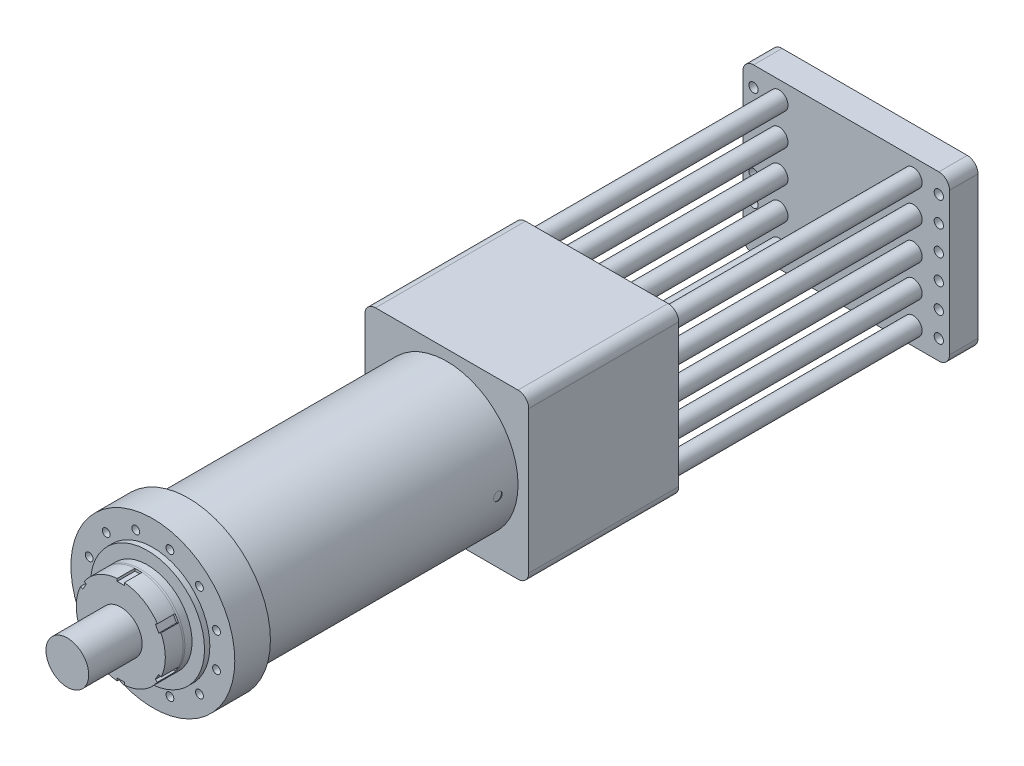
ISO-10303-21;
HEADER;
FILE_DESCRIPTION(('STEP AP214'),'2;1');
FILE_NAME('part.step','',(''),(''),'','','');
FILE_SCHEMA(('AUTOMOTIVE_DESIGN { 1 0 10303 214 1 1 1 1 }'));
ENDSEC;
DATA;
#1=APPLICATION_CONTEXT('core data for automotive mechanical design processes');
#2=APPLICATION_PROTOCOL_DEFINITION('international standard','automotive_design',2000,#1);
#3=PRODUCT_CONTEXT('',#1,'mechanical');
#4=PRODUCT('Part','Part','',(#3));
#5=PRODUCT_RELATED_PRODUCT_CATEGORY('part','',(#4));
#6=PRODUCT_DEFINITION_FORMATION('','',#4);
#7=PRODUCT_DEFINITION_CONTEXT('part definition',#1,'design');
#8=PRODUCT_DEFINITION('design','',#6,#7);
#9=PRODUCT_DEFINITION_SHAPE('','',#8);
#10=(LENGTH_UNIT() NAMED_UNIT(*) SI_UNIT(.MILLI.,.METRE.));
#11=(NAMED_UNIT(*) PLANE_ANGLE_UNIT() SI_UNIT($,.RADIAN.));
#12=(NAMED_UNIT(*) SI_UNIT($,.STERADIAN.) SOLID_ANGLE_UNIT());
#13=UNCERTAINTY_MEASURE_WITH_UNIT(LENGTH_MEASURE(1.E-05),#10,'distance_accuracy_value','');
#14=(GEOMETRIC_REPRESENTATION_CONTEXT(3) GLOBAL_UNCERTAINTY_ASSIGNED_CONTEXT((#13)) GLOBAL_UNIT_ASSIGNED_CONTEXT((#10,
#11,#12)) REPRESENTATION_CONTEXT('',''));
#15=CARTESIAN_POINT('',(0.,0.,0.));
#16=DIRECTION('',(0.,0.,1.));
#17=DIRECTION('',(1.,0.,0.));
#18=AXIS2_PLACEMENT_3D('',#15,#16,#17);
#19=CARTESIAN_POINT('',(0.,0.,865.));
#20=DIRECTION('',(0.,0.,1.));
#21=DIRECTION('',(1.,0.,0.));
#22=AXIS2_PLACEMENT_3D('',#19,#20,#21);
#23=PLANE('',#22);
#24=DIRECTION('',(0.866025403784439,-0.5,0.));
#25=VECTOR('',#24,1.);
#26=CARTESIAN_POINT('',(112.906209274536,-53.6394249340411,865.));
#27=LINE('',#26,#25);
#28=CARTESIAN_POINT('',(106.757984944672,-50.0897459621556,865.));
#29=VERTEX_POINT('',#28);
#30=CARTESIAN_POINT('',(112.140218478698,-53.1971799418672,865.));
#31=VERTEX_POINT('',#30);
#32=EDGE_CURVE('E359',#29,#31,#27,.T.);
#33=ORIENTED_EDGE('',*,*,#32,.F.);
#34=DIRECTION('',(0.5,0.866025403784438,0.));
#35=VECTOR('',#34,1.);
#36=CARTESIAN_POINT('',(106.757984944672,-50.0897459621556,865.));
#37=LINE('',#36,#35);
#38=CARTESIAN_POINT('',(96.7579849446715,-67.4102540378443,865.));
#39=VERTEX_POINT('',#38);
#40=EDGE_CURVE('E696',#39,#29,#37,.T.);
#41=ORIENTED_EDGE('',*,*,#40,.F.);
#42=DIRECTION('',(-0.866025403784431,0.500000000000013,0.));
#43=VECTOR('',#42,1.);
#44=CARTESIAN_POINT('',(96.7579849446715,-67.4102540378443,865.));
#45=LINE('',#44,#43);
#46=CARTESIAN_POINT('',(102.140218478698,-70.5176880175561,865.));
#47=VERTEX_POINT('',#46);
#48=EDGE_CURVE('E896',#47,#39,#45,.T.);
#49=ORIENTED_EDGE('',*,*,#48,.F.);
#50=CARTESIAN_POINT('',(0.,0.,865.));
#51=DIRECTION('',(0.,0.,1.));
#52=DIRECTION('',(1.,0.,0.));
#53=AXIS2_PLACEMENT_3D('',#50,#51,#52);
#54=CIRCLE('',#53,124.118365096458);
#55=EDGE_CURVE('E699',#47,#31,#54,.T.);
#56=ORIENTED_EDGE('',*,*,#55,.T.);
#57=EDGE_LOOP('',(#33,#41,#49,#56));
#58=FACE_BOUND('',#57,.T.);
#59=ADVANCED_FACE('F39',(#58),#23,.T.);
#60=DIRECTION('',(0.,-1.,0.));
#61=VECTOR('',#60,1.);
#62=CARTESIAN_POINT('',(10.,-124.599357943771,865.));
#63=LINE('',#62,#61);
#64=CARTESIAN_POINT('',(10.,-117.5,865.));
#65=VERTEX_POINT('',#64);
#66=CARTESIAN_POINT('',(10.,-123.714867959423,865.));
#67=VERTEX_POINT('',#66);
#68=EDGE_CURVE('E887',#65,#67,#63,.T.);
#69=ORIENTED_EDGE('',*,*,#68,.F.);
#70=DIRECTION('',(1.,0.,0.));
#71=VECTOR('',#70,1.);
#72=CARTESIAN_POINT('',(10.,-117.5,865.));
#73=LINE('',#72,#71);
#74=CARTESIAN_POINT('',(-9.99999999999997,-117.5,865.));
#75=VERTEX_POINT('',#74);
#76=EDGE_CURVE('E881',#75,#65,#73,.T.);
#77=ORIENTED_EDGE('',*,*,#76,.F.);
#78=DIRECTION('',(0.,1.,0.));
#79=VECTOR('',#78,1.);
#80=CARTESIAN_POINT('',(-9.99999999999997,-117.5,865.));
#81=LINE('',#80,#79);
#82=CARTESIAN_POINT('',(-10.0000000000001,-123.714867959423,865.));
#83=VERTEX_POINT('',#82);
#84=EDGE_CURVE('E882',#83,#75,#81,.T.);
#85=ORIENTED_EDGE('',*,*,#84,.F.);
#86=EDGE_CURVE('E1605',#83,#67,#54,.T.);
#87=ORIENTED_EDGE('',*,*,#86,.T.);
#88=EDGE_LOOP('',(#69,#77,#85,#87));
#89=FACE_BOUND('',#88,.T.);
#90=ADVANCED_FACE('F686',(#89),#23,.T.);
#91=DIRECTION('',(-0.866025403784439,-0.5,0.));
#92=VECTOR('',#91,1.);
#93=CARTESIAN_POINT('',(-102.906209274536,-70.95993300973,865.));
#94=LINE('',#93,#92);
#95=CARTESIAN_POINT('',(-96.7579849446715,-67.4102540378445,865.));
#96=VERTEX_POINT('',#95);
#97=CARTESIAN_POINT('',(-102.140218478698,-70.5176880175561,865.));
#98=VERTEX_POINT('',#97);
#99=EDGE_CURVE('E870',#96,#98,#94,.T.);
#100=ORIENTED_EDGE('',*,*,#99,.F.);
#101=DIRECTION('',(0.5,-0.866025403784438,0.));
#102=VECTOR('',#101,1.);
#103=CARTESIAN_POINT('',(-96.7579849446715,-67.4102540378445,865.));
#104=LINE('',#103,#102);
#105=CARTESIAN_POINT('',(-106.757984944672,-50.0897459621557,865.));
#106=VERTEX_POINT('',#105);
#107=EDGE_CURVE('E864',#106,#96,#104,.T.);
#108=ORIENTED_EDGE('',*,*,#107,.F.);
#109=DIRECTION('',(0.866025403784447,0.499999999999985,0.));
#110=VECTOR('',#109,1.);
#111=CARTESIAN_POINT('',(-106.757984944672,-50.0897459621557,865.));
#112=LINE('',#111,#110);
#113=CARTESIAN_POINT('',(-112.140218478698,-53.1971799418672,865.));
#114=VERTEX_POINT('',#113);
#115=EDGE_CURVE('E865',#114,#106,#112,.T.);
#116=ORIENTED_EDGE('',*,*,#115,.F.);
#117=EDGE_CURVE('E1613',#114,#98,#54,.T.);
#118=ORIENTED_EDGE('',*,*,#117,.T.);
#119=EDGE_LOOP('',(#100,#108,#116,#118));
#120=FACE_BOUND('',#119,.T.);
#121=ADVANCED_FACE('F691',(#120),#23,.T.);
#122=DIRECTION('',(-0.86602540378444,0.499999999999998,0.));
#123=VECTOR('',#122,1.);
#124=CARTESIAN_POINT('',(-112.906209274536,53.6394249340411,865.));
#125=LINE('',#124,#123);
#126=CARTESIAN_POINT('',(-106.757984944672,50.0897459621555,865.));
#127=VERTEX_POINT('',#126);
#128=CARTESIAN_POINT('',(-112.140218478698,53.1971799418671,865.));
#129=VERTEX_POINT('',#128);
#130=EDGE_CURVE('E853',#127,#129,#125,.T.);
#131=ORIENTED_EDGE('',*,*,#130,.F.);
#132=DIRECTION('',(-0.500000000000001,-0.866025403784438,0.));
#133=VECTOR('',#132,1.);
#134=CARTESIAN_POINT('',(-106.757984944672,50.0897459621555,865.));
#135=LINE('',#134,#133);
#136=CARTESIAN_POINT('',(-96.7579849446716,67.4102540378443,865.));
#137=VERTEX_POINT('',#136);
#138=EDGE_CURVE('E847',#137,#127,#135,.T.);
#139=ORIENTED_EDGE('',*,*,#138,.F.);
#140=DIRECTION('',(0.866025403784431,-0.500000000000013,0.));
#141=VECTOR('',#140,1.);
#142=CARTESIAN_POINT('',(-96.7579849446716,67.4102540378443,865.));
#143=LINE('',#142,#141);
#144=CARTESIAN_POINT('',(-102.140218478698,70.517688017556,865.));
#145=VERTEX_POINT('',#144);
#146=EDGE_CURVE('E848',#145,#137,#143,.T.);
#147=ORIENTED_EDGE('',*,*,#146,.F.);
#148=EDGE_CURVE('E1624',#145,#129,#54,.T.);
#149=ORIENTED_EDGE('',*,*,#148,.T.);
#150=EDGE_LOOP('',(#131,#139,#147,#149));
#151=FACE_BOUND('',#150,.T.);
#152=ADVANCED_FACE('F962',(#151),#23,.T.);
#153=DIRECTION('',(0.,1.,0.));
#154=VECTOR('',#153,1.);
#155=CARTESIAN_POINT('',(-10.,124.599357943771,865.));
#156=LINE('',#155,#154);
#157=CARTESIAN_POINT('',(-10.,117.5,865.));
#158=VERTEX_POINT('',#157);
#159=CARTESIAN_POINT('',(-10.,123.714867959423,865.));
#160=VERTEX_POINT('',#159);
#161=EDGE_CURVE('E836',#158,#160,#156,.T.);
#162=ORIENTED_EDGE('',*,*,#161,.F.);
#163=DIRECTION('',(-1.,0.,0.));
#164=VECTOR('',#163,1.);
#165=CARTESIAN_POINT('',(-10.,117.5,865.));
#166=LINE('',#165,#164);
#167=CARTESIAN_POINT('',(9.99999999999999,117.5,865.));
#168=VERTEX_POINT('',#167);
#169=EDGE_CURVE('E830',#168,#158,#166,.T.);
#170=ORIENTED_EDGE('',*,*,#169,.F.);
#171=DIRECTION('',(0.,-1.,0.));
#172=VECTOR('',#171,1.);
#173=CARTESIAN_POINT('',(9.99999999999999,117.5,865.));
#174=LINE('',#173,#172);
#175=CARTESIAN_POINT('',(9.99999999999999,123.714867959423,865.));
#176=VERTEX_POINT('',#175);
#177=EDGE_CURVE('E831',#176,#168,#174,.T.);
#178=ORIENTED_EDGE('',*,*,#177,.F.);
#179=EDGE_CURVE('E1635',#176,#160,#54,.T.);
#180=ORIENTED_EDGE('',*,*,#179,.T.);
#181=EDGE_LOOP('',(#162,#170,#178,#180));
#182=FACE_BOUND('',#181,.T.);
#183=ADVANCED_FACE('F601',(#182),#23,.T.);
#184=CARTESIAN_POINT('',(0.,0.,725.));
#185=DIRECTION('',(0.,0.,-1.));
#186=DIRECTION('',(-1.,0.,0.));
#187=AXIS2_PLACEMENT_3D('',#184,#185,#186);
#188=CYLINDRICAL_SURFACE('',#187,200.);
#189=CARTESIAN_POINT('',(200.,0.,44.5));
#190=CARTESIAN_POINT('',(200.000000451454,-0.336818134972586,44.4999972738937));
#191=CARTESIAN_POINT('',(199.999147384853,-0.673592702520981,44.5141864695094));
#192=CARTESIAN_POINT('',(199.995759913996,-1.34485594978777,44.5708419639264));
#193=CARTESIAN_POINT('',(199.993225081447,-1.67934402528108,44.6133154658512));
#194=CARTESIAN_POINT('',(199.986541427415,-2.34388649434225,44.7263038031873));
#195=CARTESIAN_POINT('',(199.982390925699,-2.67393590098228,44.7968478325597));
#196=CARTESIAN_POINT('',(199.97259396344,-3.32690256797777,44.9654685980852));
#197=CARTESIAN_POINT('',(199.966947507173,-3.64981984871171,45.063545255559));
#198=CARTESIAN_POINT('',(199.95432206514,-4.28605714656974,45.2864689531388));
#199=CARTESIAN_POINT('',(199.947343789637,-4.59938217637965,45.411301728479));
#200=CARTESIAN_POINT('',(199.932250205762,-5.21439925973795,45.6868788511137));
#201=CARTESIAN_POINT('',(199.92413488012,-5.51609113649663,45.837623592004));
#202=CARTESIAN_POINT('',(199.906998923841,-6.10563167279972,46.1639107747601));
#203=CARTESIAN_POINT('',(199.897978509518,-6.39348361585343,46.3394472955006));
#204=CARTESIAN_POINT('',(199.879285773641,-6.95338726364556,46.7140984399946));
#205=CARTESIAN_POINT('',(199.869613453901,-7.22543901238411,46.9132129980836));
#206=CARTESIAN_POINT('',(199.84987810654,-7.75214646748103,47.3338690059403));
#207=CARTESIAN_POINT('',(199.839814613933,-8.00678041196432,47.555437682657));
#208=CARTESIAN_POINT('',(199.819593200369,-8.49648428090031,48.0192286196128));
#209=CARTESIAN_POINT('',(199.809435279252,-8.73155417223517,48.2614509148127));
#210=CARTESIAN_POINT('',(199.789312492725,-9.18047473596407,48.7648450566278));
#211=CARTESIAN_POINT('',(199.779347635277,-9.39432453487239,49.0260176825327));
#212=CARTESIAN_POINT('',(199.759894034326,-9.79927768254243,49.5654558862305));
#213=CARTESIAN_POINT('',(199.750405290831,-9.99038103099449,49.8437214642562));
#214=CARTESIAN_POINT('',(199.732166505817,-10.3486167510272,50.4155890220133));
#215=CARTESIAN_POINT('',(199.723417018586,-10.5157312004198,50.7092022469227));
#216=CARTESIAN_POINT('',(199.706913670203,-10.8246278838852,51.3094920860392));
#217=CARTESIAN_POINT('',(199.699159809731,-10.9664101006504,51.6161687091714));
#218=CARTESIAN_POINT('',(199.684868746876,-11.2236267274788,52.2404038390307));
#219=CARTESIAN_POINT('',(199.678331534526,-11.3390613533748,52.5579622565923));
#220=CARTESIAN_POINT('',(199.666660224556,-11.5427558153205,53.2017032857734));
#221=CARTESIAN_POINT('',(199.661526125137,-11.631015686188,53.5278858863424));
#222=CARTESIAN_POINT('',(199.652812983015,-11.7796353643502,54.1861499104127));
#223=CARTESIAN_POINT('',(199.649232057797,-11.8400289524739,54.5182236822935));
#224=CARTESIAN_POINT('',(199.643718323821,-11.9326397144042,55.1862908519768));
#225=CARTESIAN_POINT('',(199.641785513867,-11.9648569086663,55.5222842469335));
#226=CARTESIAN_POINT('',(199.639623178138,-12.0008826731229,56.1957928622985));
#227=CARTESIAN_POINT('',(199.639393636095,-12.0046915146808,56.5333080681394));
#228=CARTESIAN_POINT('',(199.640644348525,-11.9838738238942,57.207457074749));
#229=CARTESIAN_POINT('',(199.642124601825,-11.9592473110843,57.5440908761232));
#230=CARTESIAN_POINT('',(199.646749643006,-11.881786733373,58.2136429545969));
#231=CARTESIAN_POINT('',(199.649892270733,-11.8289892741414,58.5465654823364));
#232=CARTESIAN_POINT('',(199.657751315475,-11.6955888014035,59.2067729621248));
#233=CARTESIAN_POINT('',(199.662467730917,-11.6149858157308,59.5340579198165));
#234=CARTESIAN_POINT('',(199.673340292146,-11.4265512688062,60.1806698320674));
#235=CARTESIAN_POINT('',(199.679496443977,-11.3187195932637,60.4999967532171));
#236=CARTESIAN_POINT('',(199.693073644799,-11.0765982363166,61.1284294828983));
#237=CARTESIAN_POINT('',(199.700494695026,-10.9423085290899,61.4375352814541));
#238=CARTESIAN_POINT('',(199.716396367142,-10.6481322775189,62.0435365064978));
#239=CARTESIAN_POINT('',(199.724877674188,-10.4882291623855,62.340423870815));
#240=CARTESIAN_POINT('',(199.742655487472,-10.1440259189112,62.9196760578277));
#241=CARTESIAN_POINT('',(199.75195199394,-9.95972578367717,63.2020408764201));
#242=CARTESIAN_POINT('',(199.771096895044,-9.5680341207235,63.7502561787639));
#243=CARTESIAN_POINT('',(199.780945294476,-9.36064239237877,64.0161065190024));
#244=CARTESIAN_POINT('',(199.800915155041,-8.92423659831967,64.529413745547));
#245=CARTESIAN_POINT('',(199.811036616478,-8.69522250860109,64.7768706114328));
#246=CARTESIAN_POINT('',(199.831282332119,-8.2168118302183,65.2520193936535));
#247=CARTESIAN_POINT('',(199.841406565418,-7.96738357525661,65.4796794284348));
#248=CARTESIAN_POINT('',(199.861354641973,-7.45022594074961,65.9131810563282));
#249=CARTESIAN_POINT('',(199.871178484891,-7.18249654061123,66.1190226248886));
#250=CARTESIAN_POINT('',(199.890247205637,-6.63063236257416,66.5074255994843));
#251=CARTESIAN_POINT('',(199.899492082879,-6.34649756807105,66.6899869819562));
#252=CARTESIAN_POINT('',(199.917140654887,-5.76383629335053,67.0305297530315));
#253=CARTESIAN_POINT('',(199.92554435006,-5.46530982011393,67.1885111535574));
#254=CARTESIAN_POINT('',(199.94127250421,-4.85596814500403,67.4787734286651));
#255=CARTESIAN_POINT('',(199.94859691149,-4.54515235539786,67.6110530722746));
#256=CARTESIAN_POINT('',(199.961958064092,-3.91345386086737,67.8489554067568));
#257=CARTESIAN_POINT('',(199.967994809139,-3.5925711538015,67.9545780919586));
#258=CARTESIAN_POINT('',(199.978609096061,-2.94302558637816,68.138407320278));
#259=CARTESIAN_POINT('',(199.983186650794,-2.61436279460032,68.2166141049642));
#260=CARTESIAN_POINT('',(199.990752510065,-1.95159736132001,68.3450498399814));
#261=CARTESIAN_POINT('',(199.993740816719,-1.61749472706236,68.3952788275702));
#262=CARTESIAN_POINT('',(199.998039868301,-0.946756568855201,68.467340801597));
#263=CARTESIAN_POINT('',(199.999353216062,-0.610125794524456,68.489217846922));
#264=CARTESIAN_POINT('',(200.000273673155,0.0637847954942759,68.5045628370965));
#265=CARTESIAN_POINT('',(199.999880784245,0.40106461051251,68.4980308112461));
#266=CARTESIAN_POINT('',(199.997399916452,1.07386998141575,68.4566048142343));
#267=CARTESIAN_POINT('',(199.995311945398,1.4093955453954,68.4217109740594));
#268=CARTESIAN_POINT('',(199.98950012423,2.07630576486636,68.3238125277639));
#269=CARTESIAN_POINT('',(199.985776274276,2.4076904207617,68.2608079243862));
#270=CARTESIAN_POINT('',(199.976801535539,3.06372180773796,68.1071968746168));
#271=CARTESIAN_POINT('',(199.971551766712,3.38837329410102,68.0166106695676));
#272=CARTESIAN_POINT('',(199.959672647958,4.02888618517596,67.8084689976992));
#273=CARTESIAN_POINT('',(199.953043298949,4.34474759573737,67.6909135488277));
#274=CARTESIAN_POINT('',(199.938592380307,4.96544648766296,67.4296715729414));
#275=CARTESIAN_POINT('',(199.930770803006,5.27028389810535,67.2859848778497));
#276=CARTESIAN_POINT('',(199.914156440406,5.86677844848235,66.973503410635));
#277=CARTESIAN_POINT('',(199.905363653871,6.15843557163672,66.8047086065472));
#278=CARTESIAN_POINT('',(199.887043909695,6.72686049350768,66.4429862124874));
#279=CARTESIAN_POINT('',(199.877516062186,7.00360953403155,66.2500291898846));
#280=CARTESIAN_POINT('',(199.85800533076,7.53987480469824,65.8415150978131));
#281=CARTESIAN_POINT('',(199.84802244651,7.79939102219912,65.6259580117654));
#282=CARTESIAN_POINT('',(199.827884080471,8.29935868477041,65.1737683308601));
#283=CARTESIAN_POINT('',(199.817728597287,8.53980997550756,64.9371355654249));
#284=CARTESIAN_POINT('',(199.797532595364,8.99994549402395,64.4444693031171));
#285=CARTESIAN_POINT('',(199.787492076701,9.21962970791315,64.1884357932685));
#286=CARTESIAN_POINT('',(199.767797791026,9.63694312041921,63.6584379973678));
#287=CARTESIAN_POINT('',(199.758144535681,9.83454371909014,63.3844511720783));
#288=CARTESIAN_POINT('',(199.739512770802,10.205960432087,62.8207823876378));
#289=CARTESIAN_POINT('',(199.730534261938,10.3797765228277,62.5311004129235));
#290=CARTESIAN_POINT('',(199.713507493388,10.7023843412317,61.9380971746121));
#291=CARTESIAN_POINT('',(199.70545922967,10.8511761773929,61.6347759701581));
#292=CARTESIAN_POINT('',(199.690522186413,11.1226725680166,61.0166473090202));
#293=CARTESIAN_POINT('',(199.683633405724,11.245377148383,60.7018398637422));
#294=CARTESIAN_POINT('',(199.671215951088,11.463746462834,60.0631910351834));
#295=CARTESIAN_POINT('',(199.665686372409,11.5594291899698,59.7393558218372));
#296=CARTESIAN_POINT('',(199.656139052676,11.7231767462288,59.0847544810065));
#297=CARTESIAN_POINT('',(199.652121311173,11.7912415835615,58.7539883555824));
#298=CARTESIAN_POINT('',(199.645712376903,11.8992631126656,58.0878845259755));
#299=CARTESIAN_POINT('',(199.643321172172,11.9392200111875,57.7525468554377));
#300=CARTESIAN_POINT('',(199.640233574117,11.99073839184,57.079689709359));
#301=CARTESIAN_POINT('',(199.639537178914,12.0022999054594,56.7421702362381));
#302=CARTESIAN_POINT('',(199.639858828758,11.9969484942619,56.0678915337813));
#303=CARTESIAN_POINT('',(199.640874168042,11.9800805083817,55.731131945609));
#304=CARTESIAN_POINT('',(199.644585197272,11.9180771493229,55.0602348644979));
#305=CARTESIAN_POINT('',(199.647280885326,11.8729418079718,54.7260973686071));
#306=CARTESIAN_POINT('',(199.654275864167,11.754727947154,54.0628194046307));
#307=CARTESIAN_POINT('',(199.658575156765,11.6816493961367,53.7336789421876));
#308=CARTESIAN_POINT('',(199.668655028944,11.5080731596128,53.0827324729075));
#309=CARTESIAN_POINT('',(199.674435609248,11.4075754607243,52.7609264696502));
#310=CARTESIAN_POINT('',(199.687313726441,11.1798805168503,52.1269324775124));
#311=CARTESIAN_POINT('',(199.694411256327,11.0526834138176,51.814744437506));
#312=CARTESIAN_POINT('',(199.709721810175,10.7724967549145,51.2021943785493));
#313=CARTESIAN_POINT('',(199.71793483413,10.6195071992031,50.901832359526));
#314=CARTESIAN_POINT('',(199.735243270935,10.2888285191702,50.3150654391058));
#315=CARTESIAN_POINT('',(199.744338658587,10.1111401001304,50.028660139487));
#316=CARTESIAN_POINT('',(199.763154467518,9.73232068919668,49.4718189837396));
#317=CARTESIAN_POINT('',(199.772874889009,9.53118968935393,49.201383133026));
#318=CARTESIAN_POINT('',(199.792680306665,9.10659722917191,48.678005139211));
#319=CARTESIAN_POINT('',(199.802765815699,8.88310351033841,48.4250891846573));
#320=CARTESIAN_POINT('',(199.823002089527,8.41561396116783,47.9389745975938));
#321=CARTESIAN_POINT('',(199.833152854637,8.17161803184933,47.7057760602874));
#322=CARTESIAN_POINT('',(199.853234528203,7.66478752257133,47.2606924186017));
#323=CARTESIAN_POINT('',(199.863165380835,7.40194822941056,47.0488126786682));
#324=CARTESIAN_POINT('',(199.882523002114,6.8593497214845,46.6479393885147));
#325=CARTESIAN_POINT('',(199.891949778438,6.57959076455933,46.4589454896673));
#326=CARTESIAN_POINT('',(199.910042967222,6.00478830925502,46.1049735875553));
#327=CARTESIAN_POINT('',(199.918708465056,5.7097270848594,45.9400243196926));
#328=CARTESIAN_POINT('',(199.935020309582,5.10672265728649,45.6355873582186));
#329=CARTESIAN_POINT('',(199.942666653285,4.79877941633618,45.4960997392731));
#330=CARTESIAN_POINT('',(199.95671533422,4.17252410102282,45.243718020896));
#331=CARTESIAN_POINT('',(199.96311897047,3.85422326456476,45.1307961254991));
#332=CARTESIAN_POINT('',(199.974509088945,3.20932132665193,44.9321958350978));
#333=CARTESIAN_POINT('',(199.979495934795,2.88272237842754,44.8465104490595));
#334=CARTESIAN_POINT('',(199.989051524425,2.13414018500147,44.6835216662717));
#335=CARTESIAN_POINT('',(199.99314188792,1.71026312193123,44.6147621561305));
#336=CARTESIAN_POINT('',(199.998615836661,0.857567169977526,44.5230030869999));
#337=CARTESIAN_POINT('',(199.999999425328,0.428748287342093,44.5000034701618));
#338=CARTESIAN_POINT('',(200.,0.,44.5));
#339=B_SPLINE_CURVE_WITH_KNOTS('',3,(#189,#190,#191,#192,#193,#194,#195,#196,#197,#198,#199,
#200,#201,#202,#203,#204,#205,#206,#207,#208,#209,#210,#211,#212,#213,#214,#215,#216,#217,#218,
#219,#220,#221,#222,#223,#224,#225,#226,#227,#228,#229,#230,#231,#232,#233,#234,#235,#236,#237,
#238,#239,#240,#241,#242,#243,#244,#245,#246,#247,#248,#249,#250,#251,#252,#253,#254,#255,#256,
#257,#258,#259,#260,#261,#262,#263,#264,#265,#266,#267,#268,#269,#270,#271,#272,#273,#274,#275,
#276,#277,#278,#279,#280,#281,#282,#283,#284,#285,#286,#287,#288,#289,#290,#291,#292,#293,#294,
#295,#296,#297,#298,#299,#300,#301,#302,#303,#304,#305,#306,#307,#308,#309,#310,#311,#312,#313,
#314,#315,#316,#317,#318,#319,#320,#321,#322,#323,#324,#325,#326,#327,#328,#329,#330,#331,#332,
#333,#334,#335,#336,#337,#338),.UNSPECIFIED.,.T.,.F.,(4,2,2,2,2,2,2,2,2,2,2,2,2,2,2,2,2,2,2,2,2,
2,2,2,2,2,2,2,2,2,2,2,2,2,2,2,2,2,2,2,2,2,2,2,2,2,2,2,2,2,2,2,2,2,2,2,2,2,2,2,2,2,2,2,2,2,2,2,2,
2,2,2,2,2,4),(0.,1.01007974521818,2.02041682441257,3.03180743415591,4.04319515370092,
5.0540449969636,6.06491019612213,7.07553437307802,8.08615573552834,9.09801754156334,
10.1098810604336,11.1217862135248,12.1336913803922,13.1463486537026,14.1590066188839,
15.171656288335,16.1843046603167,17.1957222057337,18.207139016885,19.2185461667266,
20.2299526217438,21.2400480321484,22.250142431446,23.2602410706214,24.2703406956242,
25.2810964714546,26.2918525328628,27.3026173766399,28.3133833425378,29.3257480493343,
30.3381138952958,31.350480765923,32.3628471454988,33.3752619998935,34.3876770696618,
35.4000832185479,36.4124880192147,37.4233176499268,38.4341462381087,39.444970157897,
40.4557939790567,41.4658777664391,42.4759608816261,43.4860504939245,44.4961413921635,
45.5074749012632,46.5188091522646,47.5301515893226,48.5414947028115,49.5541327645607,
50.566771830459,51.5794065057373,52.5920401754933,53.6039979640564,54.6159554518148,
55.6279054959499,56.6398544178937,57.650205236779,58.6605549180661,59.6709057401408,
60.6812570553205,61.6916029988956,62.7019489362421,63.7122660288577,64.7225834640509,
65.7343799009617,66.7461812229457,67.75823651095,68.7702763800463,69.7835159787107,
70.7967585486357,71.8089361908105,72.8208538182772,74.1066233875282,75.3923913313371),.UNSPECIFIED.);
#340=CARTESIAN_POINT('',(200.,0.,44.5));
#341=VERTEX_POINT('',#340);
#342=EDGE_CURVE('E922',#341,#341,#339,.T.);
#343=ORIENTED_EDGE('',*,*,#342,.T.);
#344=EDGE_LOOP('',(#343));
#345=FACE_BOUND('',#344,.T.);
#346=CARTESIAN_POINT('',(0.,0.,725.));
#347=DIRECTION('',(0.,0.,1.));
#348=DIRECTION('',(1.,0.,0.));
#349=AXIS2_PLACEMENT_3D('',#346,#347,#348);
#350=CIRCLE('',#349,200.);
#351=CARTESIAN_POINT('',(200.,0.,725.));
#352=VERTEX_POINT('',#351);
#353=EDGE_CURVE('E427',#352,#352,#350,.T.);
#354=ORIENTED_EDGE('',*,*,#353,.F.);
#355=EDGE_LOOP('',(#354));
#356=FACE_BOUND('',#355,.T.);
#357=CARTESIAN_POINT('',(0.,0.,0.));
#358=DIRECTION('',(0.,0.,1.));
#359=DIRECTION('',(1.,0.,0.));
#360=AXIS2_PLACEMENT_3D('',#357,#358,#359);
#361=CIRCLE('',#360,200.);
#362=CARTESIAN_POINT('',(200.,0.,0.));
#363=VERTEX_POINT('',#362);
#364=EDGE_CURVE('E399',#363,#363,#361,.T.);
#365=ORIENTED_EDGE('',*,*,#364,.T.);
#366=EDGE_LOOP('',(#365));
#367=FACE_BOUND('',#366,.T.);
#368=CARTESIAN_POINT('',(-200.,0.,682.5));
#369=CARTESIAN_POINT('',(-200.000000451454,0.336818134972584,682.500002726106));
#370=CARTESIAN_POINT('',(-199.999147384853,0.673592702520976,682.485813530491));
#371=CARTESIAN_POINT('',(-199.995759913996,1.34485594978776,682.429158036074));
#372=CARTESIAN_POINT('',(-199.993225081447,1.67934402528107,682.386684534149));
#373=CARTESIAN_POINT('',(-199.986541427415,2.34388649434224,682.273696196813));
#374=CARTESIAN_POINT('',(-199.982390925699,2.67393590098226,682.20315216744));
#375=CARTESIAN_POINT('',(-199.97259396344,3.32690256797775,682.034531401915));
#376=CARTESIAN_POINT('',(-199.966947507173,3.64981984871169,681.936454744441));
#377=CARTESIAN_POINT('',(-199.95432206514,4.28605714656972,681.713531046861));
#378=CARTESIAN_POINT('',(-199.947343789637,4.59938217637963,681.588698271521));
#379=CARTESIAN_POINT('',(-199.932250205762,5.21439925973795,681.313121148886));
#380=CARTESIAN_POINT('',(-199.92413488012,5.51609113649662,681.162376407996));
#381=CARTESIAN_POINT('',(-199.906998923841,6.10563167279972,680.83608922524));
#382=CARTESIAN_POINT('',(-199.897978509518,6.39348361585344,680.660552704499));
#383=CARTESIAN_POINT('',(-199.879285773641,6.95338726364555,680.285901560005));
#384=CARTESIAN_POINT('',(-199.869613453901,7.22543901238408,680.086787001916));
#385=CARTESIAN_POINT('',(-199.84987810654,7.752146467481,679.66613099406));
#386=CARTESIAN_POINT('',(-199.839814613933,8.00678041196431,679.444562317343));
#387=CARTESIAN_POINT('',(-199.819593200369,8.49648428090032,678.980771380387));
#388=CARTESIAN_POINT('',(-199.809435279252,8.73155417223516,678.738549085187));
#389=CARTESIAN_POINT('',(-199.789312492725,9.18047473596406,678.235154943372));
#390=CARTESIAN_POINT('',(-199.779347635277,9.39432453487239,677.973982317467));
#391=CARTESIAN_POINT('',(-199.759894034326,9.79927768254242,677.434544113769));
#392=CARTESIAN_POINT('',(-199.750405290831,9.99038103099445,677.156278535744));
#393=CARTESIAN_POINT('',(-199.732166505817,10.3486167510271,676.584410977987));
#394=CARTESIAN_POINT('',(-199.723417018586,10.5157312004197,676.290797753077));
#395=CARTESIAN_POINT('',(-199.706913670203,10.8246278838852,675.690507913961));
#396=CARTESIAN_POINT('',(-199.699159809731,10.9664101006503,675.383831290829));
#397=CARTESIAN_POINT('',(-199.684868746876,11.2236267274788,674.759596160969));
#398=CARTESIAN_POINT('',(-199.678331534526,11.3390613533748,674.442037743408));
#399=CARTESIAN_POINT('',(-199.666660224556,11.5427558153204,673.798296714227));
#400=CARTESIAN_POINT('',(-199.661526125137,11.631015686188,673.472114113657));
#401=CARTESIAN_POINT('',(-199.652812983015,11.7796353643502,672.813850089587));
#402=CARTESIAN_POINT('',(-199.649232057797,11.8400289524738,672.481776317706));
#403=CARTESIAN_POINT('',(-199.643718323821,11.9326397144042,671.813709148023));
#404=CARTESIAN_POINT('',(-199.641785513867,11.9648569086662,671.477715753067));
#405=CARTESIAN_POINT('',(-199.639623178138,12.0008826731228,670.804207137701));
#406=CARTESIAN_POINT('',(-199.639393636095,12.0046915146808,670.466691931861));
#407=CARTESIAN_POINT('',(-199.640644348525,11.9838738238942,669.792542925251));
#408=CARTESIAN_POINT('',(-199.642124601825,11.9592473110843,669.455909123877));
#409=CARTESIAN_POINT('',(-199.646749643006,11.881786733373,668.786357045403));
#410=CARTESIAN_POINT('',(-199.649892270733,11.8289892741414,668.453434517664));
#411=CARTESIAN_POINT('',(-199.657751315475,11.6955888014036,667.793227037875));
#412=CARTESIAN_POINT('',(-199.662467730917,11.6149858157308,667.465942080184));
#413=CARTESIAN_POINT('',(-199.673340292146,11.4265512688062,666.819330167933));
#414=CARTESIAN_POINT('',(-199.679496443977,11.3187195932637,666.500003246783));
#415=CARTESIAN_POINT('',(-199.693073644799,11.0765982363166,665.871570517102));
#416=CARTESIAN_POINT('',(-199.700494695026,10.9423085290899,665.562464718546));
#417=CARTESIAN_POINT('',(-199.716396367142,10.6481322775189,664.956463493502));
#418=CARTESIAN_POINT('',(-199.724877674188,10.4882291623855,664.659576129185));
#419=CARTESIAN_POINT('',(-199.742655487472,10.1440259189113,664.080323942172));
#420=CARTESIAN_POINT('',(-199.75195199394,9.95972578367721,663.79795912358));
#421=CARTESIAN_POINT('',(-199.771096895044,9.56803412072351,663.249743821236));
#422=CARTESIAN_POINT('',(-199.780945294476,9.36064239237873,662.983893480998));
#423=CARTESIAN_POINT('',(-199.800915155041,8.9242365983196,662.470586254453));
#424=CARTESIAN_POINT('',(-199.811036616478,8.69522250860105,662.223129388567));
#425=CARTESIAN_POINT('',(-199.831282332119,8.21681183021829,661.747980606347));
#426=CARTESIAN_POINT('',(-199.841406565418,7.96738357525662,661.520320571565));
#427=CARTESIAN_POINT('',(-199.861354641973,7.45022594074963,661.086818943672));
#428=CARTESIAN_POINT('',(-199.871178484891,7.18249654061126,660.880977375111));
#429=CARTESIAN_POINT('',(-199.890247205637,6.6306323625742,660.492574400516));
#430=CARTESIAN_POINT('',(-199.899492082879,6.34649756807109,660.310013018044));
#431=CARTESIAN_POINT('',(-199.917140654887,5.76383629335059,659.969470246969));
#432=CARTESIAN_POINT('',(-199.92554435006,5.46530982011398,659.811488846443));
#433=CARTESIAN_POINT('',(-199.94127250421,4.85596814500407,659.521226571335));
#434=CARTESIAN_POINT('',(-199.94859691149,4.54515235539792,659.388946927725));
#435=CARTESIAN_POINT('',(-199.961958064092,3.91345386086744,659.151044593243));
#436=CARTESIAN_POINT('',(-199.967994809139,3.59257115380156,659.045421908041));
#437=CARTESIAN_POINT('',(-199.978609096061,2.9430255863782,658.861592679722));
#438=CARTESIAN_POINT('',(-199.983186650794,2.61436279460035,658.783385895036));
#439=CARTESIAN_POINT('',(-199.990752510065,1.95159736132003,658.654950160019));
#440=CARTESIAN_POINT('',(-199.993740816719,1.61749472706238,658.60472117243));
#441=CARTESIAN_POINT('',(-199.998039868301,0.946756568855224,658.532659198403));
#442=CARTESIAN_POINT('',(-199.999353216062,0.610125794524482,658.510782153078));
#443=CARTESIAN_POINT('',(-200.000273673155,-0.0637847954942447,658.495437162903));
#444=CARTESIAN_POINT('',(-199.999880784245,-0.401064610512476,658.501969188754));
#445=CARTESIAN_POINT('',(-199.997399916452,-1.07386998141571,658.543395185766));
#446=CARTESIAN_POINT('',(-199.995311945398,-1.40939554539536,658.578289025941));
#447=CARTESIAN_POINT('',(-199.98950012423,-2.07630576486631,658.676187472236));
#448=CARTESIAN_POINT('',(-199.985776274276,-2.40769042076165,658.739192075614));
#449=CARTESIAN_POINT('',(-199.976801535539,-3.06372180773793,658.892803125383));
#450=CARTESIAN_POINT('',(-199.971551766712,-3.38837329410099,658.983389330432));
#451=CARTESIAN_POINT('',(-199.959672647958,-4.02888618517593,659.191531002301));
#452=CARTESIAN_POINT('',(-199.953043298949,-4.34474759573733,659.309086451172));
#453=CARTESIAN_POINT('',(-199.938592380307,-4.96544648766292,659.570328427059));
#454=CARTESIAN_POINT('',(-199.930770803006,-5.27028389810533,659.71401512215));
#455=CARTESIAN_POINT('',(-199.914156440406,-5.86677844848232,660.026496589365));
#456=CARTESIAN_POINT('',(-199.905363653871,-6.15843557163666,660.195291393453));
#457=CARTESIAN_POINT('',(-199.887043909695,-6.7268604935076,660.557013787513));
#458=CARTESIAN_POINT('',(-199.877516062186,-7.00360953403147,660.749970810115));
#459=CARTESIAN_POINT('',(-199.85800533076,-7.53987480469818,661.158484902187));
#460=CARTESIAN_POINT('',(-199.84802244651,-7.79939102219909,661.374041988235));
#461=CARTESIAN_POINT('',(-199.827884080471,-8.29935868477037,661.82623166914));
#462=CARTESIAN_POINT('',(-199.817728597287,-8.53980997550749,662.062864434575));
#463=CARTESIAN_POINT('',(-199.797532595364,-8.9999454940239,662.555530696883));
#464=CARTESIAN_POINT('',(-199.787492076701,-9.21962970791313,662.811564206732));
#465=CARTESIAN_POINT('',(-199.767797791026,-9.63694312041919,663.341562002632));
#466=CARTESIAN_POINT('',(-199.758144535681,-9.8345437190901,663.615548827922));
#467=CARTESIAN_POINT('',(-199.739512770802,-10.205960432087,664.179217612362));
#468=CARTESIAN_POINT('',(-199.730534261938,-10.3797765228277,664.468899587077));
#469=CARTESIAN_POINT('',(-199.713507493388,-10.7023843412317,665.061902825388));
#470=CARTESIAN_POINT('',(-199.70545922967,-10.8511761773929,665.365224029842));
#471=CARTESIAN_POINT('',(-199.690522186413,-11.1226725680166,665.98335269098));
#472=CARTESIAN_POINT('',(-199.683633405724,-11.245377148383,666.298160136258));
#473=CARTESIAN_POINT('',(-199.671215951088,-11.4637464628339,666.936808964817));
#474=CARTESIAN_POINT('',(-199.665686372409,-11.5594291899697,667.260644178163));
#475=CARTESIAN_POINT('',(-199.656139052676,-11.7231767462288,667.915245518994));
#476=CARTESIAN_POINT('',(-199.652121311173,-11.7912415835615,668.246011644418));
#477=CARTESIAN_POINT('',(-199.645712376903,-11.8992631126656,668.912115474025));
#478=CARTESIAN_POINT('',(-199.643321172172,-11.9392200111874,669.247453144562));
#479=CARTESIAN_POINT('',(-199.640233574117,-11.99073839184,669.920310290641));
#480=CARTESIAN_POINT('',(-199.639537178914,-12.0022999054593,670.257829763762));
#481=CARTESIAN_POINT('',(-199.639858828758,-11.9969484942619,670.932108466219));
#482=CARTESIAN_POINT('',(-199.640874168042,-11.9800805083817,671.268868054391));
#483=CARTESIAN_POINT('',(-199.644585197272,-11.9180771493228,671.939765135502));
#484=CARTESIAN_POINT('',(-199.647280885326,-11.8729418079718,672.273902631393));
#485=CARTESIAN_POINT('',(-199.654275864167,-11.754727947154,672.937180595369));
#486=CARTESIAN_POINT('',(-199.658575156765,-11.6816493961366,673.266321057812));
#487=CARTESIAN_POINT('',(-199.668655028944,-11.5080731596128,673.917267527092));
#488=CARTESIAN_POINT('',(-199.674435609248,-11.4075754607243,674.23907353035));
#489=CARTESIAN_POINT('',(-199.687313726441,-11.1798805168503,674.873067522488));
#490=CARTESIAN_POINT('',(-199.694411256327,-11.0526834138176,675.185255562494));
#491=CARTESIAN_POINT('',(-199.709721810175,-10.7724967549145,675.797805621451));
#492=CARTESIAN_POINT('',(-199.71793483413,-10.6195071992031,676.098167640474));
#493=CARTESIAN_POINT('',(-199.735243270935,-10.2888285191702,676.684934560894));
#494=CARTESIAN_POINT('',(-199.744338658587,-10.1111401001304,676.971339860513));
#495=CARTESIAN_POINT('',(-199.763154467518,-9.73232068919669,677.52818101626));
#496=CARTESIAN_POINT('',(-199.772874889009,-9.53118968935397,677.798616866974));
#497=CARTESIAN_POINT('',(-199.792680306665,-9.10659722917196,678.321994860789));
#498=CARTESIAN_POINT('',(-199.802765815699,-8.88310351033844,678.574910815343));
#499=CARTESIAN_POINT('',(-199.823002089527,-8.41561396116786,679.061025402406));
#500=CARTESIAN_POINT('',(-199.833152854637,-8.17161803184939,679.294223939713));
#501=CARTESIAN_POINT('',(-199.853234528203,-7.66478752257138,679.739307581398));
#502=CARTESIAN_POINT('',(-199.863165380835,-7.40194822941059,679.951187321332));
#503=CARTESIAN_POINT('',(-199.882523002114,-6.8593497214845,680.352060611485));
#504=CARTESIAN_POINT('',(-199.891949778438,-6.57959076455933,680.541054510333));
#505=CARTESIAN_POINT('',(-199.910042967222,-6.00478830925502,680.895026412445));
#506=CARTESIAN_POINT('',(-199.918708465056,-5.7097270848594,681.059975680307));
#507=CARTESIAN_POINT('',(-199.935020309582,-5.10672265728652,681.364412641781));
#508=CARTESIAN_POINT('',(-199.942666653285,-4.79877941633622,681.503900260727));
#509=CARTESIAN_POINT('',(-199.95671533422,-4.17252410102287,681.756281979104));
#510=CARTESIAN_POINT('',(-199.96311897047,-3.85422326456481,681.869203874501));
#511=CARTESIAN_POINT('',(-199.974509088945,-3.20932132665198,682.067804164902));
#512=CARTESIAN_POINT('',(-199.979495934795,-2.8827223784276,682.15348955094));
#513=CARTESIAN_POINT('',(-199.989051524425,-2.13414018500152,682.316478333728));
#514=CARTESIAN_POINT('',(-199.99314188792,-1.71026312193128,682.38523784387));
#515=CARTESIAN_POINT('',(-199.998615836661,-0.857567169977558,682.476996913));
#516=CARTESIAN_POINT('',(-199.999999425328,-0.428748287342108,682.499996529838));
#517=CARTESIAN_POINT('',(-200.,0.,682.5));
#518=B_SPLINE_CURVE_WITH_KNOTS('',3,(#368,#369,#370,#371,#372,#373,#374,#375,#376,#377,#378,
#379,#380,#381,#382,#383,#384,#385,#386,#387,#388,#389,#390,#391,#392,#393,#394,#395,#396,#397,
#398,#399,#400,#401,#402,#403,#404,#405,#406,#407,#408,#409,#410,#411,#412,#413,#414,#415,#416,
#417,#418,#419,#420,#421,#422,#423,#424,#425,#426,#427,#428,#429,#430,#431,#432,#433,#434,#435,
#436,#437,#438,#439,#440,#441,#442,#443,#444,#445,#446,#447,#448,#449,#450,#451,#452,#453,#454,
#455,#456,#457,#458,#459,#460,#461,#462,#463,#464,#465,#466,#467,#468,#469,#470,#471,#472,#473,
#474,#475,#476,#477,#478,#479,#480,#481,#482,#483,#484,#485,#486,#487,#488,#489,#490,#491,#492,
#493,#494,#495,#496,#497,#498,#499,#500,#501,#502,#503,#504,#505,#506,#507,#508,#509,#510,#511,
#512,#513,#514,#515,#516,#517),.UNSPECIFIED.,.T.,.F.,(4,2,2,2,2,2,2,2,2,2,2,2,2,2,2,2,2,2,2,2,2,
2,2,2,2,2,2,2,2,2,2,2,2,2,2,2,2,2,2,2,2,2,2,2,2,2,2,2,2,2,2,2,2,2,2,2,2,2,2,2,2,2,2,2,2,2,2,2,2,
2,2,2,2,2,4),(0.,1.01007974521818,2.02041682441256,3.03180743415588,4.0431951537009,
5.05404499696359,6.06491019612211,7.07553437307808,8.08615573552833,9.09801754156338,
10.1098810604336,11.1217862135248,12.1336913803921,13.1463486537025,14.1590066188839,
15.1716562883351,16.1843046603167,17.1957222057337,18.207139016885,19.2185461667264,
20.2299526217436,21.2400480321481,22.2501424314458,23.2602410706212,24.270340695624,
25.2810964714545,26.2918525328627,27.3026173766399,28.3133833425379,29.3257480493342,
30.3381138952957,31.3504807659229,32.3628471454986,33.3752619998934,34.3876770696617,
35.4000832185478,36.4124880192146,37.4233176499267,38.4341462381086,39.4449701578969,
40.4557939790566,41.465877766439,42.475960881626,43.4860504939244,44.4961413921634,
45.507474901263,46.5188091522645,47.5301515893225,48.5414947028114,49.5541327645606,
50.5667718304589,51.5794065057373,52.5920401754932,53.6039979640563,54.6159554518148,
55.6279054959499,56.6398544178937,57.650205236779,58.660554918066,59.6709057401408,
60.6812570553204,61.6916029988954,62.701948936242,63.7122660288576,64.7225834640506,
65.7343799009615,66.7461812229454,67.7582365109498,68.7702763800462,69.7835159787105,
70.7967585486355,71.8089361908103,72.8208538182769,74.106623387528,75.392391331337),.UNSPECIFIED.);
#519=CARTESIAN_POINT('',(-200.,0.,682.5));
#520=VERTEX_POINT('',#519);
#521=EDGE_CURVE('E546',#520,#520,#518,.T.);
#522=ORIENTED_EDGE('',*,*,#521,.F.);
#523=EDGE_LOOP('',(#522));
#524=FACE_BOUND('',#523,.T.);
#525=CARTESIAN_POINT('',(-200.,0.,48.5));
#526=CARTESIAN_POINT('',(-200.000000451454,0.336818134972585,48.5000027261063));
#527=CARTESIAN_POINT('',(-199.999147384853,0.673592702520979,48.4858135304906));
#528=CARTESIAN_POINT('',(-199.995759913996,1.34485594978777,48.4291580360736));
#529=CARTESIAN_POINT('',(-199.993225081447,1.67934402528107,48.3866845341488));
#530=CARTESIAN_POINT('',(-199.986541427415,2.34388649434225,48.2736961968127));
#531=CARTESIAN_POINT('',(-199.982390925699,2.67393590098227,48.2031521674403));
#532=CARTESIAN_POINT('',(-199.97259396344,3.32690256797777,48.0345314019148));
#533=CARTESIAN_POINT('',(-199.966947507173,3.64981984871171,47.936454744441));
#534=CARTESIAN_POINT('',(-199.95432206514,4.28605714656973,47.7135310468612));
#535=CARTESIAN_POINT('',(-199.947343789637,4.59938217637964,47.588698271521));
#536=CARTESIAN_POINT('',(-199.932250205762,5.21439925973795,47.3131211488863));
#537=CARTESIAN_POINT('',(-199.92413488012,5.51609113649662,47.162376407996));
#538=CARTESIAN_POINT('',(-199.906998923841,6.10563167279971,46.8360892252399));
#539=CARTESIAN_POINT('',(-199.897978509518,6.39348361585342,46.6605527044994));
#540=CARTESIAN_POINT('',(-199.879285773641,6.95338726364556,46.2859015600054));
#541=CARTESIAN_POINT('',(-199.869613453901,7.22543901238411,46.0867870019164));
#542=CARTESIAN_POINT('',(-199.84987810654,7.75214646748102,45.6661309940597));
#543=CARTESIAN_POINT('',(-199.839814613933,8.00678041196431,45.4445623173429));
#544=CARTESIAN_POINT('',(-199.819593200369,8.4964842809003,44.9807713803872));
#545=CARTESIAN_POINT('',(-199.809435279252,8.73155417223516,44.7385490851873));
#546=CARTESIAN_POINT('',(-199.789312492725,9.18047473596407,44.2351549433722));
#547=CARTESIAN_POINT('',(-199.779347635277,9.39432453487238,43.9739823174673));
#548=CARTESIAN_POINT('',(-199.759894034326,9.79927768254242,43.4345441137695));
#549=CARTESIAN_POINT('',(-199.750405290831,9.99038103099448,43.1562785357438));
#550=CARTESIAN_POINT('',(-199.732166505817,10.3486167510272,42.5844109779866));
#551=CARTESIAN_POINT('',(-199.723417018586,10.5157312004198,42.2907977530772));
#552=CARTESIAN_POINT('',(-199.706913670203,10.8246278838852,41.6905079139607));
#553=CARTESIAN_POINT('',(-199.699159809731,10.9664101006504,41.3838312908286));
#554=CARTESIAN_POINT('',(-199.684868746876,11.2236267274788,40.7595961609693));
#555=CARTESIAN_POINT('',(-199.678331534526,11.3390613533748,40.4420377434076));
#556=CARTESIAN_POINT('',(-199.666660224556,11.5427558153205,39.7982967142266));
#557=CARTESIAN_POINT('',(-199.661526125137,11.631015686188,39.4721141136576));
#558=CARTESIAN_POINT('',(-199.652812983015,11.7796353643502,38.8138500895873));
#559=CARTESIAN_POINT('',(-199.649232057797,11.8400289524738,38.4817763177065));
#560=CARTESIAN_POINT('',(-199.643718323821,11.9326397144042,37.8137091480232));
#561=CARTESIAN_POINT('',(-199.641785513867,11.9648569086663,37.4777157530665));
#562=CARTESIAN_POINT('',(-199.639623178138,12.0008826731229,36.8042071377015));
#563=CARTESIAN_POINT('',(-199.639393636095,12.0046915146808,36.4666919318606));
#564=CARTESIAN_POINT('',(-199.640644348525,11.9838738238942,35.792542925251));
#565=CARTESIAN_POINT('',(-199.642124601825,11.9592473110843,35.4559091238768));
#566=CARTESIAN_POINT('',(-199.646749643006,11.881786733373,34.7863570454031));
#567=CARTESIAN_POINT('',(-199.649892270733,11.8289892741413,34.4534345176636));
#568=CARTESIAN_POINT('',(-199.657751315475,11.6955888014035,33.7932270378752));
#569=CARTESIAN_POINT('',(-199.662467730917,11.6149858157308,33.4659420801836));
#570=CARTESIAN_POINT('',(-199.673340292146,11.4265512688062,32.8193301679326));
#571=CARTESIAN_POINT('',(-199.679496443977,11.3187195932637,32.5000032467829));
#572=CARTESIAN_POINT('',(-199.693073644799,11.0765982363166,31.8715705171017));
#573=CARTESIAN_POINT('',(-199.700494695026,10.9423085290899,31.5624647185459));
#574=CARTESIAN_POINT('',(-199.716396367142,10.6481322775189,30.9564634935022));
#575=CARTESIAN_POINT('',(-199.724877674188,10.4882291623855,30.659576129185));
#576=CARTESIAN_POINT('',(-199.742655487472,10.1440259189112,30.0803239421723));
#577=CARTESIAN_POINT('',(-199.75195199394,9.95972578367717,29.7979591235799));
#578=CARTESIAN_POINT('',(-199.771096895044,9.5680341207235,29.2497438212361));
#579=CARTESIAN_POINT('',(-199.780945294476,9.36064239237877,28.9838934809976));
#580=CARTESIAN_POINT('',(-199.800915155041,8.92423659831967,28.470586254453));
#581=CARTESIAN_POINT('',(-199.811036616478,8.69522250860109,28.2231293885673));
#582=CARTESIAN_POINT('',(-199.831282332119,8.21681183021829,27.7479806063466));
#583=CARTESIAN_POINT('',(-199.841406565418,7.96738357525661,27.5203205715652));
#584=CARTESIAN_POINT('',(-199.861354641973,7.45022594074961,27.0868189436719));
#585=CARTESIAN_POINT('',(-199.871178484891,7.18249654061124,26.8809773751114));
#586=CARTESIAN_POINT('',(-199.890247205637,6.63063236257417,26.4925744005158));
#587=CARTESIAN_POINT('',(-199.899492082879,6.34649756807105,26.3100130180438));
#588=CARTESIAN_POINT('',(-199.917140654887,5.76383629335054,25.9694702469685));
#589=CARTESIAN_POINT('',(-199.92554435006,5.46530982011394,25.8114888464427));
#590=CARTESIAN_POINT('',(-199.94127250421,4.85596814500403,25.5212265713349));
#591=CARTESIAN_POINT('',(-199.94859691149,4.54515235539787,25.3889469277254));
#592=CARTESIAN_POINT('',(-199.961958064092,3.91345386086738,25.1510445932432));
#593=CARTESIAN_POINT('',(-199.967994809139,3.59257115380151,25.0454219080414));
#594=CARTESIAN_POINT('',(-199.978609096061,2.94302558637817,24.861592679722));
#595=CARTESIAN_POINT('',(-199.983186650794,2.61436279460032,24.7833858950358));
#596=CARTESIAN_POINT('',(-199.990752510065,1.95159736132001,24.6549501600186));
#597=CARTESIAN_POINT('',(-199.993740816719,1.61749472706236,24.6047211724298));
#598=CARTESIAN_POINT('',(-199.998039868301,0.946756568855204,24.532659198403));
#599=CARTESIAN_POINT('',(-199.999353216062,0.610125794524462,24.510782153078));
#600=CARTESIAN_POINT('',(-200.000273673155,-0.0637847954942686,24.4954371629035));
#601=CARTESIAN_POINT('',(-199.999880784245,-0.401064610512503,24.5019691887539));
#602=CARTESIAN_POINT('',(-199.997399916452,-1.07386998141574,24.5433951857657));
#603=CARTESIAN_POINT('',(-199.995311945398,-1.4093955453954,24.5782890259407));
#604=CARTESIAN_POINT('',(-199.98950012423,-2.07630576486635,24.6761874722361));
#605=CARTESIAN_POINT('',(-199.985776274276,-2.40769042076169,24.7391920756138));
#606=CARTESIAN_POINT('',(-199.976801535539,-3.06372180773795,24.8928031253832));
#607=CARTESIAN_POINT('',(-199.971551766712,-3.388373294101,24.9833893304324));
#608=CARTESIAN_POINT('',(-199.959672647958,-4.02888618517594,25.1915310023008));
#609=CARTESIAN_POINT('',(-199.953043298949,-4.34474759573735,25.3090864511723));
#610=CARTESIAN_POINT('',(-199.938592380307,-4.96544648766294,25.5703284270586));
#611=CARTESIAN_POINT('',(-199.930770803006,-5.27028389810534,25.7140151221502));
#612=CARTESIAN_POINT('',(-199.914156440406,-5.86677844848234,26.026496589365));
#613=CARTESIAN_POINT('',(-199.905363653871,-6.1584355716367,26.1952913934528));
#614=CARTESIAN_POINT('',(-199.887043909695,-6.72686049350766,26.5570137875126));
#615=CARTESIAN_POINT('',(-199.877516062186,-7.00360953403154,26.7499708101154));
#616=CARTESIAN_POINT('',(-199.85800533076,-7.53987480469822,27.1584849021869));
#617=CARTESIAN_POINT('',(-199.84802244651,-7.79939102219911,27.3740419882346));
#618=CARTESIAN_POINT('',(-199.827884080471,-8.29935868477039,27.8262316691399));
#619=CARTESIAN_POINT('',(-199.817728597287,-8.53980997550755,28.0628644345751));
#620=CARTESIAN_POINT('',(-199.797532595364,-8.99994549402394,28.5555306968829));
#621=CARTESIAN_POINT('',(-199.787492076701,-9.21962970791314,28.8115642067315));
#622=CARTESIAN_POINT('',(-199.767797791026,-9.63694312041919,29.3415620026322));
#623=CARTESIAN_POINT('',(-199.758144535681,-9.83454371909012,29.6155488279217));
#624=CARTESIAN_POINT('',(-199.739512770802,-10.205960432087,30.1792176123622));
#625=CARTESIAN_POINT('',(-199.730534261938,-10.3797765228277,30.4688995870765));
#626=CARTESIAN_POINT('',(-199.713507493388,-10.7023843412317,31.0619028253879));
#627=CARTESIAN_POINT('',(-199.70545922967,-10.8511761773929,31.3652240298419));
#628=CARTESIAN_POINT('',(-199.690522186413,-11.1226725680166,31.9833526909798));
#629=CARTESIAN_POINT('',(-199.683633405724,-11.245377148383,32.2981601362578));
#630=CARTESIAN_POINT('',(-199.671215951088,-11.463746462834,32.9368089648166));
#631=CARTESIAN_POINT('',(-199.665686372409,-11.5594291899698,33.2606441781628));
#632=CARTESIAN_POINT('',(-199.656139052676,-11.7231767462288,33.9152455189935));
#633=CARTESIAN_POINT('',(-199.652121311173,-11.7912415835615,34.2460116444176));
#634=CARTESIAN_POINT('',(-199.645712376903,-11.8992631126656,34.9121154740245));
#635=CARTESIAN_POINT('',(-199.643321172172,-11.9392200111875,35.2474531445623));
#636=CARTESIAN_POINT('',(-199.640233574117,-11.99073839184,35.920310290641));
#637=CARTESIAN_POINT('',(-199.639537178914,-12.0022999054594,36.2578297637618));
#638=CARTESIAN_POINT('',(-199.639858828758,-11.9969484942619,36.9321084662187));
#639=CARTESIAN_POINT('',(-199.640874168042,-11.9800805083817,37.268868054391));
#640=CARTESIAN_POINT('',(-199.644585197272,-11.9180771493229,37.9397651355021));
#641=CARTESIAN_POINT('',(-199.647280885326,-11.8729418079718,38.2739026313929));
#642=CARTESIAN_POINT('',(-199.654275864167,-11.754727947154,38.9371805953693));
#643=CARTESIAN_POINT('',(-199.658575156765,-11.6816493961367,39.2663210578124));
#644=CARTESIAN_POINT('',(-199.668655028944,-11.5080731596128,39.9172675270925));
#645=CARTESIAN_POINT('',(-199.674435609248,-11.4075754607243,40.2390735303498));
#646=CARTESIAN_POINT('',(-199.687313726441,-11.1798805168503,40.8730675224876));
#647=CARTESIAN_POINT('',(-199.694411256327,-11.0526834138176,41.185255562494));
#648=CARTESIAN_POINT('',(-199.709721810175,-10.7724967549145,41.7978056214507));
#649=CARTESIAN_POINT('',(-199.71793483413,-10.6195071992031,42.098167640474));
#650=CARTESIAN_POINT('',(-199.735243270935,-10.2888285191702,42.6849345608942));
#651=CARTESIAN_POINT('',(-199.744338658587,-10.1111401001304,42.971339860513));
#652=CARTESIAN_POINT('',(-199.763154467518,-9.73232068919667,43.5281810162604));
#653=CARTESIAN_POINT('',(-199.772874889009,-9.53118968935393,43.798616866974));
#654=CARTESIAN_POINT('',(-199.792680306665,-9.10659722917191,44.321994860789));
#655=CARTESIAN_POINT('',(-199.802765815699,-8.8831035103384,44.5749108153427));
#656=CARTESIAN_POINT('',(-199.823002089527,-8.41561396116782,45.0610254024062));
#657=CARTESIAN_POINT('',(-199.833152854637,-8.17161803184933,45.2942239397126));
#658=CARTESIAN_POINT('',(-199.853234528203,-7.66478752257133,45.7393075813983));
#659=CARTESIAN_POINT('',(-199.863165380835,-7.40194822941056,45.9511873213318));
#660=CARTESIAN_POINT('',(-199.882523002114,-6.8593497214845,46.3520606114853));
#661=CARTESIAN_POINT('',(-199.891949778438,-6.57959076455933,46.5410545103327));
#662=CARTESIAN_POINT('',(-199.910042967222,-6.00478830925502,46.8950264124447));
#663=CARTESIAN_POINT('',(-199.918708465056,-5.70972708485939,47.0599756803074));
#664=CARTESIAN_POINT('',(-199.935020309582,-5.10672265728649,47.3644126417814));
#665=CARTESIAN_POINT('',(-199.942666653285,-4.79877941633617,47.5039002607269));
#666=CARTESIAN_POINT('',(-199.95671533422,-4.17252410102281,47.756281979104));
#667=CARTESIAN_POINT('',(-199.96311897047,-3.85422326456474,47.8692038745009));
#668=CARTESIAN_POINT('',(-199.974509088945,-3.20932132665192,48.0678041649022));
#669=CARTESIAN_POINT('',(-199.979495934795,-2.88272237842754,48.1534895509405));
#670=CARTESIAN_POINT('',(-199.989051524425,-2.13414018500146,48.3164783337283));
#671=CARTESIAN_POINT('',(-199.99314188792,-1.71026312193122,48.3852378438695));
#672=CARTESIAN_POINT('',(-199.998615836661,-0.85756716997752,48.4769969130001));
#673=CARTESIAN_POINT('',(-199.999999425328,-0.42874828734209,48.4999965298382));
#674=CARTESIAN_POINT('',(-200.,0.,48.5));
#675=B_SPLINE_CURVE_WITH_KNOTS('',3,(#525,#526,#527,#528,#529,#530,#531,#532,#533,#534,#535,
#536,#537,#538,#539,#540,#541,#542,#543,#544,#545,#546,#547,#548,#549,#550,#551,#552,#553,#554,
#555,#556,#557,#558,#559,#560,#561,#562,#563,#564,#565,#566,#567,#568,#569,#570,#571,#572,#573,
#574,#575,#576,#577,#578,#579,#580,#581,#582,#583,#584,#585,#586,#587,#588,#589,#590,#591,#592,
#593,#594,#595,#596,#597,#598,#599,#600,#601,#602,#603,#604,#605,#606,#607,#608,#609,#610,#611,
#612,#613,#614,#615,#616,#617,#618,#619,#620,#621,#622,#623,#624,#625,#626,#627,#628,#629,#630,
#631,#632,#633,#634,#635,#636,#637,#638,#639,#640,#641,#642,#643,#644,#645,#646,#647,#648,#649,
#650,#651,#652,#653,#654,#655,#656,#657,#658,#659,#660,#661,#662,#663,#664,#665,#666,#667,#668,
#669,#670,#671,#672,#673,#674),.UNSPECIFIED.,.T.,.F.,(4,2,2,2,2,2,2,2,2,2,2,2,2,2,2,2,2,2,2,2,2,
2,2,2,2,2,2,2,2,2,2,2,2,2,2,2,2,2,2,2,2,2,2,2,2,2,2,2,2,2,2,2,2,2,2,2,2,2,2,2,2,2,2,2,2,2,2,2,2,
2,2,2,2,2,4),(0.,1.01007974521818,2.02041682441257,3.03180743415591,4.04319515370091,
5.05404499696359,6.06491019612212,7.07553437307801,8.08615573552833,9.09801754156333,
10.1098810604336,11.1217862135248,12.1336913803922,13.1463486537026,14.1590066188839,
15.171656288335,16.1843046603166,17.1957222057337,18.207139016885,19.2185461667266,
20.2299526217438,21.2400480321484,22.250142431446,23.2602410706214,24.2703406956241,
25.2810964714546,26.2918525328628,27.3026173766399,28.3133833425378,29.3257480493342,
30.3381138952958,31.350480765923,32.3628471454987,33.3752619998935,34.3876770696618,
35.4000832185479,36.4124880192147,37.4233176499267,38.4341462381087,39.444970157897,
40.4557939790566,41.4658777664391,42.475960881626,43.4860504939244,44.4961413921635,
45.5074749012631,46.5188091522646,47.5301515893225,48.5414947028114,49.5541327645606,
50.5667718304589,51.5794065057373,52.5920401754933,53.6039979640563,54.6159554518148,
55.6279054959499,56.6398544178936,57.6502052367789,58.660554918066,59.6709057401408,
60.6812570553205,61.6916029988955,62.7019489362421,63.7122660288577,64.7225834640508,
65.7343799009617,66.7461812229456,67.75823651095,68.7702763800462,69.7835159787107,
70.7967585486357,71.8089361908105,72.8208538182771,74.1066233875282,75.392391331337),.UNSPECIFIED.);
#676=CARTESIAN_POINT('',(-200.,0.,48.5));
#677=VERTEX_POINT('',#676);
#678=EDGE_CURVE('E555',#677,#677,#675,.T.);
#679=ORIENTED_EDGE('',*,*,#678,.F.);
#680=EDGE_LOOP('',(#679));
#681=FACE_BOUND('',#680,.T.);
#682=ADVANCED_FACE('F561',(#345,#356,#367,#524,#681),#188,.T.);
#683=CARTESIAN_POINT('',(0.,0.,725.));
#684=DIRECTION('',(0.,0.,1.));
#685=DIRECTION('',(1.,0.,0.));
#686=AXIS2_PLACEMENT_3D('',#683,#684,#685);
#687=PLANE('',#686);
#688=CARTESIAN_POINT('',(0.,0.,725.));
#689=DIRECTION('',(0.,0.,1.));
#690=DIRECTION('',(1.,0.,0.));
#691=AXIS2_PLACEMENT_3D('',#688,#689,#690);
#692=CIRCLE('',#691,230.);
#693=CARTESIAN_POINT('',(230.,0.,725.));
#694=VERTEX_POINT('',#693);
#695=EDGE_CURVE('E520',#694,#694,#692,.T.);
#696=ORIENTED_EDGE('',*,*,#695,.F.);
#697=EDGE_LOOP('',(#696));
#698=FACE_BOUND('',#697,.T.);
#699=ORIENTED_EDGE('',*,*,#353,.T.);
#700=EDGE_LOOP('',(#699));
#701=FACE_BOUND('',#700,.T.);
#702=ADVANCED_FACE('F667',(#698,#701),#687,.F.);
#703=CARTESIAN_POINT('',(0.,0.,825.));
#704=DIRECTION('',(0.,0.,1.));
#705=DIRECTION('',(1.,0.,0.));
#706=AXIS2_PLACEMENT_3D('',#703,#704,#705);
#707=PLANE('',#706);
#708=CARTESIAN_POINT('',(0.,0.,825.));
#709=DIRECTION('',(0.,0.,1.));
#710=DIRECTION('',(1.,0.,0.));
#711=AXIS2_PLACEMENT_3D('',#708,#709,#710);
#712=CIRCLE('',#711,160.);
#713=CARTESIAN_POINT('',(160.,0.,825.));
#714=VERTEX_POINT('',#713);
#715=EDGE_CURVE('E418',#714,#714,#712,.T.);
#716=ORIENTED_EDGE('',*,*,#715,.F.);
#717=EDGE_LOOP('',(#716));
#718=FACE_BOUND('',#717,.T.);
#719=CARTESIAN_POINT('',(47.8815233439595,178.696277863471,825.));
#720=DIRECTION('',(0.,0.,1.));
#721=DIRECTION('',(1.,0.,0.));
#722=AXIS2_PLACEMENT_3D('',#719,#720,#721);
#723=CIRCLE('',#722,11.);
#724=CARTESIAN_POINT('',(58.8815233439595,178.696277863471,825.));
#725=VERTEX_POINT('',#724);
#726=EDGE_CURVE('E436',#725,#725,#723,.T.);
#727=ORIENTED_EDGE('',*,*,#726,.F.);
#728=EDGE_LOOP('',(#727));
#729=FACE_BOUND('',#728,.T.);
#730=CARTESIAN_POINT('',(-130.814754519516,130.814754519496,825.));
#731=DIRECTION('',(0.,0.,1.));
#732=DIRECTION('',(1.,0.,0.));
#733=AXIS2_PLACEMENT_3D('',#730,#731,#732);
#734=CIRCLE('',#733,11.);
#735=CARTESIAN_POINT('',(-119.814754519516,130.814754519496,825.));
#736=VERTEX_POINT('',#735);
#737=EDGE_CURVE('E452',#736,#736,#734,.T.);
#738=ORIENTED_EDGE('',*,*,#737,.F.);
#739=EDGE_LOOP('',(#738));
#740=FACE_BOUND('',#739,.T.);
#741=CARTESIAN_POINT('',(-178.696277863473,-47.8815233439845,825.));
#742=DIRECTION('',(0.,0.,1.));
#743=DIRECTION('',(1.,0.,0.));
#744=AXIS2_PLACEMENT_3D('',#741,#742,#743);
#745=CIRCLE('',#744,10.9999999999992);
#746=CARTESIAN_POINT('',(-167.696277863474,-47.8815233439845,825.));
#747=VERTEX_POINT('',#746);
#748=EDGE_CURVE('E468',#747,#747,#745,.T.);
#749=ORIENTED_EDGE('',*,*,#748,.F.);
#750=EDGE_LOOP('',(#749));
#751=FACE_BOUND('',#750,.T.);
#752=CARTESIAN_POINT('',(-47.8815233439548,-178.696277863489,825.));
#753=DIRECTION('',(0.,0.,1.));
#754=DIRECTION('',(1.,0.,0.));
#755=AXIS2_PLACEMENT_3D('',#752,#753,#754);
#756=CIRCLE('',#755,11.);
#757=CARTESIAN_POINT('',(-36.8815233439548,-178.696277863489,825.));
#758=VERTEX_POINT('',#757);
#759=EDGE_CURVE('E484',#758,#758,#756,.T.);
#760=ORIENTED_EDGE('',*,*,#759,.F.);
#761=EDGE_LOOP('',(#760));
#762=FACE_BOUND('',#761,.T.);
#763=CARTESIAN_POINT('',(130.81475451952,-130.814754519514,825.));
#764=DIRECTION('',(0.,0.,1.));
#765=DIRECTION('',(1.,0.,0.));
#766=AXIS2_PLACEMENT_3D('',#763,#764,#765);
#767=CIRCLE('',#766,11.);
#768=CARTESIAN_POINT('',(141.81475451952,-130.814754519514,825.));
#769=VERTEX_POINT('',#768);
#770=EDGE_CURVE('E500',#769,#769,#767,.T.);
#771=ORIENTED_EDGE('',*,*,#770,.F.);
#772=EDGE_LOOP('',(#771));
#773=FACE_BOUND('',#772,.T.);
#774=CARTESIAN_POINT('',(178.696277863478,47.8815233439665,825.));
#775=DIRECTION('',(0.,0.,1.));
#776=DIRECTION('',(1.,0.,0.));
#777=AXIS2_PLACEMENT_3D('',#774,#775,#776);
#778=CIRCLE('',#777,11.);
#779=CARTESIAN_POINT('',(189.696277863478,47.8815233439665,825.));
#780=VERTEX_POINT('',#779);
#781=EDGE_CURVE('E516',#780,#780,#778,.T.);
#782=ORIENTED_EDGE('',*,*,#781,.F.);
#783=EDGE_LOOP('',(#782));
#784=FACE_BOUND('',#783,.T.);
#785=CARTESIAN_POINT('',(0.,0.,825.));
#786=DIRECTION('',(0.,0.,1.));
#787=DIRECTION('',(1.,0.,0.));
#788=AXIS2_PLACEMENT_3D('',#785,#786,#787);
#789=CIRCLE('',#788,230.);
#790=CARTESIAN_POINT('',(230.,0.,825.));
#791=VERTEX_POINT('',#790);
#792=EDGE_CURVE('E524',#791,#791,#789,.T.);
#793=ORIENTED_EDGE('',*,*,#792,.T.);
#794=EDGE_LOOP('',(#793));
#795=FACE_BOUND('',#794,.T.);
#796=CARTESIAN_POINT('',(178.696277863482,-47.8815233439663,825.));
#797=DIRECTION('',(0.,0.,1.));
#798=DIRECTION('',(1.,0.,0.));
#799=AXIS2_PLACEMENT_3D('',#796,#797,#798);
#800=CIRCLE('',#799,11.);
#801=CARTESIAN_POINT('',(189.696277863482,-47.8815233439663,825.));
#802=VERTEX_POINT('',#801);
#803=EDGE_CURVE('E508',#802,#802,#800,.T.);
#804=ORIENTED_EDGE('',*,*,#803,.F.);
#805=EDGE_LOOP('',(#804));
#806=FACE_BOUND('',#805,.T.);
#807=CARTESIAN_POINT('',(47.8815233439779,-178.696277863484,825.));
#808=DIRECTION('',(0.,0.,1.));
#809=DIRECTION('',(1.,0.,0.));
#810=AXIS2_PLACEMENT_3D('',#807,#808,#809);
#811=CIRCLE('',#810,11.);
#812=CARTESIAN_POINT('',(58.8815233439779,-178.696277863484,825.));
#813=VERTEX_POINT('',#812);
#814=EDGE_CURVE('E492',#813,#813,#811,.T.);
#815=ORIENTED_EDGE('',*,*,#814,.F.);
#816=EDGE_LOOP('',(#815));
#817=FACE_BOUND('',#816,.T.);
#818=CARTESIAN_POINT('',(-130.814754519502,-130.814754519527,825.));
#819=DIRECTION('',(0.,0.,1.));
#820=DIRECTION('',(1.,0.,0.));
#821=AXIS2_PLACEMENT_3D('',#818,#819,#820);
#822=CIRCLE('',#821,11.);
#823=CARTESIAN_POINT('',(-119.814754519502,-130.814754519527,825.));
#824=VERTEX_POINT('',#823);
#825=EDGE_CURVE('E476',#824,#824,#822,.T.);
#826=ORIENTED_EDGE('',*,*,#825,.F.);
#827=EDGE_LOOP('',(#826));
#828=FACE_BOUND('',#827,.T.);
#829=CARTESIAN_POINT('',(-178.696277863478,47.8815233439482,825.));
#830=DIRECTION('',(0.,0.,1.));
#831=DIRECTION('',(1.,0.,0.));
#832=AXIS2_PLACEMENT_3D('',#829,#830,#831);
#833=CIRCLE('',#832,11.);
#834=CARTESIAN_POINT('',(-167.696277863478,47.8815233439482,825.));
#835=VERTEX_POINT('',#834);
#836=EDGE_CURVE('E460',#835,#835,#833,.T.);
#837=ORIENTED_EDGE('',*,*,#836,.F.);
#838=EDGE_LOOP('',(#837));
#839=FACE_BOUND('',#838,.T.);
#840=CARTESIAN_POINT('',(-47.8815233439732,178.696277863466,825.));
#841=DIRECTION('',(0.,0.,1.));
#842=DIRECTION('',(1.,0.,0.));
#843=AXIS2_PLACEMENT_3D('',#840,#841,#842);
#844=CIRCLE('',#843,11.);
#845=CARTESIAN_POINT('',(-36.8815233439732,178.696277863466,825.));
#846=VERTEX_POINT('',#845);
#847=EDGE_CURVE('E444',#846,#846,#844,.T.);
#848=ORIENTED_EDGE('',*,*,#847,.F.);
#849=EDGE_LOOP('',(#848));
#850=FACE_BOUND('',#849,.T.);
#851=CARTESIAN_POINT('',(130.814754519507,130.814754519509,825.));
#852=DIRECTION('',(0.,0.,1.));
#853=DIRECTION('',(1.,0.,0.));
#854=AXIS2_PLACEMENT_3D('',#851,#852,#853);
#855=CIRCLE('',#854,11.);
#856=CARTESIAN_POINT('',(141.814754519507,130.814754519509,825.));
#857=VERTEX_POINT('',#856);
#858=EDGE_CURVE('E428',#857,#857,#855,.T.);
#859=ORIENTED_EDGE('',*,*,#858,.F.);
#860=EDGE_LOOP('',(#859));
#861=FACE_BOUND('',#860,.T.);
#862=ADVANCED_FACE('F664',(#718,#729,#740,#751,#762,#773,#784,#795,#806,#817,#828,#839,#850,
#861),#707,.T.);
#863=CARTESIAN_POINT('',(0.,0.,825.));
#864=DIRECTION('',(0.,0.,-1.));
#865=DIRECTION('',(-1.,0.,0.));
#866=AXIS2_PLACEMENT_3D('',#863,#864,#865);
#867=CYLINDRICAL_SURFACE('',#866,230.);
#868=ORIENTED_EDGE('',*,*,#792,.F.);
#869=EDGE_LOOP('',(#868));
#870=FACE_BOUND('',#869,.T.);
#871=ORIENTED_EDGE('',*,*,#695,.T.);
#872=EDGE_LOOP('',(#871));
#873=FACE_BOUND('',#872,.T.);
#874=ADVANCED_FACE('F662',(#870,#873),#867,.T.);
#875=CARTESIAN_POINT('',(178.696277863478,47.8815233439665,825.));
#876=DIRECTION('',(0.,0.,-1.));
#877=DIRECTION('',(-1.,0.,0.));
#878=AXIS2_PLACEMENT_3D('',#875,#876,#877);
#879=CYLINDRICAL_SURFACE('',#878,11.);
#880=ORIENTED_EDGE('',*,*,#781,.T.);
#881=EDGE_LOOP('',(#880));
#882=FACE_BOUND('',#881,.T.);
#883=CARTESIAN_POINT('',(178.696277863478,47.8815233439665,725.));
#884=DIRECTION('',(0.,0.,1.));
#885=DIRECTION('',(1.,0.,0.));
#886=AXIS2_PLACEMENT_3D('',#883,#884,#885);
#887=CIRCLE('',#886,11.);
#888=CARTESIAN_POINT('',(189.696277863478,47.8815233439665,725.));
#889=VERTEX_POINT('',#888);
#890=EDGE_CURVE('E512',#889,#889,#887,.T.);
#891=ORIENTED_EDGE('',*,*,#890,.F.);
#892=EDGE_LOOP('',(#891));
#893=FACE_BOUND('',#892,.T.);
#894=ADVANCED_FACE('F658',(#882,#893),#879,.F.);
#895=CARTESIAN_POINT('',(178.696277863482,-47.8815233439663,825.));
#896=DIRECTION('',(0.,0.,-1.));
#897=DIRECTION('',(-1.,0.,0.));
#898=AXIS2_PLACEMENT_3D('',#895,#896,#897);
#899=CYLINDRICAL_SURFACE('',#898,11.);
#900=ORIENTED_EDGE('',*,*,#803,.T.);
#901=EDGE_LOOP('',(#900));
#902=FACE_BOUND('',#901,.T.);
#903=CARTESIAN_POINT('',(178.696277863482,-47.8815233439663,725.));
#904=DIRECTION('',(0.,0.,1.));
#905=DIRECTION('',(1.,0.,0.));
#906=AXIS2_PLACEMENT_3D('',#903,#904,#905);
#907=CIRCLE('',#906,11.);
#908=CARTESIAN_POINT('',(189.696277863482,-47.8815233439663,725.));
#909=VERTEX_POINT('',#908);
#910=EDGE_CURVE('E504',#909,#909,#907,.T.);
#911=ORIENTED_EDGE('',*,*,#910,.F.);
#912=EDGE_LOOP('',(#911));
#913=FACE_BOUND('',#912,.T.);
#914=ADVANCED_FACE('F654',(#902,#913),#899,.F.);
#915=CARTESIAN_POINT('',(130.81475451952,-130.814754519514,825.));
#916=DIRECTION('',(0.,0.,-1.));
#917=DIRECTION('',(-1.,0.,0.));
#918=AXIS2_PLACEMENT_3D('',#915,#916,#917);
#919=CYLINDRICAL_SURFACE('',#918,11.);
#920=ORIENTED_EDGE('',*,*,#770,.T.);
#921=EDGE_LOOP('',(#920));
#922=FACE_BOUND('',#921,.T.);
#923=CARTESIAN_POINT('',(130.81475451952,-130.814754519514,725.));
#924=DIRECTION('',(0.,0.,1.));
#925=DIRECTION('',(1.,0.,0.));
#926=AXIS2_PLACEMENT_3D('',#923,#924,#925);
#927=CIRCLE('',#926,11.);
#928=CARTESIAN_POINT('',(141.81475451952,-130.814754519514,725.));
#929=VERTEX_POINT('',#928);
#930=EDGE_CURVE('E496',#929,#929,#927,.T.);
#931=ORIENTED_EDGE('',*,*,#930,.F.);
#932=EDGE_LOOP('',(#931));
#933=FACE_BOUND('',#932,.T.);
#934=ADVANCED_FACE('F650',(#922,#933),#919,.F.);
#935=CARTESIAN_POINT('',(47.8815233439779,-178.696277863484,825.));
#936=DIRECTION('',(0.,0.,-1.));
#937=DIRECTION('',(-1.,0.,0.));
#938=AXIS2_PLACEMENT_3D('',#935,#936,#937);
#939=CYLINDRICAL_SURFACE('',#938,11.);
#940=ORIENTED_EDGE('',*,*,#814,.T.);
#941=EDGE_LOOP('',(#940));
#942=FACE_BOUND('',#941,.T.);
#943=CARTESIAN_POINT('',(47.8815233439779,-178.696277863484,725.));
#944=DIRECTION('',(0.,0.,1.));
#945=DIRECTION('',(1.,0.,0.));
#946=AXIS2_PLACEMENT_3D('',#943,#944,#945);
#947=CIRCLE('',#946,11.);
#948=CARTESIAN_POINT('',(58.8815233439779,-178.696277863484,725.));
#949=VERTEX_POINT('',#948);
#950=EDGE_CURVE('E488',#949,#949,#947,.T.);
#951=ORIENTED_EDGE('',*,*,#950,.F.);
#952=EDGE_LOOP('',(#951));
#953=FACE_BOUND('',#952,.T.);
#954=ADVANCED_FACE('F646',(#942,#953),#939,.F.);
#955=CARTESIAN_POINT('',(-47.8815233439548,-178.696277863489,825.));
#956=DIRECTION('',(0.,0.,-1.));
#957=DIRECTION('',(-1.,0.,0.));
#958=AXIS2_PLACEMENT_3D('',#955,#956,#957);
#959=CYLINDRICAL_SURFACE('',#958,11.);
#960=ORIENTED_EDGE('',*,*,#759,.T.);
#961=EDGE_LOOP('',(#960));
#962=FACE_BOUND('',#961,.T.);
#963=CARTESIAN_POINT('',(-47.8815233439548,-178.696277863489,725.));
#964=DIRECTION('',(0.,0.,1.));
#965=DIRECTION('',(1.,0.,0.));
#966=AXIS2_PLACEMENT_3D('',#963,#964,#965);
#967=CIRCLE('',#966,11.);
#968=CARTESIAN_POINT('',(-36.8815233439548,-178.696277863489,725.));
#969=VERTEX_POINT('',#968);
#970=EDGE_CURVE('E480',#969,#969,#967,.T.);
#971=ORIENTED_EDGE('',*,*,#970,.F.);
#972=EDGE_LOOP('',(#971));
#973=FACE_BOUND('',#972,.T.);
#974=ADVANCED_FACE('F642',(#962,#973),#959,.F.);
#975=CARTESIAN_POINT('',(-130.814754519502,-130.814754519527,825.));
#976=DIRECTION('',(0.,0.,-1.));
#977=DIRECTION('',(-1.,0.,0.));
#978=AXIS2_PLACEMENT_3D('',#975,#976,#977);
#979=CYLINDRICAL_SURFACE('',#978,11.);
#980=ORIENTED_EDGE('',*,*,#825,.T.);
#981=EDGE_LOOP('',(#980));
#982=FACE_BOUND('',#981,.T.);
#983=CARTESIAN_POINT('',(-130.814754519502,-130.814754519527,725.));
#984=DIRECTION('',(0.,0.,1.));
#985=DIRECTION('',(1.,0.,0.));
#986=AXIS2_PLACEMENT_3D('',#983,#984,#985);
#987=CIRCLE('',#986,11.);
#988=CARTESIAN_POINT('',(-119.814754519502,-130.814754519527,725.));
#989=VERTEX_POINT('',#988);
#990=EDGE_CURVE('E472',#989,#989,#987,.T.);
#991=ORIENTED_EDGE('',*,*,#990,.F.);
#992=EDGE_LOOP('',(#991));
#993=FACE_BOUND('',#992,.T.);
#994=ADVANCED_FACE('F638',(#982,#993),#979,.F.);
#995=CARTESIAN_POINT('',(-178.696277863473,-47.8815233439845,825.));
#996=DIRECTION('',(0.,0.,-1.));
#997=DIRECTION('',(-1.,0.,0.));
#998=AXIS2_PLACEMENT_3D('',#995,#996,#997);
#999=CYLINDRICAL_SURFACE('',#998,10.9999999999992);
#1000=ORIENTED_EDGE('',*,*,#748,.T.);
#1001=EDGE_LOOP('',(#1000));
#1002=FACE_BOUND('',#1001,.T.);
#1003=CARTESIAN_POINT('',(-178.696277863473,-47.8815233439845,725.));
#1004=DIRECTION('',(0.,0.,1.));
#1005=DIRECTION('',(1.,0.,0.));
#1006=AXIS2_PLACEMENT_3D('',#1003,#1004,#1005);
#1007=CIRCLE('',#1006,10.9999999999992);
#1008=CARTESIAN_POINT('',(-167.696277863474,-47.8815233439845,725.));
#1009=VERTEX_POINT('',#1008);
#1010=EDGE_CURVE('E464',#1009,#1009,#1007,.T.);
#1011=ORIENTED_EDGE('',*,*,#1010,.F.);
#1012=EDGE_LOOP('',(#1011));
#1013=FACE_BOUND('',#1012,.T.);
#1014=ADVANCED_FACE('F634',(#1002,#1013),#999,.F.);
#1015=CARTESIAN_POINT('',(-178.696277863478,47.8815233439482,825.));
#1016=DIRECTION('',(0.,0.,-1.));
#1017=DIRECTION('',(-1.,0.,0.));
#1018=AXIS2_PLACEMENT_3D('',#1015,#1016,#1017);
#1019=CYLINDRICAL_SURFACE('',#1018,11.);
#1020=ORIENTED_EDGE('',*,*,#836,.T.);
#1021=EDGE_LOOP('',(#1020));
#1022=FACE_BOUND('',#1021,.T.);
#1023=CARTESIAN_POINT('',(-178.696277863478,47.8815233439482,725.));
#1024=DIRECTION('',(0.,0.,1.));
#1025=DIRECTION('',(1.,0.,0.));
#1026=AXIS2_PLACEMENT_3D('',#1023,#1024,#1025);
#1027=CIRCLE('',#1026,11.);
#1028=CARTESIAN_POINT('',(-167.696277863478,47.8815233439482,725.));
#1029=VERTEX_POINT('',#1028);
#1030=EDGE_CURVE('E456',#1029,#1029,#1027,.T.);
#1031=ORIENTED_EDGE('',*,*,#1030,.F.);
#1032=EDGE_LOOP('',(#1031));
#1033=FACE_BOUND('',#1032,.T.);
#1034=ADVANCED_FACE('F630',(#1022,#1033),#1019,.F.);
#1035=CARTESIAN_POINT('',(-130.814754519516,130.814754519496,825.));
#1036=DIRECTION('',(0.,0.,-1.));
#1037=DIRECTION('',(-1.,0.,0.));
#1038=AXIS2_PLACEMENT_3D('',#1035,#1036,#1037);
#1039=CYLINDRICAL_SURFACE('',#1038,11.);
#1040=ORIENTED_EDGE('',*,*,#737,.T.);
#1041=EDGE_LOOP('',(#1040));
#1042=FACE_BOUND('',#1041,.T.);
#1043=CARTESIAN_POINT('',(-130.814754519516,130.814754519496,725.));
#1044=DIRECTION('',(0.,0.,1.));
#1045=DIRECTION('',(1.,0.,0.));
#1046=AXIS2_PLACEMENT_3D('',#1043,#1044,#1045);
#1047=CIRCLE('',#1046,11.);
#1048=CARTESIAN_POINT('',(-119.814754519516,130.814754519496,725.));
#1049=VERTEX_POINT('',#1048);
#1050=EDGE_CURVE('E448',#1049,#1049,#1047,.T.);
#1051=ORIENTED_EDGE('',*,*,#1050,.F.);
#1052=EDGE_LOOP('',(#1051));
#1053=FACE_BOUND('',#1052,.T.);
#1054=ADVANCED_FACE('F626',(#1042,#1053),#1039,.F.);
#1055=CARTESIAN_POINT('',(-47.8815233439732,178.696277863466,825.));
#1056=DIRECTION('',(0.,0.,-1.));
#1057=DIRECTION('',(-1.,0.,0.));
#1058=AXIS2_PLACEMENT_3D('',#1055,#1056,#1057);
#1059=CYLINDRICAL_SURFACE('',#1058,11.);
#1060=ORIENTED_EDGE('',*,*,#847,.T.);
#1061=EDGE_LOOP('',(#1060));
#1062=FACE_BOUND('',#1061,.T.);
#1063=CARTESIAN_POINT('',(-47.8815233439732,178.696277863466,725.));
#1064=DIRECTION('',(0.,0.,1.));
#1065=DIRECTION('',(1.,0.,0.));
#1066=AXIS2_PLACEMENT_3D('',#1063,#1064,#1065);
#1067=CIRCLE('',#1066,11.);
#1068=CARTESIAN_POINT('',(-36.8815233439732,178.696277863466,725.));
#1069=VERTEX_POINT('',#1068);
#1070=EDGE_CURVE('E440',#1069,#1069,#1067,.T.);
#1071=ORIENTED_EDGE('',*,*,#1070,.F.);
#1072=EDGE_LOOP('',(#1071));
#1073=FACE_BOUND('',#1072,.T.);
#1074=ADVANCED_FACE('F622',(#1062,#1073),#1059,.F.);
#1075=CARTESIAN_POINT('',(47.8815233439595,178.696277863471,825.));
#1076=DIRECTION('',(0.,0.,-1.));
#1077=DIRECTION('',(-1.,0.,0.));
#1078=AXIS2_PLACEMENT_3D('',#1075,#1076,#1077);
#1079=CYLINDRICAL_SURFACE('',#1078,11.);
#1080=ORIENTED_EDGE('',*,*,#726,.T.);
#1081=EDGE_LOOP('',(#1080));
#1082=FACE_BOUND('',#1081,.T.);
#1083=CARTESIAN_POINT('',(47.8815233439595,178.696277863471,725.));
#1084=DIRECTION('',(0.,0.,1.));
#1085=DIRECTION('',(1.,0.,0.));
#1086=AXIS2_PLACEMENT_3D('',#1083,#1084,#1085);
#1087=CIRCLE('',#1086,11.);
#1088=CARTESIAN_POINT('',(58.8815233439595,178.696277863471,725.));
#1089=VERTEX_POINT('',#1088);
#1090=EDGE_CURVE('E432',#1089,#1089,#1087,.T.);
#1091=ORIENTED_EDGE('',*,*,#1090,.F.);
#1092=EDGE_LOOP('',(#1091));
#1093=FACE_BOUND('',#1092,.T.);
#1094=ADVANCED_FACE('F618',(#1082,#1093),#1079,.F.);
#1095=CARTESIAN_POINT('',(130.814754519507,130.814754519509,825.));
#1096=DIRECTION('',(0.,0.,-1.));
#1097=DIRECTION('',(-1.,0.,0.));
#1098=AXIS2_PLACEMENT_3D('',#1095,#1096,#1097);
#1099=CYLINDRICAL_SURFACE('',#1098,11.);
#1100=ORIENTED_EDGE('',*,*,#858,.T.);
#1101=EDGE_LOOP('',(#1100));
#1102=FACE_BOUND('',#1101,.T.);
#1103=CARTESIAN_POINT('',(130.814754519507,130.814754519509,725.));
#1104=DIRECTION('',(0.,0.,1.));
#1105=DIRECTION('',(1.,0.,0.));
#1106=AXIS2_PLACEMENT_3D('',#1103,#1104,#1105);
#1107=CIRCLE('',#1106,11.);
#1108=CARTESIAN_POINT('',(141.814754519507,130.814754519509,725.));
#1109=VERTEX_POINT('',#1108);
#1110=EDGE_CURVE('E423',#1109,#1109,#1107,.T.);
#1111=ORIENTED_EDGE('',*,*,#1110,.F.);
#1112=EDGE_LOOP('',(#1111));
#1113=FACE_BOUND('',#1112,.T.);
#1114=ADVANCED_FACE('F614',(#1102,#1113),#1099,.F.);
#1115=CARTESIAN_POINT('',(0.,0.,725.));
#1116=DIRECTION('',(0.,0.,1.));
#1117=DIRECTION('',(1.,0.,0.));
#1118=AXIS2_PLACEMENT_3D('',#1115,#1116,#1117);
#1119=PLANE('',#1118);
#1120=ORIENTED_EDGE('',*,*,#1090,.T.);
#1121=EDGE_LOOP('',(#1120));
#1122=FACE_BOUND('',#1121,.T.);
#1123=ADVANCED_FACE('F617',(#1122),#1119,.T.);
#1124=ORIENTED_EDGE('',*,*,#1070,.T.);
#1125=EDGE_LOOP('',(#1124));
#1126=FACE_BOUND('',#1125,.T.);
#1127=ADVANCED_FACE('F1725',(#1126),#1119,.T.);
#1128=ORIENTED_EDGE('',*,*,#1050,.T.);
#1129=EDGE_LOOP('',(#1128));
#1130=FACE_BOUND('',#1129,.T.);
#1131=ADVANCED_FACE('F1727',(#1130),#1119,.T.);
#1132=ORIENTED_EDGE('',*,*,#1030,.T.);
#1133=EDGE_LOOP('',(#1132));
#1134=FACE_BOUND('',#1133,.T.);
#1135=ADVANCED_FACE('F1732',(#1134),#1119,.T.);
#1136=ORIENTED_EDGE('',*,*,#1010,.T.);
#1137=EDGE_LOOP('',(#1136));
#1138=FACE_BOUND('',#1137,.T.);
#1139=ADVANCED_FACE('F2521',(#1138),#1119,.T.);
#1140=ORIENTED_EDGE('',*,*,#990,.T.);
#1141=EDGE_LOOP('',(#1140));
#1142=FACE_BOUND('',#1141,.T.);
#1143=ADVANCED_FACE('F2512',(#1142),#1119,.T.);
#1144=ORIENTED_EDGE('',*,*,#970,.T.);
#1145=EDGE_LOOP('',(#1144));
#1146=FACE_BOUND('',#1145,.T.);
#1147=ADVANCED_FACE('F2503',(#1146),#1119,.T.);
#1148=ORIENTED_EDGE('',*,*,#950,.T.);
#1149=EDGE_LOOP('',(#1148));
#1150=FACE_BOUND('',#1149,.T.);
#1151=ADVANCED_FACE('F2494',(#1150),#1119,.T.);
#1152=ORIENTED_EDGE('',*,*,#930,.T.);
#1153=EDGE_LOOP('',(#1152));
#1154=FACE_BOUND('',#1153,.T.);
#1155=ADVANCED_FACE('F683',(#1154),#1119,.T.);
#1156=ORIENTED_EDGE('',*,*,#910,.T.);
#1157=EDGE_LOOP('',(#1156));
#1158=FACE_BOUND('',#1157,.T.);
#1159=ADVANCED_FACE('F676',(#1158),#1119,.T.);
#1160=ORIENTED_EDGE('',*,*,#890,.T.);
#1161=EDGE_LOOP('',(#1160));
#1162=FACE_BOUND('',#1161,.T.);
#1163=ADVANCED_FACE('F674',(#1162),#1119,.T.);
#1164=ORIENTED_EDGE('',*,*,#1110,.T.);
#1165=EDGE_LOOP('',(#1164));
#1166=FACE_BOUND('',#1165,.T.);
#1167=ADVANCED_FACE('F612',(#1166),#1119,.T.);
#1168=CARTESIAN_POINT('',(0.,0.,840.));
#1169=DIRECTION('',(0.,0.,-1.));
#1170=DIRECTION('',(-1.,0.,0.));
#1171=AXIS2_PLACEMENT_3D('',#1168,#1169,#1170);
#1172=CYLINDRICAL_SURFACE('',#1171,160.);
#1173=CARTESIAN_POINT('',(0.,0.,840.));
#1174=DIRECTION('',(0.,0.,1.));
#1175=DIRECTION('',(1.,0.,0.));
#1176=AXIS2_PLACEMENT_3D('',#1173,#1174,#1175);
#1177=CIRCLE('',#1176,160.);
#1178=CARTESIAN_POINT('',(160.,0.,840.));
#1179=VERTEX_POINT('',#1178);
#1180=EDGE_CURVE('E419',#1179,#1179,#1177,.T.);
#1181=ORIENTED_EDGE('',*,*,#1180,.F.);
#1182=EDGE_LOOP('',(#1181));
#1183=FACE_BOUND('',#1182,.T.);
#1184=ORIENTED_EDGE('',*,*,#715,.T.);
#1185=EDGE_LOOP('',(#1184));
#1186=FACE_BOUND('',#1185,.T.);
#1187=ADVANCED_FACE('F608',(#1183,#1186),#1172,.T.);
#1188=CARTESIAN_POINT('',(0.,0.,840.));
#1189=DIRECTION('',(0.,0.,1.));
#1190=DIRECTION('',(1.,0.,0.));
#1191=AXIS2_PLACEMENT_3D('',#1188,#1189,#1190);
#1192=PLANE('',#1191);
#1193=CARTESIAN_POINT('',(0.,0.,840.));
#1194=DIRECTION('',(0.,0.,1.));
#1195=DIRECTION('',(1.,0.,0.));
#1196=AXIS2_PLACEMENT_3D('',#1193,#1194,#1195);
#1197=CIRCLE('',#1196,125.);
#1198=CARTESIAN_POINT('',(125.,0.,840.));
#1199=VERTEX_POINT('',#1198);
#1200=EDGE_CURVE('E413',#1199,#1199,#1197,.T.);
#1201=ORIENTED_EDGE('',*,*,#1200,.F.);
#1202=EDGE_LOOP('',(#1201));
#1203=FACE_BOUND('',#1202,.T.);
#1204=ORIENTED_EDGE('',*,*,#1180,.T.);
#1205=EDGE_LOOP('',(#1204));
#1206=FACE_BOUND('',#1205,.T.);
#1207=ADVANCED_FACE('F604',(#1203,#1206),#1192,.T.);
#1208=CARTESIAN_POINT('',(0.,0.,865.));
#1209=DIRECTION('',(0.,0.,-1.));
#1210=DIRECTION('',(-1.,0.,0.));
#1211=AXIS2_PLACEMENT_3D('',#1208,#1209,#1210);
#1212=CYLINDRICAL_SURFACE('',#1211,125.);
#1213=CARTESIAN_POINT('',(0.,0.,860.));
#1214=DIRECTION('',(0.,0.,1.));
#1215=DIRECTION('',(1.,0.,0.));
#1216=AXIS2_PLACEMENT_3D('',#1213,#1214,#1215);
#1217=CIRCLE('',#1216,125.);
#1218=CARTESIAN_POINT('',(125.,0.,860.));
#1219=VERTEX_POINT('',#1218);
#1220=EDGE_CURVE('E541',#1219,#1219,#1217,.F.);
#1221=ORIENTED_EDGE('',*,*,#1220,.T.);
#1222=EDGE_LOOP('',(#1221));
#1223=FACE_BOUND('',#1222,.T.);
#1224=ORIENTED_EDGE('',*,*,#1200,.T.);
#1225=EDGE_LOOP('',(#1224));
#1226=FACE_BOUND('',#1225,.T.);
#1227=ADVANCED_FACE('F599',(#1223,#1226),#1212,.T.);
#1228=DIRECTION('',(0.866025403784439,0.5,0.));
#1229=VECTOR('',#1228,1.);
#1230=CARTESIAN_POINT('',(102.906209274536,70.95993300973,865.));
#1231=LINE('',#1230,#1229);
#1232=CARTESIAN_POINT('',(96.7579849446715,67.4102540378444,865.));
#1233=VERTEX_POINT('',#1232);
#1234=CARTESIAN_POINT('',(102.140218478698,70.5176880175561,865.));
#1235=VERTEX_POINT('',#1234);
#1236=EDGE_CURVE('E804',#1233,#1235,#1231,.T.);
#1237=ORIENTED_EDGE('',*,*,#1236,.F.);
#1238=DIRECTION('',(-0.499999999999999,0.866025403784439,0.));
#1239=VECTOR('',#1238,1.);
#1240=CARTESIAN_POINT('',(96.7579849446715,67.4102540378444,865.));
#1241=LINE('',#1240,#1239);
#1242=CARTESIAN_POINT('',(106.757984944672,50.0897459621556,865.));
#1243=VERTEX_POINT('',#1242);
#1244=EDGE_CURVE('E810',#1243,#1233,#1241,.T.);
#1245=ORIENTED_EDGE('',*,*,#1244,.F.);
#1246=DIRECTION('',(-0.866025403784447,-0.499999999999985,0.));
#1247=VECTOR('',#1246,1.);
#1248=CARTESIAN_POINT('',(106.757984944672,50.0897459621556,865.));
#1249=LINE('',#1248,#1247);
#1250=CARTESIAN_POINT('',(112.140218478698,53.1971799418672,865.));
#1251=VERTEX_POINT('',#1250);
#1252=EDGE_CURVE('E819',#1251,#1243,#1249,.T.);
#1253=ORIENTED_EDGE('',*,*,#1252,.F.);
#1254=EDGE_CURVE('E537',#1251,#1235,#54,.T.);
#1255=ORIENTED_EDGE('',*,*,#1254,.T.);
#1256=EDGE_LOOP('',(#1237,#1245,#1253,#1255));
#1257=FACE_BOUND('',#1256,.T.);
#1258=ADVANCED_FACE('F596',(#1257),#23,.T.);
#1259=CARTESIAN_POINT('',(0.,0.,865.));
#1260=DIRECTION('',(0.,0.,-1.));
#1261=DIRECTION('',(-1.,0.,0.));
#1262=AXIS2_PLACEMENT_3D('',#1259,#1260,#1261);
#1263=CONICAL_SURFACE('',#1262,124.118365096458,0.174532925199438);
#1264=ORIENTED_EDGE('',*,*,#1220,.F.);
#1265=EDGE_LOOP('',(#1264));
#1266=FACE_BOUND('',#1265,.T.);
#1267=ORIENTED_EDGE('',*,*,#1254,.F.);
#1268=EDGE_CURVE('E417',#31,#1251,#54,.T.);
#1269=ORIENTED_EDGE('',*,*,#1268,.F.);
#1270=ORIENTED_EDGE('',*,*,#55,.F.);
#1271=EDGE_CURVE('E1602',#67,#47,#54,.T.);
#1272=ORIENTED_EDGE('',*,*,#1271,.F.);
#1273=ORIENTED_EDGE('',*,*,#86,.F.);
#1274=EDGE_CURVE('E1609',#98,#83,#54,.T.);
#1275=ORIENTED_EDGE('',*,*,#1274,.F.);
#1276=ORIENTED_EDGE('',*,*,#117,.F.);
#1277=EDGE_CURVE('E1619',#129,#114,#54,.T.);
#1278=ORIENTED_EDGE('',*,*,#1277,.F.);
#1279=ORIENTED_EDGE('',*,*,#148,.F.);
#1280=EDGE_CURVE('E1630',#160,#145,#54,.T.);
#1281=ORIENTED_EDGE('',*,*,#1280,.F.);
#1282=ORIENTED_EDGE('',*,*,#179,.F.);
#1283=EDGE_CURVE('E542',#1235,#176,#54,.T.);
#1284=ORIENTED_EDGE('',*,*,#1283,.F.);
#1285=EDGE_LOOP('',(#1267,#1269,#1270,#1272,#1273,#1275,#1276,#1278,#1279,#1281,#1282,#1284));
#1286=FACE_BOUND('',#1285,.T.);
#1287=ADVANCED_FACE('F594',(#1266,#1286),#1263,.T.);
#1288=CARTESIAN_POINT('',(-230.,230.,-421.));
#1289=DIRECTION('',(1.,0.,0.));
#1290=DIRECTION('',(0.,1.,0.));
#1291=AXIS2_PLACEMENT_3D('',#1288,#1289,#1290);
#1292=PLANE('',#1291);
#1293=DIRECTION('',(0.,1.,0.));
#1294=VECTOR('',#1293,1.);
#1295=CARTESIAN_POINT('',(-230.,230.,-421.));
#1296=LINE('',#1295,#1294);
#1297=CARTESIAN_POINT('',(-230.,-200.,-421.));
#1298=VERTEX_POINT('',#1297);
#1299=CARTESIAN_POINT('',(-230.,200.,-421.));
#1300=VERTEX_POINT('',#1299);
#1301=EDGE_CURVE('E384',#1298,#1300,#1296,.T.);
#1302=ORIENTED_EDGE('',*,*,#1301,.F.);
#1303=DIRECTION('',(0.,0.,1.));
#1304=VECTOR('',#1303,1.);
#1305=CARTESIAN_POINT('',(-230.,-200.,-421.));
#1306=LINE('',#1305,#1304);
#1307=CARTESIAN_POINT('',(-230.,-200.,0.));
#1308=VERTEX_POINT('',#1307);
#1309=EDGE_CURVE('E11',#1298,#1308,#1306,.T.);
#1310=ORIENTED_EDGE('',*,*,#1309,.T.);
#1311=DIRECTION('',(0.,1.,0.));
#1312=VECTOR('',#1311,1.);
#1313=CARTESIAN_POINT('',(-230.,230.,0.));
#1314=LINE('',#1313,#1312);
#1315=CARTESIAN_POINT('',(-230.,200.,0.));
#1316=VERTEX_POINT('',#1315);
#1317=EDGE_CURVE('E380',#1308,#1316,#1314,.T.);
#1318=ORIENTED_EDGE('',*,*,#1317,.T.);
#1319=DIRECTION('',(0.,0.,1.));
#1320=VECTOR('',#1319,1.);
#1321=CARTESIAN_POINT('',(-230.,200.,-421.));
#1322=LINE('',#1321,#1320);
#1323=EDGE_CURVE('E48',#1316,#1300,#1322,.F.);
#1324=ORIENTED_EDGE('',*,*,#1323,.T.);
#1325=EDGE_LOOP('',(#1302,#1310,#1318,#1324));
#1326=FACE_BOUND('',#1325,.T.);
#1327=ADVANCED_FACE('F591',(#1326),#1292,.F.);
#1328=CARTESIAN_POINT('',(230.,230.,-421.));
#1329=DIRECTION('',(0.,-1.,0.));
#1330=DIRECTION('',(0.,0.,-1.));
#1331=AXIS2_PLACEMENT_3D('',#1328,#1329,#1330);
#1332=PLANE('',#1331);
#1333=DIRECTION('',(1.,0.,0.));
#1334=VECTOR('',#1333,1.);
#1335=CARTESIAN_POINT('',(230.,230.,0.));
#1336=LINE('',#1335,#1334);
#1337=CARTESIAN_POINT('',(-200.,230.,0.));
#1338=VERTEX_POINT('',#1337);
#1339=CARTESIAN_POINT('',(200.,230.,0.));
#1340=VERTEX_POINT('',#1339);
#1341=EDGE_CURVE('E403',#1338,#1340,#1336,.T.);
#1342=ORIENTED_EDGE('',*,*,#1341,.T.);
#1343=DIRECTION('',(0.,0.,1.));
#1344=VECTOR('',#1343,1.);
#1345=CARTESIAN_POINT('',(200.,230.,-421.));
#1346=LINE('',#1345,#1344);
#1347=CARTESIAN_POINT('',(200.,230.,-421.));
#1348=VERTEX_POINT('',#1347);
#1349=EDGE_CURVE('E55',#1340,#1348,#1346,.F.);
#1350=ORIENTED_EDGE('',*,*,#1349,.T.);
#1351=DIRECTION('',(1.,0.,0.));
#1352=VECTOR('',#1351,1.);
#1353=CARTESIAN_POINT('',(230.,230.,-421.));
#1354=LINE('',#1353,#1352);
#1355=CARTESIAN_POINT('',(-200.,230.,-421.));
#1356=VERTEX_POINT('',#1355);
#1357=EDGE_CURVE('E387',#1356,#1348,#1354,.T.);
#1358=ORIENTED_EDGE('',*,*,#1357,.F.);
#1359=DIRECTION('',(0.,0.,1.));
#1360=VECTOR('',#1359,1.);
#1361=CARTESIAN_POINT('',(-200.,230.,-421.));
#1362=LINE('',#1361,#1360);
#1363=EDGE_CURVE('E1032',#1356,#1338,#1362,.T.);
#1364=ORIENTED_EDGE('',*,*,#1363,.T.);
#1365=EDGE_LOOP('',(#1342,#1350,#1358,#1364));
#1366=FACE_BOUND('',#1365,.T.);
#1367=ADVANCED_FACE('F587',(#1366),#1332,.F.);
#1368=CARTESIAN_POINT('',(230.,230.,-421.));
#1369=DIRECTION('',(-1.,0.,0.));
#1370=DIRECTION('',(0.,-1.,0.));
#1371=AXIS2_PLACEMENT_3D('',#1368,#1369,#1370);
#1372=PLANE('',#1371);
#1373=DIRECTION('',(0.,-1.,0.));
#1374=VECTOR('',#1373,1.);
#1375=CARTESIAN_POINT('',(230.,230.,0.));
#1376=LINE('',#1375,#1374);
#1377=CARTESIAN_POINT('',(230.,200.,0.));
#1378=VERTEX_POINT('',#1377);
#1379=CARTESIAN_POINT('',(230.,-200.,0.));
#1380=VERTEX_POINT('',#1379);
#1381=EDGE_CURVE('E406',#1378,#1380,#1376,.T.);
#1382=ORIENTED_EDGE('',*,*,#1381,.T.);
#1383=DIRECTION('',(0.,0.,1.));
#1384=VECTOR('',#1383,1.);
#1385=CARTESIAN_POINT('',(230.,-200.,-421.));
#1386=LINE('',#1385,#1384);
#1387=CARTESIAN_POINT('',(230.,-200.,-421.));
#1388=VERTEX_POINT('',#1387);
#1389=EDGE_CURVE('E1012',#1380,#1388,#1386,.F.);
#1390=ORIENTED_EDGE('',*,*,#1389,.T.);
#1391=DIRECTION('',(0.,-1.,0.));
#1392=VECTOR('',#1391,1.);
#1393=CARTESIAN_POINT('',(230.,230.,-421.));
#1394=LINE('',#1393,#1392);
#1395=CARTESIAN_POINT('',(230.,200.,-421.));
#1396=VERTEX_POINT('',#1395);
#1397=EDGE_CURVE('E391',#1396,#1388,#1394,.T.);
#1398=ORIENTED_EDGE('',*,*,#1397,.F.);
#1399=DIRECTION('',(0.,0.,1.));
#1400=VECTOR('',#1399,1.);
#1401=CARTESIAN_POINT('',(230.,200.,-421.));
#1402=LINE('',#1401,#1400);
#1403=EDGE_CURVE('E1008',#1396,#1378,#1402,.T.);
#1404=ORIENTED_EDGE('',*,*,#1403,.T.);
#1405=EDGE_LOOP('',(#1382,#1390,#1398,#1404));
#1406=FACE_BOUND('',#1405,.T.);
#1407=ADVANCED_FACE('F583',(#1406),#1372,.F.);
#1408=CARTESIAN_POINT('',(230.,-230.,-421.));
#1409=DIRECTION('',(0.,1.,0.));
#1410=DIRECTION('',(0.,0.,1.));
#1411=AXIS2_PLACEMENT_3D('',#1408,#1409,#1410);
#1412=PLANE('',#1411);
#1413=DIRECTION('',(-1.,0.,0.));
#1414=VECTOR('',#1413,1.);
#1415=CARTESIAN_POINT('',(230.,-230.,-421.));
#1416=LINE('',#1415,#1414);
#1417=CARTESIAN_POINT('',(200.,-230.,-421.));
#1418=VERTEX_POINT('',#1417);
#1419=CARTESIAN_POINT('',(-200.,-230.,-421.));
#1420=VERTEX_POINT('',#1419);
#1421=EDGE_CURVE('E395',#1418,#1420,#1416,.T.);
#1422=ORIENTED_EDGE('',*,*,#1421,.F.);
#1423=DIRECTION('',(0.,0.,1.));
#1424=VECTOR('',#1423,1.);
#1425=CARTESIAN_POINT('',(200.,-230.,-421.));
#1426=LINE('',#1425,#1424);
#1427=CARTESIAN_POINT('',(200.,-230.,0.));
#1428=VERTEX_POINT('',#1427);
#1429=EDGE_CURVE('E982',#1418,#1428,#1426,.T.);
#1430=ORIENTED_EDGE('',*,*,#1429,.T.);
#1431=DIRECTION('',(-1.,0.,0.));
#1432=VECTOR('',#1431,1.);
#1433=CARTESIAN_POINT('',(230.,-230.,0.));
#1434=LINE('',#1433,#1432);
#1435=CARTESIAN_POINT('',(-200.,-230.,0.));
#1436=VERTEX_POINT('',#1435);
#1437=EDGE_CURVE('E388',#1428,#1436,#1434,.T.);
#1438=ORIENTED_EDGE('',*,*,#1437,.T.);
#1439=DIRECTION('',(0.,0.,1.));
#1440=VECTOR('',#1439,1.);
#1441=CARTESIAN_POINT('',(-200.,-230.,-421.));
#1442=LINE('',#1441,#1440);
#1443=EDGE_CURVE('E980',#1436,#1420,#1442,.F.);
#1444=ORIENTED_EDGE('',*,*,#1443,.T.);
#1445=EDGE_LOOP('',(#1422,#1430,#1438,#1444));
#1446=FACE_BOUND('',#1445,.T.);
#1447=ADVANCED_FACE('F576',(#1446),#1412,.F.);
#1448=CARTESIAN_POINT('',(0.,0.,-421.));
#1449=DIRECTION('',(0.,0.,-1.));
#1450=DIRECTION('',(-1.,0.,0.));
#1451=AXIS2_PLACEMENT_3D('',#1448,#1449,#1450);
#1452=PLANE('',#1451);
#1453=CARTESIAN_POINT('',(-188.269799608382,180.,-421.));
#1454=DIRECTION('',(0.,0.,-1.));
#1455=DIRECTION('',(1.,0.,0.));
#1456=AXIS2_PLACEMENT_3D('',#1453,#1454,#1455);
#1457=CIRCLE('',#1456,25.);
#1458=CARTESIAN_POINT('',(-163.269799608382,180.,-421.));
#1459=VERTEX_POINT('',#1458);
#1460=EDGE_CURVE('E1153',#1459,#1459,#1457,.T.);
#1461=ORIENTED_EDGE('',*,*,#1460,.F.);
#1462=EDGE_LOOP('',(#1461));
#1463=FACE_BOUND('',#1462,.T.);
#1464=CARTESIAN_POINT('',(-188.269799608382,90.,-421.));
#1465=DIRECTION('',(0.,0.,-1.));
#1466=DIRECTION('',(1.,0.,0.));
#1467=AXIS2_PLACEMENT_3D('',#1464,#1465,#1466);
#1468=CIRCLE('',#1467,25.);
#1469=CARTESIAN_POINT('',(-163.269799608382,90.,-421.));
#1470=VERTEX_POINT('',#1469);
#1471=EDGE_CURVE('E1187',#1470,#1470,#1468,.T.);
#1472=ORIENTED_EDGE('',*,*,#1471,.F.);
#1473=EDGE_LOOP('',(#1472));
#1474=FACE_BOUND('',#1473,.T.);
#1475=CARTESIAN_POINT('',(-188.269799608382,0.,-421.));
#1476=DIRECTION('',(0.,0.,-1.));
#1477=DIRECTION('',(1.,0.,0.));
#1478=AXIS2_PLACEMENT_3D('',#1475,#1476,#1477);
#1479=CIRCLE('',#1478,25.);
#1480=CARTESIAN_POINT('',(-163.269799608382,0.,-421.));
#1481=VERTEX_POINT('',#1480);
#1482=EDGE_CURVE('E1195',#1481,#1481,#1479,.T.);
#1483=ORIENTED_EDGE('',*,*,#1482,.F.);
#1484=EDGE_LOOP('',(#1483));
#1485=FACE_BOUND('',#1484,.T.);
#1486=CARTESIAN_POINT('',(-188.269799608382,-90.,-421.));
#1487=DIRECTION('',(0.,0.,-1.));
#1488=DIRECTION('',(1.,0.,0.));
#1489=AXIS2_PLACEMENT_3D('',#1486,#1487,#1488);
#1490=CIRCLE('',#1489,25.);
#1491=CARTESIAN_POINT('',(-163.269799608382,-90.,-421.));
#1492=VERTEX_POINT('',#1491);
#1493=EDGE_CURVE('E1203',#1492,#1492,#1490,.T.);
#1494=ORIENTED_EDGE('',*,*,#1493,.F.);
#1495=EDGE_LOOP('',(#1494));
#1496=FACE_BOUND('',#1495,.T.);
#1497=CARTESIAN_POINT('',(-188.269799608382,-180.,-421.));
#1498=DIRECTION('',(0.,0.,-1.));
#1499=DIRECTION('',(1.,0.,0.));
#1500=AXIS2_PLACEMENT_3D('',#1497,#1498,#1499);
#1501=CIRCLE('',#1500,25.);
#1502=CARTESIAN_POINT('',(-163.269799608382,-180.,-421.));
#1503=VERTEX_POINT('',#1502);
#1504=EDGE_CURVE('E1211',#1503,#1503,#1501,.T.);
#1505=ORIENTED_EDGE('',*,*,#1504,.F.);
#1506=EDGE_LOOP('',(#1505));
#1507=FACE_BOUND('',#1506,.T.);
#1508=CARTESIAN_POINT('',(188.269799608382,-180.,-421.));
#1509=DIRECTION('',(0.,0.,-1.));
#1510=DIRECTION('',(-1.,0.,0.));
#1511=AXIS2_PLACEMENT_3D('',#1508,#1509,#1510);
#1512=CIRCLE('',#1511,25.);
#1513=CARTESIAN_POINT('',(163.269799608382,-180.,-421.));
#1514=VERTEX_POINT('',#1513);
#1515=EDGE_CURVE('E1219',#1514,#1514,#1512,.T.);
#1516=ORIENTED_EDGE('',*,*,#1515,.F.);
#1517=EDGE_LOOP('',(#1516));
#1518=FACE_BOUND('',#1517,.T.);
#1519=CARTESIAN_POINT('',(188.269799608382,-90.,-421.));
#1520=DIRECTION('',(0.,0.,-1.));
#1521=DIRECTION('',(-1.,0.,0.));
#1522=AXIS2_PLACEMENT_3D('',#1519,#1520,#1521);
#1523=CIRCLE('',#1522,25.);
#1524=CARTESIAN_POINT('',(163.269799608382,-90.,-421.));
#1525=VERTEX_POINT('',#1524);
#1526=EDGE_CURVE('E1227',#1525,#1525,#1523,.T.);
#1527=ORIENTED_EDGE('',*,*,#1526,.F.);
#1528=EDGE_LOOP('',(#1527));
#1529=FACE_BOUND('',#1528,.T.);
#1530=CARTESIAN_POINT('',(188.269799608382,0.,-421.));
#1531=DIRECTION('',(0.,0.,-1.));
#1532=DIRECTION('',(-1.,0.,0.));
#1533=AXIS2_PLACEMENT_3D('',#1530,#1531,#1532);
#1534=CIRCLE('',#1533,25.);
#1535=CARTESIAN_POINT('',(163.269799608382,0.,-421.));
#1536=VERTEX_POINT('',#1535);
#1537=EDGE_CURVE('E1235',#1536,#1536,#1534,.T.);
#1538=ORIENTED_EDGE('',*,*,#1537,.F.);
#1539=EDGE_LOOP('',(#1538));
#1540=FACE_BOUND('',#1539,.T.);
#1541=CARTESIAN_POINT('',(188.269799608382,90.,-421.));
#1542=DIRECTION('',(0.,0.,-1.));
#1543=DIRECTION('',(-1.,0.,0.));
#1544=AXIS2_PLACEMENT_3D('',#1541,#1542,#1543);
#1545=CIRCLE('',#1544,25.);
#1546=CARTESIAN_POINT('',(163.269799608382,90.,-421.));
#1547=VERTEX_POINT('',#1546);
#1548=EDGE_CURVE('E1243',#1547,#1547,#1545,.T.);
#1549=ORIENTED_EDGE('',*,*,#1548,.F.);
#1550=EDGE_LOOP('',(#1549));
#1551=FACE_BOUND('',#1550,.T.);
#1552=CARTESIAN_POINT('',(188.269799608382,180.,-421.));
#1553=DIRECTION('',(0.,0.,-1.));
#1554=DIRECTION('',(-1.,0.,0.));
#1555=AXIS2_PLACEMENT_3D('',#1552,#1553,#1554);
#1556=CIRCLE('',#1555,25.);
#1557=CARTESIAN_POINT('',(163.269799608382,180.,-421.));
#1558=VERTEX_POINT('',#1557);
#1559=EDGE_CURVE('E1251',#1558,#1558,#1556,.T.);
#1560=ORIENTED_EDGE('',*,*,#1559,.F.);
#1561=EDGE_LOOP('',(#1560));
#1562=FACE_BOUND('',#1561,.T.);
#1563=ORIENTED_EDGE('',*,*,#1397,.T.);
#1564=CARTESIAN_POINT('',(200.,-200.,-421.));
#1565=DIRECTION('',(0.,0.,-1.));
#1566=DIRECTION('',(-1.,0.,0.));
#1567=AXIS2_PLACEMENT_3D('',#1564,#1565,#1566);
#1568=CIRCLE('',#1567,30.);
#1569=EDGE_CURVE('E1022',#1388,#1418,#1568,.T.);
#1570=ORIENTED_EDGE('',*,*,#1569,.T.);
#1571=ORIENTED_EDGE('',*,*,#1421,.T.);
#1572=CARTESIAN_POINT('',(-200.,-200.,-421.));
#1573=DIRECTION('',(0.,0.,-1.));
#1574=DIRECTION('',(-1.,0.,0.));
#1575=AXIS2_PLACEMENT_3D('',#1572,#1573,#1574);
#1576=CIRCLE('',#1575,30.);
#1577=EDGE_CURVE('E987',#1420,#1298,#1576,.T.);
#1578=ORIENTED_EDGE('',*,*,#1577,.T.);
#1579=ORIENTED_EDGE('',*,*,#1301,.T.);
#1580=CARTESIAN_POINT('',(-200.,200.,-421.));
#1581=DIRECTION('',(0.,0.,-1.));
#1582=DIRECTION('',(-1.,0.,0.));
#1583=AXIS2_PLACEMENT_3D('',#1580,#1581,#1582);
#1584=CIRCLE('',#1583,30.);
#1585=EDGE_CURVE('E62',#1300,#1356,#1584,.T.);
#1586=ORIENTED_EDGE('',*,*,#1585,.T.);
#1587=ORIENTED_EDGE('',*,*,#1357,.T.);
#1588=CARTESIAN_POINT('',(200.,200.,-421.));
#1589=DIRECTION('',(0.,0.,-1.));
#1590=DIRECTION('',(-1.,0.,0.));
#1591=AXIS2_PLACEMENT_3D('',#1588,#1589,#1590);
#1592=CIRCLE('',#1591,30.);
#1593=EDGE_CURVE('E1019',#1348,#1396,#1592,.T.);
#1594=ORIENTED_EDGE('',*,*,#1593,.T.);
#1595=EDGE_LOOP('',(#1563,#1570,#1571,#1578,#1579,#1586,#1587,#1594));
#1596=FACE_BOUND('',#1595,.T.);
#1597=ADVANCED_FACE('F573',(#1463,#1474,#1485,#1496,#1507,#1518,#1529,#1540,#1551,#1562,#1596),
#1452,.T.);
#1598=CARTESIAN_POINT('',(0.,0.,0.));
#1599=DIRECTION('',(0.,0.,-1.));
#1600=DIRECTION('',(-1.,0.,0.));
#1601=AXIS2_PLACEMENT_3D('',#1598,#1599,#1600);
#1602=PLANE('',#1601);
#1603=ORIENTED_EDGE('',*,*,#364,.F.);
#1604=EDGE_LOOP('',(#1603));
#1605=FACE_BOUND('',#1604,.T.);
#1606=ORIENTED_EDGE('',*,*,#1437,.F.);
#1607=CARTESIAN_POINT('',(200.,-200.,0.));
#1608=DIRECTION('',(0.,0.,-1.));
#1609=DIRECTION('',(-1.,0.,0.));
#1610=AXIS2_PLACEMENT_3D('',#1607,#1608,#1609);
#1611=CIRCLE('',#1610,30.);
#1612=EDGE_CURVE('E974',#1428,#1380,#1611,.F.);
#1613=ORIENTED_EDGE('',*,*,#1612,.T.);
#1614=ORIENTED_EDGE('',*,*,#1381,.F.);
#1615=CARTESIAN_POINT('',(200.,200.,0.));
#1616=DIRECTION('',(0.,0.,-1.));
#1617=DIRECTION('',(-1.,0.,0.));
#1618=AXIS2_PLACEMENT_3D('',#1615,#1616,#1617);
#1619=CIRCLE('',#1618,30.);
#1620=EDGE_CURVE('E1003',#1378,#1340,#1619,.F.);
#1621=ORIENTED_EDGE('',*,*,#1620,.T.);
#1622=ORIENTED_EDGE('',*,*,#1341,.F.);
#1623=CARTESIAN_POINT('',(-200.,200.,0.));
#1624=DIRECTION('',(0.,0.,-1.));
#1625=DIRECTION('',(-1.,0.,0.));
#1626=AXIS2_PLACEMENT_3D('',#1623,#1624,#1625);
#1627=CIRCLE('',#1626,30.);
#1628=EDGE_CURVE('E993',#1338,#1316,#1627,.F.);
#1629=ORIENTED_EDGE('',*,*,#1628,.T.);
#1630=ORIENTED_EDGE('',*,*,#1317,.F.);
#1631=CARTESIAN_POINT('',(-200.,-200.,0.));
#1632=DIRECTION('',(0.,0.,-1.));
#1633=DIRECTION('',(-1.,0.,0.));
#1634=AXIS2_PLACEMENT_3D('',#1631,#1632,#1633);
#1635=CIRCLE('',#1634,30.);
#1636=EDGE_CURVE('E976',#1308,#1436,#1635,.F.);
#1637=ORIENTED_EDGE('',*,*,#1636,.T.);
#1638=EDGE_LOOP('',(#1606,#1613,#1614,#1621,#1622,#1629,#1630,#1637));
#1639=FACE_BOUND('',#1638,.T.);
#1640=ADVANCED_FACE('F571',(#1605,#1639),#1602,.F.);
#1641=CARTESIAN_POINT('',(-198.,0.,670.5));
#1642=DIRECTION('',(-1.,0.,0.));
#1643=DIRECTION('',(0.,0.,1.));
#1644=AXIS2_PLACEMENT_3D('',#1641,#1642,#1643);
#1645=CYLINDRICAL_SURFACE('',#1644,12.);
#1646=CARTESIAN_POINT('',(-198.,0.,670.5));
#1647=DIRECTION('',(1.,0.,0.));
#1648=DIRECTION('',(0.,0.,-1.));
#1649=AXIS2_PLACEMENT_3D('',#1646,#1647,#1648);
#1650=CIRCLE('',#1649,12.);
#1651=CARTESIAN_POINT('',(-198.,0.,658.5));
#1652=VERTEX_POINT('',#1651);
#1653=EDGE_CURVE('E370',#1652,#1652,#1650,.T.);
#1654=ORIENTED_EDGE('',*,*,#1653,.T.);
#1655=EDGE_LOOP('',(#1654));
#1656=FACE_BOUND('',#1655,.T.);
#1657=ORIENTED_EDGE('',*,*,#521,.T.);
#1658=EDGE_LOOP('',(#1657));
#1659=FACE_BOUND('',#1658,.T.);
#1660=ADVANCED_FACE('F565',(#1656,#1659),#1645,.F.);
#1661=CARTESIAN_POINT('',(-198.,0.,670.5));
#1662=DIRECTION('',(1.,0.,0.));
#1663=DIRECTION('',(0.,0.,-1.));
#1664=AXIS2_PLACEMENT_3D('',#1661,#1662,#1663);
#1665=PLANE('',#1664);
#1666=ORIENTED_EDGE('',*,*,#1653,.F.);
#1667=EDGE_LOOP('',(#1666));
#1668=FACE_BOUND('',#1667,.T.);
#1669=ADVANCED_FACE('F570',(#1668),#1665,.F.);
#1670=CARTESIAN_POINT('',(-198.,0.,36.5));
#1671=DIRECTION('',(-1.,0.,0.));
#1672=DIRECTION('',(0.,0.,1.));
#1673=AXIS2_PLACEMENT_3D('',#1670,#1671,#1672);
#1674=CYLINDRICAL_SURFACE('',#1673,12.);
#1675=CARTESIAN_POINT('',(-198.,0.,36.5));
#1676=DIRECTION('',(1.,0.,0.));
#1677=DIRECTION('',(0.,0.,-1.));
#1678=AXIS2_PLACEMENT_3D('',#1675,#1676,#1677);
#1679=CIRCLE('',#1678,12.);
#1680=CARTESIAN_POINT('',(-198.,0.,24.5));
#1681=VERTEX_POINT('',#1680);
#1682=EDGE_CURVE('E376',#1681,#1681,#1679,.T.);
#1683=ORIENTED_EDGE('',*,*,#1682,.T.);
#1684=EDGE_LOOP('',(#1683));
#1685=FACE_BOUND('',#1684,.T.);
#1686=ORIENTED_EDGE('',*,*,#678,.T.);
#1687=EDGE_LOOP('',(#1686));
#1688=FACE_BOUND('',#1687,.T.);
#1689=ADVANCED_FACE('F945',(#1685,#1688),#1674,.F.);
#1690=CARTESIAN_POINT('',(-198.,0.,36.5));
#1691=DIRECTION('',(1.,0.,0.));
#1692=DIRECTION('',(0.,0.,-1.));
#1693=AXIS2_PLACEMENT_3D('',#1690,#1691,#1692);
#1694=PLANE('',#1693);
#1695=ORIENTED_EDGE('',*,*,#1682,.F.);
#1696=EDGE_LOOP('',(#1695));
#1697=FACE_BOUND('',#1696,.T.);
#1698=ADVANCED_FACE('F941',(#1697),#1694,.F.);
#1699=CARTESIAN_POINT('',(198.,0.,56.5));
#1700=DIRECTION('',(1.,0.,0.));
#1701=DIRECTION('',(0.,0.,-1.));
#1702=AXIS2_PLACEMENT_3D('',#1699,#1700,#1701);
#1703=CYLINDRICAL_SURFACE('',#1702,12.);
#1704=CARTESIAN_POINT('',(198.,0.,56.5));
#1705=DIRECTION('',(1.,0.,0.));
#1706=DIRECTION('',(0.,0.,-1.));
#1707=AXIS2_PLACEMENT_3D('',#1704,#1705,#1706);
#1708=CIRCLE('',#1707,12.);
#1709=CARTESIAN_POINT('',(198.,0.,44.5));
#1710=VERTEX_POINT('',#1709);
#1711=EDGE_CURVE('E365',#1710,#1710,#1708,.T.);
#1712=ORIENTED_EDGE('',*,*,#1711,.F.);
#1713=EDGE_LOOP('',(#1712));
#1714=FACE_BOUND('',#1713,.T.);
#1715=ORIENTED_EDGE('',*,*,#342,.F.);
#1716=EDGE_LOOP('',(#1715));
#1717=FACE_BOUND('',#1716,.T.);
#1718=ADVANCED_FACE('F935',(#1714,#1717),#1703,.F.);
#1719=CARTESIAN_POINT('',(198.,0.,56.5));
#1720=DIRECTION('',(1.,0.,0.));
#1721=DIRECTION('',(0.,0.,-1.));
#1722=AXIS2_PLACEMENT_3D('',#1719,#1720,#1721);
#1723=PLANE('',#1722);
#1724=ORIENTED_EDGE('',*,*,#1711,.T.);
#1725=EDGE_LOOP('',(#1724));
#1726=FACE_BOUND('',#1725,.T.);
#1727=ADVANCED_FACE('F940',(#1726),#1723,.T.);
#1728=CARTESIAN_POINT('',(0.,0.,865.));
#1729=DIRECTION('',(0.,0.,1.));
#1730=DIRECTION('',(1.,0.,0.));
#1731=AXIS2_PLACEMENT_3D('',#1728,#1729,#1730);
#1732=PLANE('',#1731);
#1733=CARTESIAN_POINT('',(102.906209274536,70.95993300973,865.));
#1734=VERTEX_POINT('',#1733);
#1735=EDGE_CURVE('E812',#1235,#1734,#1231,.T.);
#1736=ORIENTED_EDGE('',*,*,#1735,.F.);
#1737=ORIENTED_EDGE('',*,*,#1283,.T.);
#1738=CARTESIAN_POINT('',(9.99999999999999,124.599357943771,865.));
#1739=VERTEX_POINT('',#1738);
#1740=EDGE_CURVE('E826',#1739,#176,#174,.T.);
#1741=ORIENTED_EDGE('',*,*,#1740,.F.);
#1742=CARTESIAN_POINT('',(0.,0.,865.));
#1743=DIRECTION('',(0.,0.,1.));
#1744=DIRECTION('',(1.,0.,0.));
#1745=AXIS2_PLACEMENT_3D('',#1742,#1743,#1744);
#1746=CIRCLE('',#1745,125.);
#1747=EDGE_CURVE('E823',#1734,#1739,#1746,.T.);
#1748=ORIENTED_EDGE('',*,*,#1747,.F.);
#1749=EDGE_LOOP('',(#1736,#1737,#1741,#1748));
#1750=FACE_BOUND('',#1749,.T.);
#1751=ADVANCED_FACE('F1503',(#1750),#1732,.F.);
#1752=CARTESIAN_POINT('',(-10.,124.599357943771,865.));
#1753=VERTEX_POINT('',#1752);
#1754=EDGE_CURVE('E835',#160,#1753,#156,.T.);
#1755=ORIENTED_EDGE('',*,*,#1754,.F.);
#1756=ORIENTED_EDGE('',*,*,#1280,.T.);
#1757=CARTESIAN_POINT('',(-102.906209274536,70.95993300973,865.));
#1758=VERTEX_POINT('',#1757);
#1759=EDGE_CURVE('E843',#1758,#145,#143,.T.);
#1760=ORIENTED_EDGE('',*,*,#1759,.F.);
#1761=CARTESIAN_POINT('',(0.,0.,865.));
#1762=DIRECTION('',(0.,0.,1.));
#1763=DIRECTION('',(1.,0.,0.));
#1764=AXIS2_PLACEMENT_3D('',#1761,#1762,#1763);
#1765=CIRCLE('',#1764,125.);
#1766=EDGE_CURVE('E840',#1753,#1758,#1765,.T.);
#1767=ORIENTED_EDGE('',*,*,#1766,.F.);
#1768=EDGE_LOOP('',(#1755,#1756,#1760,#1767));
#1769=FACE_BOUND('',#1768,.T.);
#1770=ADVANCED_FACE('F1506',(#1769),#1732,.F.);
#1771=CARTESIAN_POINT('',(-112.906209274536,53.6394249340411,865.));
#1772=VERTEX_POINT('',#1771);
#1773=EDGE_CURVE('E852',#129,#1772,#125,.T.);
#1774=ORIENTED_EDGE('',*,*,#1773,.F.);
#1775=ORIENTED_EDGE('',*,*,#1277,.T.);
#1776=CARTESIAN_POINT('',(-112.906209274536,-53.6394249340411,865.));
#1777=VERTEX_POINT('',#1776);
#1778=EDGE_CURVE('E860',#1777,#114,#112,.T.);
#1779=ORIENTED_EDGE('',*,*,#1778,.F.);
#1780=CARTESIAN_POINT('',(0.,0.,865.));
#1781=DIRECTION('',(0.,0.,1.));
#1782=DIRECTION('',(1.,0.,0.));
#1783=AXIS2_PLACEMENT_3D('',#1780,#1781,#1782);
#1784=CIRCLE('',#1783,125.);
#1785=EDGE_CURVE('E857',#1772,#1777,#1784,.T.);
#1786=ORIENTED_EDGE('',*,*,#1785,.F.);
#1787=EDGE_LOOP('',(#1774,#1775,#1779,#1786));
#1788=FACE_BOUND('',#1787,.T.);
#1789=ADVANCED_FACE('F1963',(#1788),#1732,.F.);
#1790=CARTESIAN_POINT('',(-102.906209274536,-70.95993300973,865.));
#1791=VERTEX_POINT('',#1790);
#1792=EDGE_CURVE('E869',#98,#1791,#94,.T.);
#1793=ORIENTED_EDGE('',*,*,#1792,.F.);
#1794=ORIENTED_EDGE('',*,*,#1274,.T.);
#1795=CARTESIAN_POINT('',(-10.0000000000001,-124.599357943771,865.));
#1796=VERTEX_POINT('',#1795);
#1797=EDGE_CURVE('E877',#1796,#83,#81,.T.);
#1798=ORIENTED_EDGE('',*,*,#1797,.F.);
#1799=CARTESIAN_POINT('',(0.,0.,865.));
#1800=DIRECTION('',(0.,0.,1.));
#1801=DIRECTION('',(1.,0.,0.));
#1802=AXIS2_PLACEMENT_3D('',#1799,#1800,#1801);
#1803=CIRCLE('',#1802,125.);
#1804=EDGE_CURVE('E874',#1791,#1796,#1803,.T.);
#1805=ORIENTED_EDGE('',*,*,#1804,.F.);
#1806=EDGE_LOOP('',(#1793,#1794,#1798,#1805));
#1807=FACE_BOUND('',#1806,.T.);
#1808=ADVANCED_FACE('F1594',(#1807),#1732,.F.);
#1809=CARTESIAN_POINT('',(10.,-124.599357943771,865.));
#1810=VERTEX_POINT('',#1809);
#1811=EDGE_CURVE('E886',#67,#1810,#63,.T.);
#1812=ORIENTED_EDGE('',*,*,#1811,.F.);
#1813=ORIENTED_EDGE('',*,*,#1271,.T.);
#1814=CARTESIAN_POINT('',(102.906209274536,-70.9599330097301,865.));
#1815=VERTEX_POINT('',#1814);
#1816=EDGE_CURVE('E715',#1815,#47,#45,.T.);
#1817=ORIENTED_EDGE('',*,*,#1816,.F.);
#1818=CARTESIAN_POINT('',(0.,0.,865.));
#1819=DIRECTION('',(0.,0.,1.));
#1820=DIRECTION('',(1.,0.,0.));
#1821=AXIS2_PLACEMENT_3D('',#1818,#1819,#1820);
#1822=CIRCLE('',#1821,125.);
#1823=EDGE_CURVE('E891',#1810,#1815,#1822,.T.);
#1824=ORIENTED_EDGE('',*,*,#1823,.F.);
#1825=EDGE_LOOP('',(#1812,#1813,#1817,#1824));
#1826=FACE_BOUND('',#1825,.T.);
#1827=ADVANCED_FACE('F1589',(#1826),#1732,.F.);
#1828=CARTESIAN_POINT('',(112.906209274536,-53.6394249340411,865.));
#1829=VERTEX_POINT('',#1828);
#1830=EDGE_CURVE('E704',#31,#1829,#27,.T.);
#1831=ORIENTED_EDGE('',*,*,#1830,.F.);
#1832=ORIENTED_EDGE('',*,*,#1268,.T.);
#1833=CARTESIAN_POINT('',(112.906209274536,53.6394249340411,865.));
#1834=VERTEX_POINT('',#1833);
#1835=EDGE_CURVE('E813',#1834,#1251,#1249,.T.);
#1836=ORIENTED_EDGE('',*,*,#1835,.F.);
#1837=CARTESIAN_POINT('',(0.,0.,865.));
#1838=DIRECTION('',(0.,0.,1.));
#1839=DIRECTION('',(1.,0.,0.));
#1840=AXIS2_PLACEMENT_3D('',#1837,#1838,#1839);
#1841=CIRCLE('',#1840,125.);
#1842=EDGE_CURVE('E363',#1829,#1834,#1841,.T.);
#1843=ORIENTED_EDGE('',*,*,#1842,.F.);
#1844=EDGE_LOOP('',(#1831,#1832,#1836,#1843));
#1845=FACE_BOUND('',#1844,.T.);
#1846=ADVANCED_FACE('F1508',(#1845),#1732,.F.);
#1847=CARTESIAN_POINT('',(0.,0.,915.));
#1848=DIRECTION('',(0.,0.,-1.));
#1849=DIRECTION('',(-1.,0.,0.));
#1850=AXIS2_PLACEMENT_3D('',#1847,#1848,#1849);
#1851=CYLINDRICAL_SURFACE('',#1850,125.);
#1852=ORIENTED_EDGE('',*,*,#1842,.T.);
#1853=DIRECTION('',(0.,0.,-1.));
#1854=VECTOR('',#1853,1.);
#1855=CARTESIAN_POINT('',(112.906209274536,53.6394249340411,915.));
#1856=LINE('',#1855,#1854);
#1857=CARTESIAN_POINT('',(112.906209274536,53.6394249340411,915.));
#1858=VERTEX_POINT('',#1857);
#1859=EDGE_CURVE('E340',#1858,#1834,#1856,.T.);
#1860=ORIENTED_EDGE('',*,*,#1859,.F.);
#1861=CARTESIAN_POINT('',(0.,0.,915.));
#1862=DIRECTION('',(0.,0.,1.));
#1863=DIRECTION('',(1.,0.,0.));
#1864=AXIS2_PLACEMENT_3D('',#1861,#1862,#1863);
#1865=CIRCLE('',#1864,125.);
#1866=CARTESIAN_POINT('',(112.906209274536,-53.6394249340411,915.));
#1867=VERTEX_POINT('',#1866);
#1868=EDGE_CURVE('E349',#1867,#1858,#1865,.T.);
#1869=ORIENTED_EDGE('',*,*,#1868,.F.);
#1870=DIRECTION('',(0.,0.,-1.));
#1871=VECTOR('',#1870,1.);
#1872=CARTESIAN_POINT('',(112.906209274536,-53.6394249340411,915.));
#1873=LINE('',#1872,#1871);
#1874=EDGE_CURVE('E719',#1867,#1829,#1873,.T.);
#1875=ORIENTED_EDGE('',*,*,#1874,.T.);
#1876=EDGE_LOOP('',(#1852,#1860,#1869,#1875));
#1877=FACE_BOUND('',#1876,.T.);
#1878=ADVANCED_FACE('F361',(#1877),#1851,.T.);
#1879=CARTESIAN_POINT('',(106.757984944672,50.0897459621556,915.));
#1880=DIRECTION('',(0.499999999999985,-0.866025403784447,0.));
#1881=DIRECTION('',(0.866025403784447,0.499999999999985,0.));
#1882=AXIS2_PLACEMENT_3D('',#1879,#1880,#1881);
#1883=PLANE('',#1882);
#1884=ORIENTED_EDGE('',*,*,#1835,.T.);
#1885=ORIENTED_EDGE('',*,*,#1252,.T.);
#1886=DIRECTION('',(0.,0.,-1.));
#1887=VECTOR('',#1886,1.);
#1888=CARTESIAN_POINT('',(106.757984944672,50.0897459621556,915.));
#1889=LINE('',#1888,#1887);
#1890=CARTESIAN_POINT('',(106.757984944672,50.0897459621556,915.));
#1891=VERTEX_POINT('',#1890);
#1892=EDGE_CURVE('E344',#1891,#1243,#1889,.T.);
#1893=ORIENTED_EDGE('',*,*,#1892,.F.);
#1894=DIRECTION('',(-0.866025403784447,-0.499999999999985,0.));
#1895=VECTOR('',#1894,1.);
#1896=CARTESIAN_POINT('',(106.757984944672,50.0897459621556,915.));
#1897=LINE('',#1896,#1895);
#1898=EDGE_CURVE('E335',#1858,#1891,#1897,.T.);
#1899=ORIENTED_EDGE('',*,*,#1898,.F.);
#1900=ORIENTED_EDGE('',*,*,#1859,.T.);
#1901=EDGE_LOOP('',(#1884,#1885,#1893,#1899,#1900));
#1902=FACE_BOUND('',#1901,.T.);
#1903=ADVANCED_FACE('F338',(#1902),#1883,.F.);
#1904=CARTESIAN_POINT('',(96.7579849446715,67.4102540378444,915.));
#1905=DIRECTION('',(-0.866025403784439,-0.499999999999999,0.));
#1906=DIRECTION('',(0.499999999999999,-0.866025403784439,0.));
#1907=AXIS2_PLACEMENT_3D('',#1904,#1905,#1906);
#1908=PLANE('',#1907);
#1909=ORIENTED_EDGE('',*,*,#1244,.T.);
#1910=DIRECTION('',(0.,0.,-1.));
#1911=VECTOR('',#1910,1.);
#1912=CARTESIAN_POINT('',(96.7579849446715,67.4102540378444,915.));
#1913=LINE('',#1912,#1911);
#1914=CARTESIAN_POINT('',(96.7579849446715,67.4102540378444,915.));
#1915=VERTEX_POINT('',#1914);
#1916=EDGE_CURVE('E372',#1915,#1233,#1913,.T.);
#1917=ORIENTED_EDGE('',*,*,#1916,.F.);
#1918=DIRECTION('',(-0.499999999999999,0.866025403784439,0.));
#1919=VECTOR('',#1918,1.);
#1920=CARTESIAN_POINT('',(96.7579849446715,67.4102540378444,915.));
#1921=LINE('',#1920,#1919);
#1922=EDGE_CURVE('E348',#1891,#1915,#1921,.T.);
#1923=ORIENTED_EDGE('',*,*,#1922,.F.);
#1924=ORIENTED_EDGE('',*,*,#1892,.T.);
#1925=EDGE_LOOP('',(#1909,#1917,#1923,#1924));
#1926=FACE_BOUND('',#1925,.T.);
#1927=ADVANCED_FACE('F809',(#1926),#1908,.F.);
#1928=CARTESIAN_POINT('',(102.906209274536,70.95993300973,915.));
#1929=DIRECTION('',(-0.5,0.866025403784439,0.));
#1930=DIRECTION('',(-0.866025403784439,-0.5,0.));
#1931=AXIS2_PLACEMENT_3D('',#1928,#1929,#1930);
#1932=PLANE('',#1931);
#1933=ORIENTED_EDGE('',*,*,#1236,.T.);
#1934=ORIENTED_EDGE('',*,*,#1735,.T.);
#1935=DIRECTION('',(0.,0.,-1.));
#1936=VECTOR('',#1935,1.);
#1937=CARTESIAN_POINT('',(102.906209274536,70.95993300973,915.));
#1938=LINE('',#1937,#1936);
#1939=CARTESIAN_POINT('',(102.906209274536,70.95993300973,915.));
#1940=VERTEX_POINT('',#1939);
#1941=EDGE_CURVE('E794',#1940,#1734,#1938,.T.);
#1942=ORIENTED_EDGE('',*,*,#1941,.F.);
#1943=DIRECTION('',(0.866025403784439,0.5,0.));
#1944=VECTOR('',#1943,1.);
#1945=CARTESIAN_POINT('',(102.906209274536,70.95993300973,915.));
#1946=LINE('',#1945,#1944);
#1947=EDGE_CURVE('E806',#1915,#1940,#1946,.T.);
#1948=ORIENTED_EDGE('',*,*,#1947,.F.);
#1949=ORIENTED_EDGE('',*,*,#1916,.T.);
#1950=EDGE_LOOP('',(#1933,#1934,#1942,#1948,#1949));
#1951=FACE_BOUND('',#1950,.T.);
#1952=ADVANCED_FACE('F803',(#1951),#1932,.F.);
#1953=CARTESIAN_POINT('',(0.,0.,915.));
#1954=DIRECTION('',(0.,0.,-1.));
#1955=DIRECTION('',(-1.,0.,0.));
#1956=AXIS2_PLACEMENT_3D('',#1953,#1954,#1955);
#1957=CYLINDRICAL_SURFACE('',#1956,125.);
#1958=ORIENTED_EDGE('',*,*,#1747,.T.);
#1959=DIRECTION('',(0.,0.,-1.));
#1960=VECTOR('',#1959,1.);
#1961=CARTESIAN_POINT('',(9.99999999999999,124.599357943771,915.));
#1962=LINE('',#1961,#1960);
#1963=CARTESIAN_POINT('',(9.99999999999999,124.599357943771,915.));
#1964=VERTEX_POINT('',#1963);
#1965=EDGE_CURVE('E790',#1964,#1739,#1962,.T.);
#1966=ORIENTED_EDGE('',*,*,#1965,.F.);
#1967=CARTESIAN_POINT('',(0.,0.,915.));
#1968=DIRECTION('',(0.,0.,1.));
#1969=DIRECTION('',(1.,0.,0.));
#1970=AXIS2_PLACEMENT_3D('',#1967,#1968,#1969);
#1971=CIRCLE('',#1970,125.);
#1972=EDGE_CURVE('E1270',#1940,#1964,#1971,.T.);
#1973=ORIENTED_EDGE('',*,*,#1972,.F.);
#1974=ORIENTED_EDGE('',*,*,#1941,.T.);
#1975=EDGE_LOOP('',(#1958,#1966,#1973,#1974));
#1976=FACE_BOUND('',#1975,.T.);
#1977=ADVANCED_FACE('F1576',(#1976),#1957,.T.);
#1978=CARTESIAN_POINT('',(9.99999999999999,117.5,915.));
#1979=DIRECTION('',(1.,0.,0.));
#1980=DIRECTION('',(0.,0.,-1.));
#1981=AXIS2_PLACEMENT_3D('',#1978,#1979,#1980);
#1982=PLANE('',#1981);
#1983=ORIENTED_EDGE('',*,*,#1740,.T.);
#1984=ORIENTED_EDGE('',*,*,#177,.T.);
#1985=DIRECTION('',(0.,0.,-1.));
#1986=VECTOR('',#1985,1.);
#1987=CARTESIAN_POINT('',(9.99999999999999,117.5,915.));
#1988=LINE('',#1987,#1986);
#1989=CARTESIAN_POINT('',(9.99999999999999,117.5,915.));
#1990=VERTEX_POINT('',#1989);
#1991=EDGE_CURVE('E786',#1990,#168,#1988,.T.);
#1992=ORIENTED_EDGE('',*,*,#1991,.F.);
#1993=DIRECTION('',(0.,-1.,0.));
#1994=VECTOR('',#1993,1.);
#1995=CARTESIAN_POINT('',(9.99999999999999,117.5,915.));
#1996=LINE('',#1995,#1994);
#1997=EDGE_CURVE('E1273',#1964,#1990,#1996,.T.);
#1998=ORIENTED_EDGE('',*,*,#1997,.F.);
#1999=ORIENTED_EDGE('',*,*,#1965,.T.);
#2000=EDGE_LOOP('',(#1983,#1984,#1992,#1998,#1999));
#2001=FACE_BOUND('',#2000,.T.);
#2002=ADVANCED_FACE('F1572',(#2001),#1982,.F.);
#2003=CARTESIAN_POINT('',(-10.,117.5,915.));
#2004=DIRECTION('',(0.,-1.,0.));
#2005=DIRECTION('',(1.,0.,0.));
#2006=AXIS2_PLACEMENT_3D('',#2003,#2004,#2005);
#2007=PLANE('',#2006);
#2008=ORIENTED_EDGE('',*,*,#169,.T.);
#2009=DIRECTION('',(0.,0.,-1.));
#2010=VECTOR('',#2009,1.);
#2011=CARTESIAN_POINT('',(-10.,117.5,915.));
#2012=LINE('',#2011,#2010);
#2013=CARTESIAN_POINT('',(-10.,117.5,915.));
#2014=VERTEX_POINT('',#2013);
#2015=EDGE_CURVE('E782',#2014,#158,#2012,.T.);
#2016=ORIENTED_EDGE('',*,*,#2015,.F.);
#2017=DIRECTION('',(-1.,0.,0.));
#2018=VECTOR('',#2017,1.);
#2019=CARTESIAN_POINT('',(-10.,117.5,915.));
#2020=LINE('',#2019,#2018);
#2021=EDGE_CURVE('E1276',#1990,#2014,#2020,.T.);
#2022=ORIENTED_EDGE('',*,*,#2021,.F.);
#2023=ORIENTED_EDGE('',*,*,#1991,.T.);
#2024=EDGE_LOOP('',(#2008,#2016,#2022,#2023));
#2025=FACE_BOUND('',#2024,.T.);
#2026=ADVANCED_FACE('F1568',(#2025),#2007,.F.);
#2027=CARTESIAN_POINT('',(-10.,124.599357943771,915.));
#2028=DIRECTION('',(-1.,0.,0.));
#2029=DIRECTION('',(0.,-1.,0.));
#2030=AXIS2_PLACEMENT_3D('',#2027,#2028,#2029);
#2031=PLANE('',#2030);
#2032=ORIENTED_EDGE('',*,*,#161,.T.);
#2033=ORIENTED_EDGE('',*,*,#1754,.T.);
#2034=DIRECTION('',(0.,0.,-1.));
#2035=VECTOR('',#2034,1.);
#2036=CARTESIAN_POINT('',(-10.,124.599357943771,915.));
#2037=LINE('',#2036,#2035);
#2038=CARTESIAN_POINT('',(-10.,124.599357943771,915.));
#2039=VERTEX_POINT('',#2038);
#2040=EDGE_CURVE('E778',#2039,#1753,#2037,.T.);
#2041=ORIENTED_EDGE('',*,*,#2040,.F.);
#2042=DIRECTION('',(0.,1.,0.));
#2043=VECTOR('',#2042,1.);
#2044=CARTESIAN_POINT('',(-10.,124.599357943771,915.));
#2045=LINE('',#2044,#2043);
#2046=EDGE_CURVE('E1279',#2014,#2039,#2045,.T.);
#2047=ORIENTED_EDGE('',*,*,#2046,.F.);
#2048=ORIENTED_EDGE('',*,*,#2015,.T.);
#2049=EDGE_LOOP('',(#2032,#2033,#2041,#2047,#2048));
#2050=FACE_BOUND('',#2049,.T.);
#2051=ADVANCED_FACE('F1564',(#2050),#2031,.F.);
#2052=CARTESIAN_POINT('',(0.,0.,915.));
#2053=DIRECTION('',(0.,0.,-1.));
#2054=DIRECTION('',(-1.,0.,0.));
#2055=AXIS2_PLACEMENT_3D('',#2052,#2053,#2054);
#2056=CYLINDRICAL_SURFACE('',#2055,125.);
#2057=ORIENTED_EDGE('',*,*,#1766,.T.);
#2058=DIRECTION('',(0.,0.,-1.));
#2059=VECTOR('',#2058,1.);
#2060=CARTESIAN_POINT('',(-102.906209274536,70.95993300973,915.));
#2061=LINE('',#2060,#2059);
#2062=CARTESIAN_POINT('',(-102.906209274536,70.95993300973,915.));
#2063=VERTEX_POINT('',#2062);
#2064=EDGE_CURVE('E774',#2063,#1758,#2061,.T.);
#2065=ORIENTED_EDGE('',*,*,#2064,.F.);
#2066=CARTESIAN_POINT('',(0.,0.,915.));
#2067=DIRECTION('',(0.,0.,1.));
#2068=DIRECTION('',(1.,0.,0.));
#2069=AXIS2_PLACEMENT_3D('',#2066,#2067,#2068);
#2070=CIRCLE('',#2069,125.);
#2071=EDGE_CURVE('E1282',#2039,#2063,#2070,.T.);
#2072=ORIENTED_EDGE('',*,*,#2071,.F.);
#2073=ORIENTED_EDGE('',*,*,#2040,.T.);
#2074=EDGE_LOOP('',(#2057,#2065,#2072,#2073));
#2075=FACE_BOUND('',#2074,.T.);
#2076=ADVANCED_FACE('F1561',(#2075),#2056,.T.);
#2077=CARTESIAN_POINT('',(-96.7579849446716,67.4102540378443,915.));
#2078=DIRECTION('',(0.500000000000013,0.866025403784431,0.));
#2079=DIRECTION('',(-0.866025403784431,0.500000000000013,0.));
#2080=AXIS2_PLACEMENT_3D('',#2077,#2078,#2079);
#2081=PLANE('',#2080);
#2082=ORIENTED_EDGE('',*,*,#1759,.T.);
#2083=ORIENTED_EDGE('',*,*,#146,.T.);
#2084=DIRECTION('',(0.,0.,-1.));
#2085=VECTOR('',#2084,1.);
#2086=CARTESIAN_POINT('',(-96.7579849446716,67.4102540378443,915.));
#2087=LINE('',#2086,#2085);
#2088=CARTESIAN_POINT('',(-96.7579849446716,67.4102540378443,915.));
#2089=VERTEX_POINT('',#2088);
#2090=EDGE_CURVE('E770',#2089,#137,#2087,.T.);
#2091=ORIENTED_EDGE('',*,*,#2090,.F.);
#2092=DIRECTION('',(0.866025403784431,-0.500000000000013,0.));
#2093=VECTOR('',#2092,1.);
#2094=CARTESIAN_POINT('',(-96.7579849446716,67.4102540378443,915.));
#2095=LINE('',#2094,#2093);
#2096=EDGE_CURVE('E1285',#2063,#2089,#2095,.T.);
#2097=ORIENTED_EDGE('',*,*,#2096,.F.);
#2098=ORIENTED_EDGE('',*,*,#2064,.T.);
#2099=EDGE_LOOP('',(#2082,#2083,#2091,#2097,#2098));
#2100=FACE_BOUND('',#2099,.T.);
#2101=ADVANCED_FACE('F1557',(#2100),#2081,.F.);
#2102=CARTESIAN_POINT('',(-106.757984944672,50.0897459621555,915.));
#2103=DIRECTION('',(0.866025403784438,-0.500000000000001,0.));
#2104=DIRECTION('',(0.500000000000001,0.866025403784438,0.));
#2105=AXIS2_PLACEMENT_3D('',#2102,#2103,#2104);
#2106=PLANE('',#2105);
#2107=ORIENTED_EDGE('',*,*,#138,.T.);
#2108=DIRECTION('',(0.,0.,-1.));
#2109=VECTOR('',#2108,1.);
#2110=CARTESIAN_POINT('',(-106.757984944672,50.0897459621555,915.));
#2111=LINE('',#2110,#2109);
#2112=CARTESIAN_POINT('',(-106.757984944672,50.0897459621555,915.));
#2113=VERTEX_POINT('',#2112);
#2114=EDGE_CURVE('E766',#2113,#127,#2111,.T.);
#2115=ORIENTED_EDGE('',*,*,#2114,.F.);
#2116=DIRECTION('',(-0.500000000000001,-0.866025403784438,0.));
#2117=VECTOR('',#2116,1.);
#2118=CARTESIAN_POINT('',(-106.757984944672,50.0897459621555,915.));
#2119=LINE('',#2118,#2117);
#2120=EDGE_CURVE('E1288',#2089,#2113,#2119,.T.);
#2121=ORIENTED_EDGE('',*,*,#2120,.F.);
#2122=ORIENTED_EDGE('',*,*,#2090,.T.);
#2123=EDGE_LOOP('',(#2107,#2115,#2121,#2122));
#2124=FACE_BOUND('',#2123,.T.);
#2125=ADVANCED_FACE('F1553',(#2124),#2106,.F.);
#2126=CARTESIAN_POINT('',(-112.906209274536,53.6394249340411,915.));
#2127=DIRECTION('',(-0.499999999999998,-0.86602540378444,0.));
#2128=DIRECTION('',(0.86602540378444,-0.499999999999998,0.));
#2129=AXIS2_PLACEMENT_3D('',#2126,#2127,#2128);
#2130=PLANE('',#2129);
#2131=ORIENTED_EDGE('',*,*,#130,.T.);
#2132=ORIENTED_EDGE('',*,*,#1773,.T.);
#2133=DIRECTION('',(0.,0.,-1.));
#2134=VECTOR('',#2133,1.);
#2135=CARTESIAN_POINT('',(-112.906209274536,53.6394249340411,915.));
#2136=LINE('',#2135,#2134);
#2137=CARTESIAN_POINT('',(-112.906209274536,53.6394249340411,915.));
#2138=VERTEX_POINT('',#2137);
#2139=EDGE_CURVE('E762',#2138,#1772,#2136,.T.);
#2140=ORIENTED_EDGE('',*,*,#2139,.F.);
#2141=DIRECTION('',(-0.86602540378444,0.499999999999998,0.));
#2142=VECTOR('',#2141,1.);
#2143=CARTESIAN_POINT('',(-112.906209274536,53.6394249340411,915.));
#2144=LINE('',#2143,#2142);
#2145=EDGE_CURVE('E1291',#2113,#2138,#2144,.T.);
#2146=ORIENTED_EDGE('',*,*,#2145,.F.);
#2147=ORIENTED_EDGE('',*,*,#2114,.T.);
#2148=EDGE_LOOP('',(#2131,#2132,#2140,#2146,#2147));
#2149=FACE_BOUND('',#2148,.T.);
#2150=ADVANCED_FACE('F1549',(#2149),#2130,.F.);
#2151=CARTESIAN_POINT('',(0.,0.,915.));
#2152=DIRECTION('',(0.,0.,-1.));
#2153=DIRECTION('',(-1.,0.,0.));
#2154=AXIS2_PLACEMENT_3D('',#2151,#2152,#2153);
#2155=CYLINDRICAL_SURFACE('',#2154,125.);
#2156=ORIENTED_EDGE('',*,*,#1785,.T.);
#2157=DIRECTION('',(0.,0.,-1.));
#2158=VECTOR('',#2157,1.);
#2159=CARTESIAN_POINT('',(-112.906209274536,-53.6394249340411,915.));
#2160=LINE('',#2159,#2158);
#2161=CARTESIAN_POINT('',(-112.906209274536,-53.6394249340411,915.));
#2162=VERTEX_POINT('',#2161);
#2163=EDGE_CURVE('E758',#2162,#1777,#2160,.T.);
#2164=ORIENTED_EDGE('',*,*,#2163,.F.);
#2165=CARTESIAN_POINT('',(0.,0.,915.));
#2166=DIRECTION('',(0.,0.,1.));
#2167=DIRECTION('',(1.,0.,0.));
#2168=AXIS2_PLACEMENT_3D('',#2165,#2166,#2167);
#2169=CIRCLE('',#2168,125.);
#2170=EDGE_CURVE('E1294',#2138,#2162,#2169,.T.);
#2171=ORIENTED_EDGE('',*,*,#2170,.F.);
#2172=ORIENTED_EDGE('',*,*,#2139,.T.);
#2173=EDGE_LOOP('',(#2156,#2164,#2171,#2172));
#2174=FACE_BOUND('',#2173,.T.);
#2175=ADVANCED_FACE('F1546',(#2174),#2155,.T.);
#2176=CARTESIAN_POINT('',(-106.757984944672,-50.0897459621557,915.));
#2177=DIRECTION('',(-0.499999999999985,0.866025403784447,0.));
#2178=DIRECTION('',(-0.866025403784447,-0.499999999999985,0.));
#2179=AXIS2_PLACEMENT_3D('',#2176,#2177,#2178);
#2180=PLANE('',#2179);
#2181=ORIENTED_EDGE('',*,*,#1778,.T.);
#2182=ORIENTED_EDGE('',*,*,#115,.T.);
#2183=DIRECTION('',(0.,0.,-1.));
#2184=VECTOR('',#2183,1.);
#2185=CARTESIAN_POINT('',(-106.757984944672,-50.0897459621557,915.));
#2186=LINE('',#2185,#2184);
#2187=CARTESIAN_POINT('',(-106.757984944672,-50.0897459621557,915.));
#2188=VERTEX_POINT('',#2187);
#2189=EDGE_CURVE('E754',#2188,#106,#2186,.T.);
#2190=ORIENTED_EDGE('',*,*,#2189,.F.);
#2191=DIRECTION('',(0.866025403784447,0.499999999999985,0.));
#2192=VECTOR('',#2191,1.);
#2193=CARTESIAN_POINT('',(-106.757984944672,-50.0897459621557,915.));
#2194=LINE('',#2193,#2192);
#2195=EDGE_CURVE('E1297',#2162,#2188,#2194,.T.);
#2196=ORIENTED_EDGE('',*,*,#2195,.F.);
#2197=ORIENTED_EDGE('',*,*,#2163,.T.);
#2198=EDGE_LOOP('',(#2181,#2182,#2190,#2196,#2197));
#2199=FACE_BOUND('',#2198,.T.);
#2200=ADVANCED_FACE('F1542',(#2199),#2180,.F.);
#2201=CARTESIAN_POINT('',(-96.7579849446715,-67.4102540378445,915.));
#2202=DIRECTION('',(0.866025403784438,0.5,0.));
#2203=DIRECTION('',(-0.5,0.866025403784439,0.));
#2204=AXIS2_PLACEMENT_3D('',#2201,#2202,#2203);
#2205=PLANE('',#2204);
#2206=ORIENTED_EDGE('',*,*,#107,.T.);
#2207=DIRECTION('',(0.,0.,-1.));
#2208=VECTOR('',#2207,1.);
#2209=CARTESIAN_POINT('',(-96.7579849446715,-67.4102540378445,915.));
#2210=LINE('',#2209,#2208);
#2211=CARTESIAN_POINT('',(-96.7579849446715,-67.4102540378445,915.));
#2212=VERTEX_POINT('',#2211);
#2213=EDGE_CURVE('E750',#2212,#96,#2210,.T.);
#2214=ORIENTED_EDGE('',*,*,#2213,.F.);
#2215=DIRECTION('',(0.5,-0.866025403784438,0.));
#2216=VECTOR('',#2215,1.);
#2217=CARTESIAN_POINT('',(-96.7579849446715,-67.4102540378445,915.));
#2218=LINE('',#2217,#2216);
#2219=EDGE_CURVE('E1300',#2188,#2212,#2218,.T.);
#2220=ORIENTED_EDGE('',*,*,#2219,.F.);
#2221=ORIENTED_EDGE('',*,*,#2189,.T.);
#2222=EDGE_LOOP('',(#2206,#2214,#2220,#2221));
#2223=FACE_BOUND('',#2222,.T.);
#2224=ADVANCED_FACE('F1538',(#2223),#2205,.F.);
#2225=CARTESIAN_POINT('',(-102.906209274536,-70.95993300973,915.));
#2226=DIRECTION('',(0.5,-0.866025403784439,0.));
#2227=DIRECTION('',(0.866025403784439,0.5,0.));
#2228=AXIS2_PLACEMENT_3D('',#2225,#2226,#2227);
#2229=PLANE('',#2228);
#2230=ORIENTED_EDGE('',*,*,#99,.T.);
#2231=ORIENTED_EDGE('',*,*,#1792,.T.);
#2232=DIRECTION('',(0.,0.,-1.));
#2233=VECTOR('',#2232,1.);
#2234=CARTESIAN_POINT('',(-102.906209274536,-70.95993300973,915.));
#2235=LINE('',#2234,#2233);
#2236=CARTESIAN_POINT('',(-102.906209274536,-70.95993300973,915.));
#2237=VERTEX_POINT('',#2236);
#2238=EDGE_CURVE('E746',#2237,#1791,#2235,.T.);
#2239=ORIENTED_EDGE('',*,*,#2238,.F.);
#2240=DIRECTION('',(-0.866025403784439,-0.5,0.));
#2241=VECTOR('',#2240,1.);
#2242=CARTESIAN_POINT('',(-102.906209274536,-70.95993300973,915.));
#2243=LINE('',#2242,#2241);
#2244=EDGE_CURVE('E1303',#2212,#2237,#2243,.T.);
#2245=ORIENTED_EDGE('',*,*,#2244,.F.);
#2246=ORIENTED_EDGE('',*,*,#2213,.T.);
#2247=EDGE_LOOP('',(#2230,#2231,#2239,#2245,#2246));
#2248=FACE_BOUND('',#2247,.T.);
#2249=ADVANCED_FACE('F1534',(#2248),#2229,.F.);
#2250=CARTESIAN_POINT('',(0.,0.,915.));
#2251=DIRECTION('',(0.,0.,-1.));
#2252=DIRECTION('',(-1.,0.,0.));
#2253=AXIS2_PLACEMENT_3D('',#2250,#2251,#2252);
#2254=CYLINDRICAL_SURFACE('',#2253,125.);
#2255=ORIENTED_EDGE('',*,*,#1804,.T.);
#2256=DIRECTION('',(0.,0.,-1.));
#2257=VECTOR('',#2256,1.);
#2258=CARTESIAN_POINT('',(-10.0000000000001,-124.599357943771,915.));
#2259=LINE('',#2258,#2257);
#2260=CARTESIAN_POINT('',(-10.0000000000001,-124.599357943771,915.));
#2261=VERTEX_POINT('',#2260);
#2262=EDGE_CURVE('E742',#2261,#1796,#2259,.T.);
#2263=ORIENTED_EDGE('',*,*,#2262,.F.);
#2264=CARTESIAN_POINT('',(0.,0.,915.));
#2265=DIRECTION('',(0.,0.,1.));
#2266=DIRECTION('',(1.,0.,0.));
#2267=AXIS2_PLACEMENT_3D('',#2264,#2265,#2266);
#2268=CIRCLE('',#2267,125.);
#2269=EDGE_CURVE('E1306',#2237,#2261,#2268,.T.);
#2270=ORIENTED_EDGE('',*,*,#2269,.F.);
#2271=ORIENTED_EDGE('',*,*,#2238,.T.);
#2272=EDGE_LOOP('',(#2255,#2263,#2270,#2271));
#2273=FACE_BOUND('',#2272,.T.);
#2274=ADVANCED_FACE('F1531',(#2273),#2254,.T.);
#2275=CARTESIAN_POINT('',(-9.99999999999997,-117.5,915.));
#2276=DIRECTION('',(-1.,0.,0.));
#2277=DIRECTION('',(0.,-1.,0.));
#2278=AXIS2_PLACEMENT_3D('',#2275,#2276,#2277);
#2279=PLANE('',#2278);
#2280=ORIENTED_EDGE('',*,*,#1797,.T.);
#2281=ORIENTED_EDGE('',*,*,#84,.T.);
#2282=DIRECTION('',(0.,0.,-1.));
#2283=VECTOR('',#2282,1.);
#2284=CARTESIAN_POINT('',(-9.99999999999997,-117.5,915.));
#2285=LINE('',#2284,#2283);
#2286=CARTESIAN_POINT('',(-9.99999999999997,-117.5,915.));
#2287=VERTEX_POINT('',#2286);
#2288=EDGE_CURVE('E738',#2287,#75,#2285,.T.);
#2289=ORIENTED_EDGE('',*,*,#2288,.F.);
#2290=DIRECTION('',(0.,1.,0.));
#2291=VECTOR('',#2290,1.);
#2292=CARTESIAN_POINT('',(-9.99999999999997,-117.5,915.));
#2293=LINE('',#2292,#2291);
#2294=EDGE_CURVE('E1309',#2261,#2287,#2293,.T.);
#2295=ORIENTED_EDGE('',*,*,#2294,.F.);
#2296=ORIENTED_EDGE('',*,*,#2262,.T.);
#2297=EDGE_LOOP('',(#2280,#2281,#2289,#2295,#2296));
#2298=FACE_BOUND('',#2297,.T.);
#2299=ADVANCED_FACE('F1527',(#2298),#2279,.F.);
#2300=CARTESIAN_POINT('',(10.,-117.5,915.));
#2301=DIRECTION('',(0.,1.,0.));
#2302=DIRECTION('',(-1.,0.,0.));
#2303=AXIS2_PLACEMENT_3D('',#2300,#2301,#2302);
#2304=PLANE('',#2303);
#2305=ORIENTED_EDGE('',*,*,#76,.T.);
#2306=DIRECTION('',(0.,0.,-1.));
#2307=VECTOR('',#2306,1.);
#2308=CARTESIAN_POINT('',(10.,-117.5,915.));
#2309=LINE('',#2308,#2307);
#2310=CARTESIAN_POINT('',(10.,-117.5,915.));
#2311=VERTEX_POINT('',#2310);
#2312=EDGE_CURVE('E734',#2311,#65,#2309,.T.);
#2313=ORIENTED_EDGE('',*,*,#2312,.F.);
#2314=DIRECTION('',(1.,0.,0.));
#2315=VECTOR('',#2314,1.);
#2316=CARTESIAN_POINT('',(10.,-117.5,915.));
#2317=LINE('',#2316,#2315);
#2318=EDGE_CURVE('E1312',#2287,#2311,#2317,.T.);
#2319=ORIENTED_EDGE('',*,*,#2318,.F.);
#2320=ORIENTED_EDGE('',*,*,#2288,.T.);
#2321=EDGE_LOOP('',(#2305,#2313,#2319,#2320));
#2322=FACE_BOUND('',#2321,.T.);
#2323=ADVANCED_FACE('F1523',(#2322),#2304,.F.);
#2324=CARTESIAN_POINT('',(10.,-124.599357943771,915.));
#2325=DIRECTION('',(1.,0.,0.));
#2326=DIRECTION('',(0.,1.,0.));
#2327=AXIS2_PLACEMENT_3D('',#2324,#2325,#2326);
#2328=PLANE('',#2327);
#2329=ORIENTED_EDGE('',*,*,#68,.T.);
#2330=ORIENTED_EDGE('',*,*,#1811,.T.);
#2331=DIRECTION('',(0.,0.,-1.));
#2332=VECTOR('',#2331,1.);
#2333=CARTESIAN_POINT('',(10.,-124.599357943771,915.));
#2334=LINE('',#2333,#2332);
#2335=CARTESIAN_POINT('',(10.,-124.599357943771,915.));
#2336=VERTEX_POINT('',#2335);
#2337=EDGE_CURVE('E730',#2336,#1810,#2334,.T.);
#2338=ORIENTED_EDGE('',*,*,#2337,.F.);
#2339=DIRECTION('',(0.,-1.,0.));
#2340=VECTOR('',#2339,1.);
#2341=CARTESIAN_POINT('',(10.,-124.599357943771,915.));
#2342=LINE('',#2341,#2340);
#2343=EDGE_CURVE('E1315',#2311,#2336,#2342,.T.);
#2344=ORIENTED_EDGE('',*,*,#2343,.F.);
#2345=ORIENTED_EDGE('',*,*,#2312,.T.);
#2346=EDGE_LOOP('',(#2329,#2330,#2338,#2344,#2345));
#2347=FACE_BOUND('',#2346,.T.);
#2348=ADVANCED_FACE('F1519',(#2347),#2328,.F.);
#2349=CARTESIAN_POINT('',(0.,0.,915.));
#2350=DIRECTION('',(0.,0.,-1.));
#2351=DIRECTION('',(-1.,0.,0.));
#2352=AXIS2_PLACEMENT_3D('',#2349,#2350,#2351);
#2353=CYLINDRICAL_SURFACE('',#2352,125.);
#2354=ORIENTED_EDGE('',*,*,#1823,.T.);
#2355=DIRECTION('',(0.,0.,-1.));
#2356=VECTOR('',#2355,1.);
#2357=CARTESIAN_POINT('',(102.906209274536,-70.9599330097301,915.));
#2358=LINE('',#2357,#2356);
#2359=CARTESIAN_POINT('',(102.906209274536,-70.9599330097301,915.));
#2360=VERTEX_POINT('',#2359);
#2361=EDGE_CURVE('E723',#2360,#1815,#2358,.T.);
#2362=ORIENTED_EDGE('',*,*,#2361,.F.);
#2363=CARTESIAN_POINT('',(0.,0.,915.));
#2364=DIRECTION('',(0.,0.,1.));
#2365=DIRECTION('',(1.,0.,0.));
#2366=AXIS2_PLACEMENT_3D('',#2363,#2364,#2365);
#2367=CIRCLE('',#2366,125.);
#2368=EDGE_CURVE('E1318',#2336,#2360,#2367,.T.);
#2369=ORIENTED_EDGE('',*,*,#2368,.F.);
#2370=ORIENTED_EDGE('',*,*,#2337,.T.);
#2371=EDGE_LOOP('',(#2354,#2362,#2369,#2370));
#2372=FACE_BOUND('',#2371,.T.);
#2373=ADVANCED_FACE('F1516',(#2372),#2353,.T.);
#2374=CARTESIAN_POINT('',(96.7579849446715,-67.4102540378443,915.));
#2375=DIRECTION('',(-0.500000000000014,-0.866025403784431,0.));
#2376=DIRECTION('',(0.866025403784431,-0.500000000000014,0.));
#2377=AXIS2_PLACEMENT_3D('',#2374,#2375,#2376);
#2378=PLANE('',#2377);
#2379=ORIENTED_EDGE('',*,*,#1816,.T.);
#2380=ORIENTED_EDGE('',*,*,#48,.T.);
#2381=DIRECTION('',(0.,0.,-1.));
#2382=VECTOR('',#2381,1.);
#2383=CARTESIAN_POINT('',(96.7579849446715,-67.4102540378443,915.));
#2384=LINE('',#2383,#2382);
#2385=CARTESIAN_POINT('',(96.7579849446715,-67.4102540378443,915.));
#2386=VERTEX_POINT('',#2385);
#2387=EDGE_CURVE('E713',#2386,#39,#2384,.T.);
#2388=ORIENTED_EDGE('',*,*,#2387,.F.);
#2389=DIRECTION('',(-0.866025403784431,0.500000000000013,0.));
#2390=VECTOR('',#2389,1.);
#2391=CARTESIAN_POINT('',(96.7579849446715,-67.4102540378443,915.));
#2392=LINE('',#2391,#2390);
#2393=EDGE_CURVE('E1321',#2360,#2386,#2392,.T.);
#2394=ORIENTED_EDGE('',*,*,#2393,.F.);
#2395=ORIENTED_EDGE('',*,*,#2361,.T.);
#2396=EDGE_LOOP('',(#2379,#2380,#2388,#2394,#2395));
#2397=FACE_BOUND('',#2396,.T.);
#2398=ADVANCED_FACE('F1513',(#2397),#2378,.F.);
#2399=CARTESIAN_POINT('',(106.757984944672,-50.0897459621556,915.));
#2400=DIRECTION('',(-0.866025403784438,0.5,0.));
#2401=DIRECTION('',(-0.5,-0.866025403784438,0.));
#2402=AXIS2_PLACEMENT_3D('',#2399,#2400,#2401);
#2403=PLANE('',#2402);
#2404=ORIENTED_EDGE('',*,*,#40,.T.);
#2405=DIRECTION('',(0.,0.,-1.));
#2406=VECTOR('',#2405,1.);
#2407=CARTESIAN_POINT('',(106.757984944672,-50.0897459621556,915.));
#2408=LINE('',#2407,#2406);
#2409=CARTESIAN_POINT('',(106.757984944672,-50.0897459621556,915.));
#2410=VERTEX_POINT('',#2409);
#2411=EDGE_CURVE('E711',#2410,#29,#2408,.T.);
#2412=ORIENTED_EDGE('',*,*,#2411,.F.);
#2413=DIRECTION('',(0.5,0.866025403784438,0.));
#2414=VECTOR('',#2413,1.);
#2415=CARTESIAN_POINT('',(106.757984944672,-50.0897459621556,915.));
#2416=LINE('',#2415,#2414);
#2417=EDGE_CURVE('E1324',#2386,#2410,#2416,.T.);
#2418=ORIENTED_EDGE('',*,*,#2417,.F.);
#2419=ORIENTED_EDGE('',*,*,#2387,.T.);
#2420=EDGE_LOOP('',(#2404,#2412,#2418,#2419));
#2421=FACE_BOUND('',#2420,.T.);
#2422=ADVANCED_FACE('F709',(#2421),#2403,.F.);
#2423=CARTESIAN_POINT('',(112.906209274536,-53.6394249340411,915.));
#2424=DIRECTION('',(0.5,0.866025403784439,0.));
#2425=DIRECTION('',(-0.866025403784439,0.5,0.));
#2426=AXIS2_PLACEMENT_3D('',#2423,#2424,#2425);
#2427=PLANE('',#2426);
#2428=ORIENTED_EDGE('',*,*,#32,.T.);
#2429=ORIENTED_EDGE('',*,*,#1830,.T.);
#2430=ORIENTED_EDGE('',*,*,#1874,.F.);
#2431=DIRECTION('',(0.866025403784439,-0.5,0.));
#2432=VECTOR('',#2431,1.);
#2433=CARTESIAN_POINT('',(112.906209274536,-53.6394249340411,915.));
#2434=LINE('',#2433,#2432);
#2435=EDGE_CURVE('E354',#2410,#1867,#2434,.T.);
#2436=ORIENTED_EDGE('',*,*,#2435,.F.);
#2437=ORIENTED_EDGE('',*,*,#2411,.T.);
#2438=EDGE_LOOP('',(#2428,#2429,#2430,#2436,#2437));
#2439=FACE_BOUND('',#2438,.T.);
#2440=ADVANCED_FACE('F717',(#2439),#2427,.F.);
#2441=CARTESIAN_POINT('',(0.,0.,915.));
#2442=DIRECTION('',(0.,0.,1.));
#2443=DIRECTION('',(1.,0.,0.));
#2444=AXIS2_PLACEMENT_3D('',#2441,#2442,#2443);
#2445=PLANE('',#2444);
#2446=CARTESIAN_POINT('',(0.,0.,915.));
#2447=DIRECTION('',(0.,0.,1.));
#2448=DIRECTION('',(1.,0.,0.));
#2449=AXIS2_PLACEMENT_3D('',#2446,#2447,#2448);
#2450=CIRCLE('',#2449,60.);
#2451=CARTESIAN_POINT('',(60.,0.,915.));
#2452=VERTEX_POINT('',#2451);
#2453=EDGE_CURVE('E900',#2452,#2452,#2450,.T.);
#2454=ORIENTED_EDGE('',*,*,#2453,.F.);
#2455=EDGE_LOOP('',(#2454));
#2456=FACE_BOUND('',#2455,.T.);
#2457=ORIENTED_EDGE('',*,*,#1868,.T.);
#2458=ORIENTED_EDGE('',*,*,#1898,.T.);
#2459=ORIENTED_EDGE('',*,*,#1922,.T.);
#2460=ORIENTED_EDGE('',*,*,#1947,.T.);
#2461=ORIENTED_EDGE('',*,*,#1972,.T.);
#2462=ORIENTED_EDGE('',*,*,#1997,.T.);
#2463=ORIENTED_EDGE('',*,*,#2021,.T.);
#2464=ORIENTED_EDGE('',*,*,#2046,.T.);
#2465=ORIENTED_EDGE('',*,*,#2071,.T.);
#2466=ORIENTED_EDGE('',*,*,#2096,.T.);
#2467=ORIENTED_EDGE('',*,*,#2120,.T.);
#2468=ORIENTED_EDGE('',*,*,#2145,.T.);
#2469=ORIENTED_EDGE('',*,*,#2170,.T.);
#2470=ORIENTED_EDGE('',*,*,#2195,.T.);
#2471=ORIENTED_EDGE('',*,*,#2219,.T.);
#2472=ORIENTED_EDGE('',*,*,#2244,.T.);
#2473=ORIENTED_EDGE('',*,*,#2269,.T.);
#2474=ORIENTED_EDGE('',*,*,#2294,.T.);
#2475=ORIENTED_EDGE('',*,*,#2318,.T.);
#2476=ORIENTED_EDGE('',*,*,#2343,.T.);
#2477=ORIENTED_EDGE('',*,*,#2368,.T.);
#2478=ORIENTED_EDGE('',*,*,#2393,.T.);
#2479=ORIENTED_EDGE('',*,*,#2417,.T.);
#2480=ORIENTED_EDGE('',*,*,#2435,.T.);
#2481=EDGE_LOOP('',(#2457,#2458,#2459,#2460,#2461,#2462,#2463,#2464,#2465,#2466,#2467,#2468,
#2469,#2470,#2471,#2472,#2473,#2474,#2475,#2476,#2477,#2478,#2479,#2480));
#2482=FACE_BOUND('',#2481,.T.);
#2483=ADVANCED_FACE('F352',(#2456,#2482),#2445,.T.);
#2484=CARTESIAN_POINT('',(0.,0.,1065.));
#2485=DIRECTION('',(0.,0.,-1.));
#2486=DIRECTION('',(-1.,0.,0.));
#2487=AXIS2_PLACEMENT_3D('',#2484,#2485,#2486);
#2488=CYLINDRICAL_SURFACE('',#2487,60.);
#2489=CARTESIAN_POINT('',(0.,0.,1065.));
#2490=DIRECTION('',(0.,0.,1.));
#2491=DIRECTION('',(1.,0.,0.));
#2492=AXIS2_PLACEMENT_3D('',#2489,#2490,#2491);
#2493=CIRCLE('',#2492,60.);
#2494=CARTESIAN_POINT('',(60.,0.,1065.));
#2495=VERTEX_POINT('',#2494);
#2496=EDGE_CURVE('E1259',#2495,#2495,#2493,.T.);
#2497=ORIENTED_EDGE('',*,*,#2496,.F.);
#2498=EDGE_LOOP('',(#2497));
#2499=FACE_BOUND('',#2498,.T.);
#2500=ORIENTED_EDGE('',*,*,#2453,.T.);
#2501=EDGE_LOOP('',(#2500));
#2502=FACE_BOUND('',#2501,.T.);
#2503=ADVANCED_FACE('F1495',(#2499,#2502),#2488,.T.);
#2504=CARTESIAN_POINT('',(0.,0.,1065.));
#2505=DIRECTION('',(0.,0.,1.));
#2506=DIRECTION('',(1.,0.,0.));
#2507=AXIS2_PLACEMENT_3D('',#2504,#2505,#2506);
#2508=PLANE('',#2507);
#2509=ORIENTED_EDGE('',*,*,#2496,.T.);
#2510=EDGE_LOOP('',(#2509));
#2511=FACE_BOUND('',#2510,.T.);
#2512=ADVANCED_FACE('F1491',(#2511),#2508,.T.);
#2513=CARTESIAN_POINT('',(188.269799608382,180.,-1121.));
#2514=DIRECTION('',(0.,0.,1.));
#2515=DIRECTION('',(1.,0.,0.));
#2516=AXIS2_PLACEMENT_3D('',#2513,#2514,#2515);
#2517=CYLINDRICAL_SURFACE('',#2516,25.);
#2518=CARTESIAN_POINT('',(188.269799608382,180.,-1121.));
#2519=DIRECTION('',(0.,0.,-1.));
#2520=DIRECTION('',(-1.,0.,0.));
#2521=AXIS2_PLACEMENT_3D('',#2518,#2519,#2520);
#2522=CIRCLE('',#2521,25.);
#2523=CARTESIAN_POINT('',(163.269799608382,180.,-1121.));
#2524=VERTEX_POINT('',#2523);
#2525=EDGE_CURVE('E1255',#2524,#2524,#2522,.T.);
#2526=ORIENTED_EDGE('',*,*,#2525,.F.);
#2527=EDGE_LOOP('',(#2526));
#2528=FACE_BOUND('',#2527,.T.);
#2529=ORIENTED_EDGE('',*,*,#1559,.T.);
#2530=EDGE_LOOP('',(#2529));
#2531=FACE_BOUND('',#2530,.T.);
#2532=ADVANCED_FACE('F1487',(#2528,#2531),#2517,.T.);
#2533=CARTESIAN_POINT('',(188.269799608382,90.,-1121.));
#2534=DIRECTION('',(0.,0.,1.));
#2535=DIRECTION('',(1.,0.,0.));
#2536=AXIS2_PLACEMENT_3D('',#2533,#2534,#2535);
#2537=CYLINDRICAL_SURFACE('',#2536,25.);
#2538=CARTESIAN_POINT('',(188.269799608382,90.,-1121.));
#2539=DIRECTION('',(0.,0.,-1.));
#2540=DIRECTION('',(-1.,0.,0.));
#2541=AXIS2_PLACEMENT_3D('',#2538,#2539,#2540);
#2542=CIRCLE('',#2541,25.);
#2543=CARTESIAN_POINT('',(163.269799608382,90.,-1121.));
#2544=VERTEX_POINT('',#2543);
#2545=EDGE_CURVE('E1247',#2544,#2544,#2542,.T.);
#2546=ORIENTED_EDGE('',*,*,#2545,.F.);
#2547=EDGE_LOOP('',(#2546));
#2548=FACE_BOUND('',#2547,.T.);
#2549=ORIENTED_EDGE('',*,*,#1548,.T.);
#2550=EDGE_LOOP('',(#2549));
#2551=FACE_BOUND('',#2550,.T.);
#2552=ADVANCED_FACE('F1483',(#2548,#2551),#2537,.T.);
#2553=CARTESIAN_POINT('',(188.269799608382,0.,-1121.));
#2554=DIRECTION('',(0.,0.,1.));
#2555=DIRECTION('',(1.,0.,0.));
#2556=AXIS2_PLACEMENT_3D('',#2553,#2554,#2555);
#2557=CYLINDRICAL_SURFACE('',#2556,25.);
#2558=CARTESIAN_POINT('',(188.269799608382,0.,-1121.));
#2559=DIRECTION('',(0.,0.,-1.));
#2560=DIRECTION('',(-1.,0.,0.));
#2561=AXIS2_PLACEMENT_3D('',#2558,#2559,#2560);
#2562=CIRCLE('',#2561,25.);
#2563=CARTESIAN_POINT('',(163.269799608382,0.,-1121.));
#2564=VERTEX_POINT('',#2563);
#2565=EDGE_CURVE('E1239',#2564,#2564,#2562,.T.);
#2566=ORIENTED_EDGE('',*,*,#2565,.F.);
#2567=EDGE_LOOP('',(#2566));
#2568=FACE_BOUND('',#2567,.T.);
#2569=ORIENTED_EDGE('',*,*,#1537,.T.);
#2570=EDGE_LOOP('',(#2569));
#2571=FACE_BOUND('',#2570,.T.);
#2572=ADVANCED_FACE('F1479',(#2568,#2571),#2557,.T.);
#2573=CARTESIAN_POINT('',(188.269799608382,-90.,-1121.));
#2574=DIRECTION('',(0.,0.,1.));
#2575=DIRECTION('',(1.,0.,0.));
#2576=AXIS2_PLACEMENT_3D('',#2573,#2574,#2575);
#2577=CYLINDRICAL_SURFACE('',#2576,25.);
#2578=CARTESIAN_POINT('',(188.269799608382,-90.,-1121.));
#2579=DIRECTION('',(0.,0.,-1.));
#2580=DIRECTION('',(-1.,0.,0.));
#2581=AXIS2_PLACEMENT_3D('',#2578,#2579,#2580);
#2582=CIRCLE('',#2581,25.);
#2583=CARTESIAN_POINT('',(163.269799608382,-90.,-1121.));
#2584=VERTEX_POINT('',#2583);
#2585=EDGE_CURVE('E1231',#2584,#2584,#2582,.T.);
#2586=ORIENTED_EDGE('',*,*,#2585,.F.);
#2587=EDGE_LOOP('',(#2586));
#2588=FACE_BOUND('',#2587,.T.);
#2589=ORIENTED_EDGE('',*,*,#1526,.T.);
#2590=EDGE_LOOP('',(#2589));
#2591=FACE_BOUND('',#2590,.T.);
#2592=ADVANCED_FACE('F1475',(#2588,#2591),#2577,.T.);
#2593=CARTESIAN_POINT('',(188.269799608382,-180.,-1121.));
#2594=DIRECTION('',(0.,0.,1.));
#2595=DIRECTION('',(1.,0.,0.));
#2596=AXIS2_PLACEMENT_3D('',#2593,#2594,#2595);
#2597=CYLINDRICAL_SURFACE('',#2596,25.);
#2598=CARTESIAN_POINT('',(188.269799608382,-180.,-1121.));
#2599=DIRECTION('',(0.,0.,-1.));
#2600=DIRECTION('',(-1.,0.,0.));
#2601=AXIS2_PLACEMENT_3D('',#2598,#2599,#2600);
#2602=CIRCLE('',#2601,25.);
#2603=CARTESIAN_POINT('',(163.269799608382,-180.,-1121.));
#2604=VERTEX_POINT('',#2603);
#2605=EDGE_CURVE('E1223',#2604,#2604,#2602,.T.);
#2606=ORIENTED_EDGE('',*,*,#2605,.F.);
#2607=EDGE_LOOP('',(#2606));
#2608=FACE_BOUND('',#2607,.T.);
#2609=ORIENTED_EDGE('',*,*,#1515,.T.);
#2610=EDGE_LOOP('',(#2609));
#2611=FACE_BOUND('',#2610,.T.);
#2612=ADVANCED_FACE('F1471',(#2608,#2611),#2597,.T.);
#2613=CARTESIAN_POINT('',(-188.269799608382,-180.,-1121.));
#2614=DIRECTION('',(0.,0.,1.));
#2615=DIRECTION('',(1.,0.,0.));
#2616=AXIS2_PLACEMENT_3D('',#2613,#2614,#2615);
#2617=CYLINDRICAL_SURFACE('',#2616,25.);
#2618=CARTESIAN_POINT('',(-188.269799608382,-180.,-1121.));
#2619=DIRECTION('',(0.,0.,-1.));
#2620=DIRECTION('',(1.,0.,0.));
#2621=AXIS2_PLACEMENT_3D('',#2618,#2619,#2620);
#2622=CIRCLE('',#2621,25.);
#2623=CARTESIAN_POINT('',(-163.269799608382,-180.,-1121.));
#2624=VERTEX_POINT('',#2623);
#2625=EDGE_CURVE('E1215',#2624,#2624,#2622,.T.);
#2626=ORIENTED_EDGE('',*,*,#2625,.F.);
#2627=EDGE_LOOP('',(#2626));
#2628=FACE_BOUND('',#2627,.T.);
#2629=ORIENTED_EDGE('',*,*,#1504,.T.);
#2630=EDGE_LOOP('',(#2629));
#2631=FACE_BOUND('',#2630,.T.);
#2632=ADVANCED_FACE('F1467',(#2628,#2631),#2617,.T.);
#2633=CARTESIAN_POINT('',(-188.269799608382,-90.,-1121.));
#2634=DIRECTION('',(0.,0.,1.));
#2635=DIRECTION('',(1.,0.,0.));
#2636=AXIS2_PLACEMENT_3D('',#2633,#2634,#2635);
#2637=CYLINDRICAL_SURFACE('',#2636,25.);
#2638=CARTESIAN_POINT('',(-188.269799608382,-90.,-1121.));
#2639=DIRECTION('',(0.,0.,-1.));
#2640=DIRECTION('',(1.,0.,0.));
#2641=AXIS2_PLACEMENT_3D('',#2638,#2639,#2640);
#2642=CIRCLE('',#2641,25.);
#2643=CARTESIAN_POINT('',(-163.269799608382,-90.,-1121.));
#2644=VERTEX_POINT('',#2643);
#2645=EDGE_CURVE('E1207',#2644,#2644,#2642,.T.);
#2646=ORIENTED_EDGE('',*,*,#2645,.F.);
#2647=EDGE_LOOP('',(#2646));
#2648=FACE_BOUND('',#2647,.T.);
#2649=ORIENTED_EDGE('',*,*,#1493,.T.);
#2650=EDGE_LOOP('',(#2649));
#2651=FACE_BOUND('',#2650,.T.);
#2652=ADVANCED_FACE('F1463',(#2648,#2651),#2637,.T.);
#2653=CARTESIAN_POINT('',(-188.269799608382,0.,-1121.));
#2654=DIRECTION('',(0.,0.,1.));
#2655=DIRECTION('',(1.,0.,0.));
#2656=AXIS2_PLACEMENT_3D('',#2653,#2654,#2655);
#2657=CYLINDRICAL_SURFACE('',#2656,25.);
#2658=CARTESIAN_POINT('',(-188.269799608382,0.,-1121.));
#2659=DIRECTION('',(0.,0.,-1.));
#2660=DIRECTION('',(1.,0.,0.));
#2661=AXIS2_PLACEMENT_3D('',#2658,#2659,#2660);
#2662=CIRCLE('',#2661,25.);
#2663=CARTESIAN_POINT('',(-163.269799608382,0.,-1121.));
#2664=VERTEX_POINT('',#2663);
#2665=EDGE_CURVE('E1199',#2664,#2664,#2662,.T.);
#2666=ORIENTED_EDGE('',*,*,#2665,.F.);
#2667=EDGE_LOOP('',(#2666));
#2668=FACE_BOUND('',#2667,.T.);
#2669=ORIENTED_EDGE('',*,*,#1482,.T.);
#2670=EDGE_LOOP('',(#2669));
#2671=FACE_BOUND('',#2670,.T.);
#2672=ADVANCED_FACE('F1459',(#2668,#2671),#2657,.T.);
#2673=CARTESIAN_POINT('',(-188.269799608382,90.,-1121.));
#2674=DIRECTION('',(0.,0.,1.));
#2675=DIRECTION('',(1.,0.,0.));
#2676=AXIS2_PLACEMENT_3D('',#2673,#2674,#2675);
#2677=CYLINDRICAL_SURFACE('',#2676,25.);
#2678=CARTESIAN_POINT('',(-188.269799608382,90.,-1121.));
#2679=DIRECTION('',(0.,0.,-1.));
#2680=DIRECTION('',(1.,0.,0.));
#2681=AXIS2_PLACEMENT_3D('',#2678,#2679,#2680);
#2682=CIRCLE('',#2681,25.);
#2683=CARTESIAN_POINT('',(-163.269799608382,90.,-1121.));
#2684=VERTEX_POINT('',#2683);
#2685=EDGE_CURVE('E1191',#2684,#2684,#2682,.T.);
#2686=ORIENTED_EDGE('',*,*,#2685,.F.);
#2687=EDGE_LOOP('',(#2686));
#2688=FACE_BOUND('',#2687,.T.);
#2689=ORIENTED_EDGE('',*,*,#1471,.T.);
#2690=EDGE_LOOP('',(#2689));
#2691=FACE_BOUND('',#2690,.T.);
#2692=ADVANCED_FACE('F1438',(#2688,#2691),#2677,.T.);
#2693=CARTESIAN_POINT('',(-188.269799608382,180.,-1121.));
#2694=DIRECTION('',(0.,0.,1.));
#2695=DIRECTION('',(1.,0.,0.));
#2696=AXIS2_PLACEMENT_3D('',#2693,#2694,#2695);
#2697=CYLINDRICAL_SURFACE('',#2696,25.);
#2698=CARTESIAN_POINT('',(-188.269799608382,180.,-1121.));
#2699=DIRECTION('',(0.,0.,-1.));
#2700=DIRECTION('',(1.,0.,0.));
#2701=AXIS2_PLACEMENT_3D('',#2698,#2699,#2700);
#2702=CIRCLE('',#2701,25.);
#2703=CARTESIAN_POINT('',(-163.269799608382,180.,-1121.));
#2704=VERTEX_POINT('',#2703);
#2705=EDGE_CURVE('E1183',#2704,#2704,#2702,.T.);
#2706=ORIENTED_EDGE('',*,*,#2705,.F.);
#2707=EDGE_LOOP('',(#2706));
#2708=FACE_BOUND('',#2707,.T.);
#2709=ORIENTED_EDGE('',*,*,#1460,.T.);
#2710=EDGE_LOOP('',(#2709));
#2711=FACE_BOUND('',#2710,.T.);
#2712=ADVANCED_FACE('F1429',(#2708,#2711),#2697,.T.);
#2713=CARTESIAN_POINT('',(0.,0.,-1201.));
#2714=DIRECTION('',(0.,0.,-1.));
#2715=DIRECTION('',(-1.,0.,0.));
#2716=AXIS2_PLACEMENT_3D('',#2713,#2714,#2715);
#2717=PLANE('',#2716);
#2718=CARTESIAN_POINT('',(-260.,105.,-1201.));
#2719=DIRECTION('',(0.,0.,-1.));
#2720=DIRECTION('',(1.,0.,0.));
#2721=AXIS2_PLACEMENT_3D('',#2718,#2719,#2720);
#2722=CIRCLE('',#2721,13.);
#2723=CARTESIAN_POINT('',(-247.,105.,-1201.));
#2724=VERTEX_POINT('',#2723);
#2725=EDGE_CURVE('E1406',#2724,#2724,#2722,.T.);
#2726=ORIENTED_EDGE('',*,*,#2725,.F.);
#2727=EDGE_LOOP('',(#2726));
#2728=FACE_BOUND('',#2727,.T.);
#2729=CARTESIAN_POINT('',(-260.,-35.,-1201.));
#2730=DIRECTION('',(0.,0.,-1.));
#2731=DIRECTION('',(1.,0.,0.));
#2732=AXIS2_PLACEMENT_3D('',#2729,#2730,#2731);
#2733=CIRCLE('',#2732,13.);
#2734=CARTESIAN_POINT('',(-247.,-35.,-1201.));
#2735=VERTEX_POINT('',#2734);
#2736=EDGE_CURVE('E1390',#2735,#2735,#2733,.T.);
#2737=ORIENTED_EDGE('',*,*,#2736,.F.);
#2738=EDGE_LOOP('',(#2737));
#2739=FACE_BOUND('',#2738,.T.);
#2740=CARTESIAN_POINT('',(-260.,-175.,-1201.));
#2741=DIRECTION('',(0.,0.,-1.));
#2742=DIRECTION('',(1.,0.,0.));
#2743=AXIS2_PLACEMENT_3D('',#2740,#2741,#2742);
#2744=CIRCLE('',#2743,13.);
#2745=CARTESIAN_POINT('',(-247.,-175.,-1201.));
#2746=VERTEX_POINT('',#2745);
#2747=EDGE_CURVE('E1374',#2746,#2746,#2744,.T.);
#2748=ORIENTED_EDGE('',*,*,#2747,.F.);
#2749=EDGE_LOOP('',(#2748));
#2750=FACE_BOUND('',#2749,.T.);
#2751=CARTESIAN_POINT('',(260.,-175.,-1201.));
#2752=DIRECTION('',(0.,0.,-1.));
#2753=DIRECTION('',(-1.,0.,0.));
#2754=AXIS2_PLACEMENT_3D('',#2751,#2752,#2753);
#2755=CIRCLE('',#2754,13.);
#2756=CARTESIAN_POINT('',(247.,-175.,-1201.));
#2757=VERTEX_POINT('',#2756);
#2758=EDGE_CURVE('E1358',#2757,#2757,#2755,.T.);
#2759=ORIENTED_EDGE('',*,*,#2758,.F.);
#2760=EDGE_LOOP('',(#2759));
#2761=FACE_BOUND('',#2760,.T.);
#2762=CARTESIAN_POINT('',(260.,-35.,-1201.));
#2763=DIRECTION('',(0.,0.,-1.));
#2764=DIRECTION('',(-1.,0.,0.));
#2765=AXIS2_PLACEMENT_3D('',#2762,#2763,#2764);
#2766=CIRCLE('',#2765,13.);
#2767=CARTESIAN_POINT('',(247.,-35.,-1201.));
#2768=VERTEX_POINT('',#2767);
#2769=EDGE_CURVE('E1342',#2768,#2768,#2766,.T.);
#2770=ORIENTED_EDGE('',*,*,#2769,.F.);
#2771=EDGE_LOOP('',(#2770));
#2772=FACE_BOUND('',#2771,.T.);
#2773=CARTESIAN_POINT('',(260.,175.,-1201.));
#2774=DIRECTION('',(0.,0.,-1.));
#2775=DIRECTION('',(-1.,0.,0.));
#2776=AXIS2_PLACEMENT_3D('',#2773,#2774,#2775);
#2777=CIRCLE('',#2776,13.);
#2778=CARTESIAN_POINT('',(247.,175.,-1201.));
#2779=VERTEX_POINT('',#2778);
#2780=EDGE_CURVE('E1168',#2779,#2779,#2777,.T.);
#2781=ORIENTED_EDGE('',*,*,#2780,.F.);
#2782=EDGE_LOOP('',(#2781));
#2783=FACE_BOUND('',#2782,.T.);
#2784=DIRECTION('',(0.,-1.,0.));
#2785=VECTOR('',#2784,1.);
#2786=CARTESIAN_POINT('',(290.,230.,-1201.));
#2787=LINE('',#2786,#2785);
#2788=CARTESIAN_POINT('',(290.,200.,-1201.));
#2789=VERTEX_POINT('',#2788);
#2790=CARTESIAN_POINT('',(290.,-200.,-1201.));
#2791=VERTEX_POINT('',#2790);
#2792=EDGE_CURVE('E1110',#2789,#2791,#2787,.T.);
#2793=ORIENTED_EDGE('',*,*,#2792,.T.);
#2794=CARTESIAN_POINT('',(260.,-200.,-1201.));
#2795=DIRECTION('',(0.,0.,-1.));
#2796=DIRECTION('',(-1.,0.,0.));
#2797=AXIS2_PLACEMENT_3D('',#2794,#2795,#2796);
#2798=CIRCLE('',#2797,30.);
#2799=CARTESIAN_POINT('',(260.,-230.,-1201.));
#2800=VERTEX_POINT('',#2799);
#2801=EDGE_CURVE('E989',#2791,#2800,#2798,.T.);
#2802=ORIENTED_EDGE('',*,*,#2801,.T.);
#2803=DIRECTION('',(-1.,0.,0.));
#2804=VECTOR('',#2803,1.);
#2805=CARTESIAN_POINT('',(290.,-230.,-1201.));
#2806=LINE('',#2805,#2804);
#2807=CARTESIAN_POINT('',(-260.,-230.,-1201.));
#2808=VERTEX_POINT('',#2807);
#2809=EDGE_CURVE('E1122',#2800,#2808,#2806,.T.);
#2810=ORIENTED_EDGE('',*,*,#2809,.T.);
#2811=CARTESIAN_POINT('',(-260.,-200.,-1201.));
#2812=DIRECTION('',(0.,0.,-1.));
#2813=DIRECTION('',(-1.,0.,0.));
#2814=AXIS2_PLACEMENT_3D('',#2811,#2812,#2813);
#2815=CIRCLE('',#2814,30.);
#2816=CARTESIAN_POINT('',(-290.,-200.,-1201.));
#2817=VERTEX_POINT('',#2816);
#2818=EDGE_CURVE('E1095',#2808,#2817,#2815,.T.);
#2819=ORIENTED_EDGE('',*,*,#2818,.T.);
#2820=DIRECTION('',(0.,1.,0.));
#2821=VECTOR('',#2820,1.);
#2822=CARTESIAN_POINT('',(-290.,230.,-1201.));
#2823=LINE('',#2822,#2821);
#2824=CARTESIAN_POINT('',(-290.,200.,-1201.));
#2825=VERTEX_POINT('',#2824);
#2826=EDGE_CURVE('E1161',#2817,#2825,#2823,.T.);
#2827=ORIENTED_EDGE('',*,*,#2826,.T.);
#2828=CARTESIAN_POINT('',(-260.,200.,-1201.));
#2829=DIRECTION('',(0.,0.,-1.));
#2830=DIRECTION('',(-1.,0.,0.));
#2831=AXIS2_PLACEMENT_3D('',#2828,#2829,#2830);
#2832=CIRCLE('',#2831,30.);
#2833=CARTESIAN_POINT('',(-260.,230.,-1201.));
#2834=VERTEX_POINT('',#2833);
#2835=EDGE_CURVE('E1089',#2825,#2834,#2832,.T.);
#2836=ORIENTED_EDGE('',*,*,#2835,.T.);
#2837=DIRECTION('',(1.,0.,0.));
#2838=VECTOR('',#2837,1.);
#2839=CARTESIAN_POINT('',(290.,230.,-1201.));
#2840=LINE('',#2839,#2838);
#2841=CARTESIAN_POINT('',(260.,230.,-1201.));
#2842=VERTEX_POINT('',#2841);
#2843=EDGE_CURVE('E1112',#2834,#2842,#2840,.T.);
#2844=ORIENTED_EDGE('',*,*,#2843,.T.);
#2845=CARTESIAN_POINT('',(260.,200.,-1201.));
#2846=DIRECTION('',(0.,0.,-1.));
#2847=DIRECTION('',(-1.,0.,0.));
#2848=AXIS2_PLACEMENT_3D('',#2845,#2846,#2847);
#2849=CIRCLE('',#2848,30.);
#2850=EDGE_CURVE('E995',#2842,#2789,#2849,.T.);
#2851=ORIENTED_EDGE('',*,*,#2850,.T.);
#2852=EDGE_LOOP('',(#2793,#2802,#2810,#2819,#2827,#2836,#2844,#2851));
#2853=FACE_BOUND('',#2852,.T.);
#2854=CARTESIAN_POINT('',(260.,105.,-1201.));
#2855=DIRECTION('',(0.,0.,-1.));
#2856=DIRECTION('',(-1.,0.,0.));
#2857=AXIS2_PLACEMENT_3D('',#2854,#2855,#2856);
#2858=CIRCLE('',#2857,13.);
#2859=CARTESIAN_POINT('',(247.,105.,-1201.));
#2860=VERTEX_POINT('',#2859);
#2861=EDGE_CURVE('E1336',#2860,#2860,#2858,.T.);
#2862=ORIENTED_EDGE('',*,*,#2861,.F.);
#2863=EDGE_LOOP('',(#2862));
#2864=FACE_BOUND('',#2863,.T.);
#2865=CARTESIAN_POINT('',(260.,-105.,-1201.));
#2866=DIRECTION('',(0.,0.,-1.));
#2867=DIRECTION('',(-1.,0.,0.));
#2868=AXIS2_PLACEMENT_3D('',#2865,#2866,#2867);
#2869=CIRCLE('',#2868,13.);
#2870=CARTESIAN_POINT('',(247.,-105.,-1201.));
#2871=VERTEX_POINT('',#2870);
#2872=EDGE_CURVE('E1350',#2871,#2871,#2869,.T.);
#2873=ORIENTED_EDGE('',*,*,#2872,.F.);
#2874=EDGE_LOOP('',(#2873));
#2875=FACE_BOUND('',#2874,.T.);
#2876=CARTESIAN_POINT('',(260.,35.,-1201.));
#2877=DIRECTION('',(0.,0.,-1.));
#2878=DIRECTION('',(-1.,0.,0.));
#2879=AXIS2_PLACEMENT_3D('',#2876,#2877,#2878);
#2880=CIRCLE('',#2879,13.);
#2881=CARTESIAN_POINT('',(247.,35.,-1201.));
#2882=VERTEX_POINT('',#2881);
#2883=EDGE_CURVE('E1366',#2882,#2882,#2880,.T.);
#2884=ORIENTED_EDGE('',*,*,#2883,.F.);
#2885=EDGE_LOOP('',(#2884));
#2886=FACE_BOUND('',#2885,.T.);
#2887=CARTESIAN_POINT('',(-260.,-105.,-1201.));
#2888=DIRECTION('',(0.,0.,-1.));
#2889=DIRECTION('',(1.,0.,0.));
#2890=AXIS2_PLACEMENT_3D('',#2887,#2888,#2889);
#2891=CIRCLE('',#2890,13.);
#2892=CARTESIAN_POINT('',(-247.,-105.,-1201.));
#2893=VERTEX_POINT('',#2892);
#2894=EDGE_CURVE('E1382',#2893,#2893,#2891,.T.);
#2895=ORIENTED_EDGE('',*,*,#2894,.F.);
#2896=EDGE_LOOP('',(#2895));
#2897=FACE_BOUND('',#2896,.T.);
#2898=CARTESIAN_POINT('',(-260.,35.,-1201.));
#2899=DIRECTION('',(0.,0.,-1.));
#2900=DIRECTION('',(1.,0.,0.));
#2901=AXIS2_PLACEMENT_3D('',#2898,#2899,#2900);
#2902=CIRCLE('',#2901,13.);
#2903=CARTESIAN_POINT('',(-247.,35.,-1201.));
#2904=VERTEX_POINT('',#2903);
#2905=EDGE_CURVE('E1398',#2904,#2904,#2902,.T.);
#2906=ORIENTED_EDGE('',*,*,#2905,.F.);
#2907=EDGE_LOOP('',(#2906));
#2908=FACE_BOUND('',#2907,.T.);
#2909=CARTESIAN_POINT('',(-260.,175.,-1201.));
#2910=DIRECTION('',(0.,0.,-1.));
#2911=DIRECTION('',(1.,0.,0.));
#2912=AXIS2_PLACEMENT_3D('',#2909,#2910,#2911);
#2913=CIRCLE('',#2912,13.);
#2914=CARTESIAN_POINT('',(-247.,175.,-1201.));
#2915=VERTEX_POINT('',#2914);
#2916=EDGE_CURVE('E1414',#2915,#2915,#2913,.T.);
#2917=ORIENTED_EDGE('',*,*,#2916,.F.);
#2918=EDGE_LOOP('',(#2917));
#2919=FACE_BOUND('',#2918,.T.);
#2920=ADVANCED_FACE('F1108',(#2728,#2739,#2750,#2761,#2772,#2783,#2853,#2864,#2875,#2886,#2897,
#2908,#2919),#2717,.T.);
#2921=CARTESIAN_POINT('',(0.,0.,-1121.));
#2922=DIRECTION('',(0.,0.,-1.));
#2923=DIRECTION('',(-1.,0.,0.));
#2924=AXIS2_PLACEMENT_3D('',#2921,#2922,#2923);
#2925=PLANE('',#2924);
#2926=ORIENTED_EDGE('',*,*,#2525,.T.);
#2927=EDGE_LOOP('',(#2926));
#2928=FACE_BOUND('',#2927,.T.);
#2929=ORIENTED_EDGE('',*,*,#2545,.T.);
#2930=EDGE_LOOP('',(#2929));
#2931=FACE_BOUND('',#2930,.T.);
#2932=ORIENTED_EDGE('',*,*,#2565,.T.);
#2933=EDGE_LOOP('',(#2932));
#2934=FACE_BOUND('',#2933,.T.);
#2935=ORIENTED_EDGE('',*,*,#2585,.T.);
#2936=EDGE_LOOP('',(#2935));
#2937=FACE_BOUND('',#2936,.T.);
#2938=ORIENTED_EDGE('',*,*,#2605,.T.);
#2939=EDGE_LOOP('',(#2938));
#2940=FACE_BOUND('',#2939,.T.);
#2941=ORIENTED_EDGE('',*,*,#2625,.T.);
#2942=EDGE_LOOP('',(#2941));
#2943=FACE_BOUND('',#2942,.T.);
#2944=ORIENTED_EDGE('',*,*,#2645,.T.);
#2945=EDGE_LOOP('',(#2944));
#2946=FACE_BOUND('',#2945,.T.);
#2947=ORIENTED_EDGE('',*,*,#2665,.T.);
#2948=EDGE_LOOP('',(#2947));
#2949=FACE_BOUND('',#2948,.T.);
#2950=ORIENTED_EDGE('',*,*,#2685,.T.);
#2951=EDGE_LOOP('',(#2950));
#2952=FACE_BOUND('',#2951,.T.);
#2953=ORIENTED_EDGE('',*,*,#2705,.T.);
#2954=EDGE_LOOP('',(#2953));
#2955=FACE_BOUND('',#2954,.T.);
#2956=DIRECTION('',(-1.,0.,0.));
#2957=VECTOR('',#2956,1.);
#2958=CARTESIAN_POINT('',(290.,-230.,-1121.));
#2959=LINE('',#2958,#2957);
#2960=CARTESIAN_POINT('',(260.,-230.,-1121.));
#2961=VERTEX_POINT('',#2960);
#2962=CARTESIAN_POINT('',(-260.,-230.,-1121.));
#2963=VERTEX_POINT('',#2962);
#2964=EDGE_CURVE('E1149',#2961,#2963,#2959,.T.);
#2965=ORIENTED_EDGE('',*,*,#2964,.F.);
#2966=CARTESIAN_POINT('',(260.,-200.,-1121.));
#2967=DIRECTION('',(0.,0.,-1.));
#2968=DIRECTION('',(-1.,0.,0.));
#2969=AXIS2_PLACEMENT_3D('',#2966,#2967,#2968);
#2970=CIRCLE('',#2969,30.);
#2971=CARTESIAN_POINT('',(290.,-200.,-1121.));
#2972=VERTEX_POINT('',#2971);
#2973=EDGE_CURVE('E1126',#2961,#2972,#2970,.F.);
#2974=ORIENTED_EDGE('',*,*,#2973,.T.);
#2975=DIRECTION('',(0.,-1.,0.));
#2976=VECTOR('',#2975,1.);
#2977=CARTESIAN_POINT('',(290.,230.,-1121.));
#2978=LINE('',#2977,#2976);
#2979=CARTESIAN_POINT('',(290.,200.,-1121.));
#2980=VERTEX_POINT('',#2979);
#2981=EDGE_CURVE('E1173',#2980,#2972,#2978,.T.);
#2982=ORIENTED_EDGE('',*,*,#2981,.F.);
#2983=CARTESIAN_POINT('',(260.,200.,-1121.));
#2984=DIRECTION('',(0.,0.,-1.));
#2985=DIRECTION('',(-1.,0.,0.));
#2986=AXIS2_PLACEMENT_3D('',#2983,#2984,#2985);
#2987=CIRCLE('',#2986,30.);
#2988=CARTESIAN_POINT('',(260.,230.,-1121.));
#2989=VERTEX_POINT('',#2988);
#2990=EDGE_CURVE('E1124',#2980,#2989,#2987,.F.);
#2991=ORIENTED_EDGE('',*,*,#2990,.T.);
#2992=DIRECTION('',(1.,0.,0.));
#2993=VECTOR('',#2992,1.);
#2994=CARTESIAN_POINT('',(290.,230.,-1121.));
#2995=LINE('',#2994,#2993);
#2996=CARTESIAN_POINT('',(-260.,230.,-1121.));
#2997=VERTEX_POINT('',#2996);
#2998=EDGE_CURVE('E1167',#2997,#2989,#2995,.T.);
#2999=ORIENTED_EDGE('',*,*,#2998,.F.);
#3000=CARTESIAN_POINT('',(-260.,200.,-1121.));
#3001=DIRECTION('',(0.,0.,-1.));
#3002=DIRECTION('',(-1.,0.,0.));
#3003=AXIS2_PLACEMENT_3D('',#3000,#3001,#3002);
#3004=CIRCLE('',#3003,30.);
#3005=CARTESIAN_POINT('',(-290.,200.,-1121.));
#3006=VERTEX_POINT('',#3005);
#3007=EDGE_CURVE('E1135',#2997,#3006,#3004,.F.);
#3008=ORIENTED_EDGE('',*,*,#3007,.T.);
#3009=DIRECTION('',(0.,1.,0.));
#3010=VECTOR('',#3009,1.);
#3011=CARTESIAN_POINT('',(-290.,230.,-1121.));
#3012=LINE('',#3011,#3010);
#3013=CARTESIAN_POINT('',(-290.,-200.,-1121.));
#3014=VERTEX_POINT('',#3013);
#3015=EDGE_CURVE('E1160',#3014,#3006,#3012,.T.);
#3016=ORIENTED_EDGE('',*,*,#3015,.F.);
#3017=CARTESIAN_POINT('',(-260.,-200.,-1121.));
#3018=DIRECTION('',(0.,0.,-1.));
#3019=DIRECTION('',(-1.,0.,0.));
#3020=AXIS2_PLACEMENT_3D('',#3017,#3018,#3019);
#3021=CIRCLE('',#3020,30.);
#3022=EDGE_CURVE('E1132',#3014,#2963,#3021,.F.);
#3023=ORIENTED_EDGE('',*,*,#3022,.T.);
#3024=EDGE_LOOP('',(#2965,#2974,#2982,#2991,#2999,#3008,#3016,#3023));
#3025=FACE_BOUND('',#3024,.T.);
#3026=CARTESIAN_POINT('',(260.,175.,-1121.));
#3027=DIRECTION('',(0.,0.,-1.));
#3028=DIRECTION('',(-1.,0.,0.));
#3029=AXIS2_PLACEMENT_3D('',#3026,#3027,#3028);
#3030=CIRCLE('',#3029,13.);
#3031=CARTESIAN_POINT('',(247.,175.,-1121.));
#3032=VERTEX_POINT('',#3031);
#3033=EDGE_CURVE('E1176',#3032,#3032,#3030,.T.);
#3034=ORIENTED_EDGE('',*,*,#3033,.T.);
#3035=EDGE_LOOP('',(#3034));
#3036=FACE_BOUND('',#3035,.T.);
#3037=CARTESIAN_POINT('',(260.,105.,-1121.));
#3038=DIRECTION('',(0.,0.,-1.));
#3039=DIRECTION('',(-1.,0.,0.));
#3040=AXIS2_PLACEMENT_3D('',#3037,#3038,#3039);
#3041=CIRCLE('',#3040,13.);
#3042=CARTESIAN_POINT('',(247.,105.,-1121.));
#3043=VERTEX_POINT('',#3042);
#3044=EDGE_CURVE('E1338',#3043,#3043,#3041,.T.);
#3045=ORIENTED_EDGE('',*,*,#3044,.T.);
#3046=EDGE_LOOP('',(#3045));
#3047=FACE_BOUND('',#3046,.T.);
#3048=CARTESIAN_POINT('',(260.,-35.,-1121.));
#3049=DIRECTION('',(0.,0.,-1.));
#3050=DIRECTION('',(-1.,0.,0.));
#3051=AXIS2_PLACEMENT_3D('',#3048,#3049,#3050);
#3052=CIRCLE('',#3051,13.);
#3053=CARTESIAN_POINT('',(247.,-35.,-1121.));
#3054=VERTEX_POINT('',#3053);
#3055=EDGE_CURVE('E1346',#3054,#3054,#3052,.T.);
#3056=ORIENTED_EDGE('',*,*,#3055,.T.);
#3057=EDGE_LOOP('',(#3056));
#3058=FACE_BOUND('',#3057,.T.);
#3059=CARTESIAN_POINT('',(260.,-105.,-1121.));
#3060=DIRECTION('',(0.,0.,-1.));
#3061=DIRECTION('',(-1.,0.,0.));
#3062=AXIS2_PLACEMENT_3D('',#3059,#3060,#3061);
#3063=CIRCLE('',#3062,13.);
#3064=CARTESIAN_POINT('',(247.,-105.,-1121.));
#3065=VERTEX_POINT('',#3064);
#3066=EDGE_CURVE('E1354',#3065,#3065,#3063,.T.);
#3067=ORIENTED_EDGE('',*,*,#3066,.T.);
#3068=EDGE_LOOP('',(#3067));
#3069=FACE_BOUND('',#3068,.T.);
#3070=CARTESIAN_POINT('',(260.,-175.,-1121.));
#3071=DIRECTION('',(0.,0.,-1.));
#3072=DIRECTION('',(-1.,0.,0.));
#3073=AXIS2_PLACEMENT_3D('',#3070,#3071,#3072);
#3074=CIRCLE('',#3073,13.);
#3075=CARTESIAN_POINT('',(247.,-175.,-1121.));
#3076=VERTEX_POINT('',#3075);
#3077=EDGE_CURVE('E1362',#3076,#3076,#3074,.T.);
#3078=ORIENTED_EDGE('',*,*,#3077,.T.);
#3079=EDGE_LOOP('',(#3078));
#3080=FACE_BOUND('',#3079,.T.);
#3081=CARTESIAN_POINT('',(260.,35.,-1121.));
#3082=DIRECTION('',(0.,0.,-1.));
#3083=DIRECTION('',(-1.,0.,0.));
#3084=AXIS2_PLACEMENT_3D('',#3081,#3082,#3083);
#3085=CIRCLE('',#3084,13.);
#3086=CARTESIAN_POINT('',(247.,35.,-1121.));
#3087=VERTEX_POINT('',#3086);
#3088=EDGE_CURVE('E1370',#3087,#3087,#3085,.T.);
#3089=ORIENTED_EDGE('',*,*,#3088,.T.);
#3090=EDGE_LOOP('',(#3089));
#3091=FACE_BOUND('',#3090,.T.);
#3092=CARTESIAN_POINT('',(-260.,-175.,-1121.));
#3093=DIRECTION('',(0.,0.,-1.));
#3094=DIRECTION('',(1.,0.,0.));
#3095=AXIS2_PLACEMENT_3D('',#3092,#3093,#3094);
#3096=CIRCLE('',#3095,13.);
#3097=CARTESIAN_POINT('',(-247.,-175.,-1121.));
#3098=VERTEX_POINT('',#3097);
#3099=EDGE_CURVE('E1378',#3098,#3098,#3096,.T.);
#3100=ORIENTED_EDGE('',*,*,#3099,.T.);
#3101=EDGE_LOOP('',(#3100));
#3102=FACE_BOUND('',#3101,.T.);
#3103=CARTESIAN_POINT('',(-260.,-105.,-1121.));
#3104=DIRECTION('',(0.,0.,-1.));
#3105=DIRECTION('',(1.,0.,0.));
#3106=AXIS2_PLACEMENT_3D('',#3103,#3104,#3105);
#3107=CIRCLE('',#3106,13.);
#3108=CARTESIAN_POINT('',(-247.,-105.,-1121.));
#3109=VERTEX_POINT('',#3108);
#3110=EDGE_CURVE('E1386',#3109,#3109,#3107,.T.);
#3111=ORIENTED_EDGE('',*,*,#3110,.T.);
#3112=EDGE_LOOP('',(#3111));
#3113=FACE_BOUND('',#3112,.T.);
#3114=CARTESIAN_POINT('',(-260.,-35.,-1121.));
#3115=DIRECTION('',(0.,0.,-1.));
#3116=DIRECTION('',(1.,0.,0.));
#3117=AXIS2_PLACEMENT_3D('',#3114,#3115,#3116);
#3118=CIRCLE('',#3117,13.);
#3119=CARTESIAN_POINT('',(-247.,-35.,-1121.));
#3120=VERTEX_POINT('',#3119);
#3121=EDGE_CURVE('E1394',#3120,#3120,#3118,.T.);
#3122=ORIENTED_EDGE('',*,*,#3121,.T.);
#3123=EDGE_LOOP('',(#3122));
#3124=FACE_BOUND('',#3123,.T.);
#3125=CARTESIAN_POINT('',(-260.,35.,-1121.));
#3126=DIRECTION('',(0.,0.,-1.));
#3127=DIRECTION('',(1.,0.,0.));
#3128=AXIS2_PLACEMENT_3D('',#3125,#3126,#3127);
#3129=CIRCLE('',#3128,13.);
#3130=CARTESIAN_POINT('',(-247.,35.,-1121.));
#3131=VERTEX_POINT('',#3130);
#3132=EDGE_CURVE('E1402',#3131,#3131,#3129,.T.);
#3133=ORIENTED_EDGE('',*,*,#3132,.T.);
#3134=EDGE_LOOP('',(#3133));
#3135=FACE_BOUND('',#3134,.T.);
#3136=CARTESIAN_POINT('',(-260.,105.,-1121.));
#3137=DIRECTION('',(0.,0.,-1.));
#3138=DIRECTION('',(1.,0.,0.));
#3139=AXIS2_PLACEMENT_3D('',#3136,#3137,#3138);
#3140=CIRCLE('',#3139,13.);
#3141=CARTESIAN_POINT('',(-247.,105.,-1121.));
#3142=VERTEX_POINT('',#3141);
#3143=EDGE_CURVE('E1410',#3142,#3142,#3140,.T.);
#3144=ORIENTED_EDGE('',*,*,#3143,.T.);
#3145=EDGE_LOOP('',(#3144));
#3146=FACE_BOUND('',#3145,.T.);
#3147=CARTESIAN_POINT('',(-260.,175.,-1121.));
#3148=DIRECTION('',(0.,0.,-1.));
#3149=DIRECTION('',(1.,0.,0.));
#3150=AXIS2_PLACEMENT_3D('',#3147,#3148,#3149);
#3151=CIRCLE('',#3150,13.);
#3152=CARTESIAN_POINT('',(-247.,175.,-1121.));
#3153=VERTEX_POINT('',#3152);
#3154=EDGE_CURVE('E1418',#3153,#3153,#3151,.T.);
#3155=ORIENTED_EDGE('',*,*,#3154,.T.);
#3156=EDGE_LOOP('',(#3155));
#3157=FACE_BOUND('',#3156,.T.);
#3158=ADVANCED_FACE('F1163',(#2928,#2931,#2934,#2937,#2940,#2943,#2946,#2949,#2952,#2955,#3025,
#3036,#3047,#3058,#3069,#3080,#3091,#3102,#3113,#3124,#3135,#3146,#3157),#2925,.F.);
#3159=CARTESIAN_POINT('',(-290.,230.,-1201.));
#3160=DIRECTION('',(1.,0.,0.));
#3161=DIRECTION('',(0.,1.,0.));
#3162=AXIS2_PLACEMENT_3D('',#3159,#3160,#3161);
#3163=PLANE('',#3162);
#3164=ORIENTED_EDGE('',*,*,#2826,.F.);
#3165=DIRECTION('',(0.,0.,1.));
#3166=VECTOR('',#3165,1.);
#3167=CARTESIAN_POINT('',(-290.,-200.,-1201.));
#3168=LINE('',#3167,#3166);
#3169=EDGE_CURVE('E1041',#2817,#3014,#3168,.T.);
#3170=ORIENTED_EDGE('',*,*,#3169,.T.);
#3171=ORIENTED_EDGE('',*,*,#3015,.T.);
#3172=DIRECTION('',(0.,0.,1.));
#3173=VECTOR('',#3172,1.);
#3174=CARTESIAN_POINT('',(-290.,200.,-1201.));
#3175=LINE('',#3174,#3173);
#3176=EDGE_CURVE('E1038',#3006,#2825,#3175,.F.);
#3177=ORIENTED_EDGE('',*,*,#3176,.T.);
#3178=EDGE_LOOP('',(#3164,#3170,#3171,#3177));
#3179=FACE_BOUND('',#3178,.T.);
#3180=ADVANCED_FACE('F1159',(#3179),#3163,.F.);
#3181=CARTESIAN_POINT('',(290.,230.,-1201.));
#3182=DIRECTION('',(0.,-1.,0.));
#3183=DIRECTION('',(0.,0.,-1.));
#3184=AXIS2_PLACEMENT_3D('',#3181,#3182,#3183);
#3185=PLANE('',#3184);
#3186=ORIENTED_EDGE('',*,*,#2998,.T.);
#3187=DIRECTION('',(0.,0.,1.));
#3188=VECTOR('',#3187,1.);
#3189=CARTESIAN_POINT('',(260.,230.,-1201.));
#3190=LINE('',#3189,#3188);
#3191=EDGE_CURVE('E1029',#2989,#2842,#3190,.F.);
#3192=ORIENTED_EDGE('',*,*,#3191,.T.);
#3193=ORIENTED_EDGE('',*,*,#2843,.F.);
#3194=DIRECTION('',(0.,0.,1.));
#3195=VECTOR('',#3194,1.);
#3196=CARTESIAN_POINT('',(-260.,230.,-1201.));
#3197=LINE('',#3196,#3195);
#3198=EDGE_CURVE('E1025',#2834,#2997,#3197,.T.);
#3199=ORIENTED_EDGE('',*,*,#3198,.T.);
#3200=EDGE_LOOP('',(#3186,#3192,#3193,#3199));
#3201=FACE_BOUND('',#3200,.T.);
#3202=ADVANCED_FACE('F1451',(#3201),#3185,.F.);
#3203=CARTESIAN_POINT('',(290.,230.,-1201.));
#3204=DIRECTION('',(-1.,0.,0.));
#3205=DIRECTION('',(0.,-1.,0.));
#3206=AXIS2_PLACEMENT_3D('',#3203,#3204,#3205);
#3207=PLANE('',#3206);
#3208=ORIENTED_EDGE('',*,*,#2981,.T.);
#3209=DIRECTION('',(0.,0.,1.));
#3210=VECTOR('',#3209,1.);
#3211=CARTESIAN_POINT('',(290.,-200.,-1201.));
#3212=LINE('',#3211,#3210);
#3213=EDGE_CURVE('E1096',#2972,#2791,#3212,.F.);
#3214=ORIENTED_EDGE('',*,*,#3213,.T.);
#3215=ORIENTED_EDGE('',*,*,#2792,.F.);
#3216=DIRECTION('',(0.,0.,1.));
#3217=VECTOR('',#3216,1.);
#3218=CARTESIAN_POINT('',(290.,200.,-1201.));
#3219=LINE('',#3218,#3217);
#3220=EDGE_CURVE('E1101',#2789,#2980,#3219,.T.);
#3221=ORIENTED_EDGE('',*,*,#3220,.T.);
#3222=EDGE_LOOP('',(#3208,#3214,#3215,#3221));
#3223=FACE_BOUND('',#3222,.T.);
#3224=ADVANCED_FACE('F1118',(#3223),#3207,.F.);
#3225=CARTESIAN_POINT('',(290.,-230.,-1201.));
#3226=DIRECTION('',(0.,1.,0.));
#3227=DIRECTION('',(0.,0.,1.));
#3228=AXIS2_PLACEMENT_3D('',#3225,#3226,#3227);
#3229=PLANE('',#3228);
#3230=ORIENTED_EDGE('',*,*,#2809,.F.);
#3231=DIRECTION('',(0.,0.,1.));
#3232=VECTOR('',#3231,1.);
#3233=CARTESIAN_POINT('',(260.,-230.,-1201.));
#3234=LINE('',#3233,#3232);
#3235=EDGE_CURVE('E1137',#2800,#2961,#3234,.T.);
#3236=ORIENTED_EDGE('',*,*,#3235,.T.);
#3237=ORIENTED_EDGE('',*,*,#2964,.T.);
#3238=DIRECTION('',(0.,0.,1.));
#3239=VECTOR('',#3238,1.);
#3240=CARTESIAN_POINT('',(-260.,-230.,-1201.));
#3241=LINE('',#3240,#3239);
#3242=EDGE_CURVE('E904',#2963,#2808,#3241,.F.);
#3243=ORIENTED_EDGE('',*,*,#3242,.T.);
#3244=EDGE_LOOP('',(#3230,#3236,#3237,#3243));
#3245=FACE_BOUND('',#3244,.T.);
#3246=ADVANCED_FACE('F1148',(#3245),#3229,.F.);
#3247=CARTESIAN_POINT('',(260.,175.,-1201.));
#3248=DIRECTION('',(0.,0.,1.));
#3249=DIRECTION('',(1.,0.,0.));
#3250=AXIS2_PLACEMENT_3D('',#3247,#3248,#3249);
#3251=CYLINDRICAL_SURFACE('',#3250,13.);
#3252=ORIENTED_EDGE('',*,*,#2780,.T.);
#3253=EDGE_LOOP('',(#3252));
#3254=FACE_BOUND('',#3253,.T.);
#3255=ORIENTED_EDGE('',*,*,#3033,.F.);
#3256=EDGE_LOOP('',(#3255));
#3257=FACE_BOUND('',#3256,.T.);
#3258=ADVANCED_FACE('F1444',(#3254,#3257),#3251,.F.);
#3259=CARTESIAN_POINT('',(260.,105.,-1201.));
#3260=DIRECTION('',(0.,0.,1.));
#3261=DIRECTION('',(1.,0.,0.));
#3262=AXIS2_PLACEMENT_3D('',#3259,#3260,#3261);
#3263=CYLINDRICAL_SURFACE('',#3262,13.);
#3264=ORIENTED_EDGE('',*,*,#2861,.T.);
#3265=EDGE_LOOP('',(#3264));
#3266=FACE_BOUND('',#3265,.T.);
#3267=ORIENTED_EDGE('',*,*,#3044,.F.);
#3268=EDGE_LOOP('',(#3267));
#3269=FACE_BOUND('',#3268,.T.);
#3270=ADVANCED_FACE('F2205',(#3266,#3269),#3263,.F.);
#3271=CARTESIAN_POINT('',(260.,-35.,-1201.));
#3272=DIRECTION('',(0.,0.,1.));
#3273=DIRECTION('',(1.,0.,0.));
#3274=AXIS2_PLACEMENT_3D('',#3271,#3272,#3273);
#3275=CYLINDRICAL_SURFACE('',#3274,13.);
#3276=ORIENTED_EDGE('',*,*,#2769,.T.);
#3277=EDGE_LOOP('',(#3276));
#3278=FACE_BOUND('',#3277,.T.);
#3279=ORIENTED_EDGE('',*,*,#3055,.F.);
#3280=EDGE_LOOP('',(#3279));
#3281=FACE_BOUND('',#3280,.T.);
#3282=ADVANCED_FACE('F2213',(#3278,#3281),#3275,.F.);
#3283=CARTESIAN_POINT('',(260.,-105.,-1201.));
#3284=DIRECTION('',(0.,0.,1.));
#3285=DIRECTION('',(1.,0.,0.));
#3286=AXIS2_PLACEMENT_3D('',#3283,#3284,#3285);
#3287=CYLINDRICAL_SURFACE('',#3286,13.);
#3288=ORIENTED_EDGE('',*,*,#2872,.T.);
#3289=EDGE_LOOP('',(#3288));
#3290=FACE_BOUND('',#3289,.T.);
#3291=ORIENTED_EDGE('',*,*,#3066,.F.);
#3292=EDGE_LOOP('',(#3291));
#3293=FACE_BOUND('',#3292,.T.);
#3294=ADVANCED_FACE('F2221',(#3290,#3293),#3287,.F.);
#3295=CARTESIAN_POINT('',(260.,-175.,-1201.));
#3296=DIRECTION('',(0.,0.,1.));
#3297=DIRECTION('',(1.,0.,0.));
#3298=AXIS2_PLACEMENT_3D('',#3295,#3296,#3297);
#3299=CYLINDRICAL_SURFACE('',#3298,13.);
#3300=ORIENTED_EDGE('',*,*,#2758,.T.);
#3301=EDGE_LOOP('',(#3300));
#3302=FACE_BOUND('',#3301,.T.);
#3303=ORIENTED_EDGE('',*,*,#3077,.F.);
#3304=EDGE_LOOP('',(#3303));
#3305=FACE_BOUND('',#3304,.T.);
#3306=ADVANCED_FACE('F2230',(#3302,#3305),#3299,.F.);
#3307=CARTESIAN_POINT('',(260.,35.,-1201.));
#3308=DIRECTION('',(0.,0.,1.));
#3309=DIRECTION('',(1.,0.,0.));
#3310=AXIS2_PLACEMENT_3D('',#3307,#3308,#3309);
#3311=CYLINDRICAL_SURFACE('',#3310,13.);
#3312=ORIENTED_EDGE('',*,*,#2883,.T.);
#3313=EDGE_LOOP('',(#3312));
#3314=FACE_BOUND('',#3313,.T.);
#3315=ORIENTED_EDGE('',*,*,#3088,.F.);
#3316=EDGE_LOOP('',(#3315));
#3317=FACE_BOUND('',#3316,.T.);
#3318=ADVANCED_FACE('F2239',(#3314,#3317),#3311,.F.);
#3319=CARTESIAN_POINT('',(-260.,-175.,-1201.));
#3320=DIRECTION('',(0.,0.,1.));
#3321=DIRECTION('',(1.,0.,0.));
#3322=AXIS2_PLACEMENT_3D('',#3319,#3320,#3321);
#3323=CYLINDRICAL_SURFACE('',#3322,13.);
#3324=ORIENTED_EDGE('',*,*,#2747,.T.);
#3325=EDGE_LOOP('',(#3324));
#3326=FACE_BOUND('',#3325,.T.);
#3327=ORIENTED_EDGE('',*,*,#3099,.F.);
#3328=EDGE_LOOP('',(#3327));
#3329=FACE_BOUND('',#3328,.T.);
#3330=ADVANCED_FACE('F2248',(#3326,#3329),#3323,.F.);
#3331=CARTESIAN_POINT('',(-260.,-105.,-1201.));
#3332=DIRECTION('',(0.,0.,1.));
#3333=DIRECTION('',(1.,0.,0.));
#3334=AXIS2_PLACEMENT_3D('',#3331,#3332,#3333);
#3335=CYLINDRICAL_SURFACE('',#3334,13.);
#3336=ORIENTED_EDGE('',*,*,#2894,.T.);
#3337=EDGE_LOOP('',(#3336));
#3338=FACE_BOUND('',#3337,.T.);
#3339=ORIENTED_EDGE('',*,*,#3110,.F.);
#3340=EDGE_LOOP('',(#3339));
#3341=FACE_BOUND('',#3340,.T.);
#3342=ADVANCED_FACE('F2257',(#3338,#3341),#3335,.F.);
#3343=CARTESIAN_POINT('',(-260.,-35.,-1201.));
#3344=DIRECTION('',(0.,0.,1.));
#3345=DIRECTION('',(1.,0.,0.));
#3346=AXIS2_PLACEMENT_3D('',#3343,#3344,#3345);
#3347=CYLINDRICAL_SURFACE('',#3346,13.);
#3348=ORIENTED_EDGE('',*,*,#2736,.T.);
#3349=EDGE_LOOP('',(#3348));
#3350=FACE_BOUND('',#3349,.T.);
#3351=ORIENTED_EDGE('',*,*,#3121,.F.);
#3352=EDGE_LOOP('',(#3351));
#3353=FACE_BOUND('',#3352,.T.);
#3354=ADVANCED_FACE('F2266',(#3350,#3353),#3347,.F.);
#3355=CARTESIAN_POINT('',(-260.,35.,-1201.));
#3356=DIRECTION('',(0.,0.,1.));
#3357=DIRECTION('',(1.,0.,0.));
#3358=AXIS2_PLACEMENT_3D('',#3355,#3356,#3357);
#3359=CYLINDRICAL_SURFACE('',#3358,13.);
#3360=ORIENTED_EDGE('',*,*,#2905,.T.);
#3361=EDGE_LOOP('',(#3360));
#3362=FACE_BOUND('',#3361,.T.);
#3363=ORIENTED_EDGE('',*,*,#3132,.F.);
#3364=EDGE_LOOP('',(#3363));
#3365=FACE_BOUND('',#3364,.T.);
#3366=ADVANCED_FACE('F2275',(#3362,#3365),#3359,.F.);
#3367=CARTESIAN_POINT('',(-260.,105.,-1201.));
#3368=DIRECTION('',(0.,0.,1.));
#3369=DIRECTION('',(1.,0.,0.));
#3370=AXIS2_PLACEMENT_3D('',#3367,#3368,#3369);
#3371=CYLINDRICAL_SURFACE('',#3370,13.);
#3372=ORIENTED_EDGE('',*,*,#2725,.T.);
#3373=EDGE_LOOP('',(#3372));
#3374=FACE_BOUND('',#3373,.T.);
#3375=ORIENTED_EDGE('',*,*,#3143,.F.);
#3376=EDGE_LOOP('',(#3375));
#3377=FACE_BOUND('',#3376,.T.);
#3378=ADVANCED_FACE('F2284',(#3374,#3377),#3371,.F.);
#3379=CARTESIAN_POINT('',(-260.,175.,-1201.));
#3380=DIRECTION('',(0.,0.,1.));
#3381=DIRECTION('',(1.,0.,0.));
#3382=AXIS2_PLACEMENT_3D('',#3379,#3380,#3381);
#3383=CYLINDRICAL_SURFACE('',#3382,13.);
#3384=ORIENTED_EDGE('',*,*,#2916,.T.);
#3385=EDGE_LOOP('',(#3384));
#3386=FACE_BOUND('',#3385,.T.);
#3387=ORIENTED_EDGE('',*,*,#3154,.F.);
#3388=EDGE_LOOP('',(#3387));
#3389=FACE_BOUND('',#3388,.T.);
#3390=ADVANCED_FACE('F1069',(#3386,#3389),#3383,.F.);
#3391=CARTESIAN_POINT('',(260.,-200.,-1201.));
#3392=DIRECTION('',(0.,0.,1.));
#3393=DIRECTION('',(1.,0.,0.));
#3394=AXIS2_PLACEMENT_3D('',#3391,#3392,#3393);
#3395=CYLINDRICAL_SURFACE('',#3394,30.);
#3396=ORIENTED_EDGE('',*,*,#2801,.F.);
#3397=ORIENTED_EDGE('',*,*,#3213,.F.);
#3398=ORIENTED_EDGE('',*,*,#2973,.F.);
#3399=ORIENTED_EDGE('',*,*,#3235,.F.);
#3400=EDGE_LOOP('',(#3396,#3397,#3398,#3399));
#3401=FACE_BOUND('',#3400,.T.);
#3402=ADVANCED_FACE('F1061',(#3401),#3395,.T.);
#3403=CARTESIAN_POINT('',(200.,-200.,-421.));
#3404=DIRECTION('',(0.,0.,1.));
#3405=DIRECTION('',(1.,0.,0.));
#3406=AXIS2_PLACEMENT_3D('',#3403,#3404,#3405);
#3407=CYLINDRICAL_SURFACE('',#3406,30.);
#3408=ORIENTED_EDGE('',*,*,#1569,.F.);
#3409=ORIENTED_EDGE('',*,*,#1389,.F.);
#3410=ORIENTED_EDGE('',*,*,#1612,.F.);
#3411=ORIENTED_EDGE('',*,*,#1429,.F.);
#3412=EDGE_LOOP('',(#3408,#3409,#3410,#3411));
#3413=FACE_BOUND('',#3412,.T.);
#3414=ADVANCED_FACE('F1058',(#3413),#3407,.T.);
#3415=CARTESIAN_POINT('',(260.,200.,-1201.));
#3416=DIRECTION('',(0.,0.,1.));
#3417=DIRECTION('',(1.,0.,0.));
#3418=AXIS2_PLACEMENT_3D('',#3415,#3416,#3417);
#3419=CYLINDRICAL_SURFACE('',#3418,30.);
#3420=ORIENTED_EDGE('',*,*,#2850,.F.);
#3421=ORIENTED_EDGE('',*,*,#3191,.F.);
#3422=ORIENTED_EDGE('',*,*,#2990,.F.);
#3423=ORIENTED_EDGE('',*,*,#3220,.F.);
#3424=EDGE_LOOP('',(#3420,#3421,#3422,#3423));
#3425=FACE_BOUND('',#3424,.T.);
#3426=ADVANCED_FACE('F1060',(#3425),#3419,.T.);
#3427=CARTESIAN_POINT('',(200.,200.,-421.));
#3428=DIRECTION('',(0.,0.,1.));
#3429=DIRECTION('',(1.,0.,0.));
#3430=AXIS2_PLACEMENT_3D('',#3427,#3428,#3429);
#3431=CYLINDRICAL_SURFACE('',#3430,30.);
#3432=ORIENTED_EDGE('',*,*,#1593,.F.);
#3433=ORIENTED_EDGE('',*,*,#1349,.F.);
#3434=ORIENTED_EDGE('',*,*,#1620,.F.);
#3435=ORIENTED_EDGE('',*,*,#1403,.F.);
#3436=EDGE_LOOP('',(#3432,#3433,#3434,#3435));
#3437=FACE_BOUND('',#3436,.T.);
#3438=ADVANCED_FACE('F1053',(#3437),#3431,.T.);
#3439=CARTESIAN_POINT('',(-260.,-200.,-1201.));
#3440=DIRECTION('',(0.,0.,1.));
#3441=DIRECTION('',(1.,0.,0.));
#3442=AXIS2_PLACEMENT_3D('',#3439,#3440,#3441);
#3443=CYLINDRICAL_SURFACE('',#3442,30.);
#3444=ORIENTED_EDGE('',*,*,#2818,.F.);
#3445=ORIENTED_EDGE('',*,*,#3242,.F.);
#3446=ORIENTED_EDGE('',*,*,#3022,.F.);
#3447=ORIENTED_EDGE('',*,*,#3169,.F.);
#3448=EDGE_LOOP('',(#3444,#3445,#3446,#3447));
#3449=FACE_BOUND('',#3448,.T.);
#3450=ADVANCED_FACE('F1075',(#3449),#3443,.T.);
#3451=CARTESIAN_POINT('',(-200.,-200.,-421.));
#3452=DIRECTION('',(0.,0.,1.));
#3453=DIRECTION('',(1.,0.,0.));
#3454=AXIS2_PLACEMENT_3D('',#3451,#3452,#3453);
#3455=CYLINDRICAL_SURFACE('',#3454,30.);
#3456=ORIENTED_EDGE('',*,*,#1577,.F.);
#3457=ORIENTED_EDGE('',*,*,#1443,.F.);
#3458=ORIENTED_EDGE('',*,*,#1636,.F.);
#3459=ORIENTED_EDGE('',*,*,#1309,.F.);
#3460=EDGE_LOOP('',(#3456,#3457,#3458,#3459));
#3461=FACE_BOUND('',#3460,.T.);
#3462=ADVANCED_FACE('F985',(#3461),#3455,.T.);
#3463=CARTESIAN_POINT('',(-260.,200.,-1201.));
#3464=DIRECTION('',(0.,0.,1.));
#3465=DIRECTION('',(1.,0.,0.));
#3466=AXIS2_PLACEMENT_3D('',#3463,#3464,#3465);
#3467=CYLINDRICAL_SURFACE('',#3466,30.);
#3468=ORIENTED_EDGE('',*,*,#2835,.F.);
#3469=ORIENTED_EDGE('',*,*,#3176,.F.);
#3470=ORIENTED_EDGE('',*,*,#3007,.F.);
#3471=ORIENTED_EDGE('',*,*,#3198,.F.);
#3472=EDGE_LOOP('',(#3468,#3469,#3470,#3471));
#3473=FACE_BOUND('',#3472,.T.);
#3474=ADVANCED_FACE('F1080',(#3473),#3467,.T.);
#3475=CARTESIAN_POINT('',(-200.,200.,-421.));
#3476=DIRECTION('',(0.,0.,1.));
#3477=DIRECTION('',(1.,0.,0.));
#3478=AXIS2_PLACEMENT_3D('',#3475,#3476,#3477);
#3479=CYLINDRICAL_SURFACE('',#3478,30.);
#3480=ORIENTED_EDGE('',*,*,#1585,.F.);
#3481=ORIENTED_EDGE('',*,*,#1323,.F.);
#3482=ORIENTED_EDGE('',*,*,#1628,.F.);
#3483=ORIENTED_EDGE('',*,*,#1363,.F.);
#3484=EDGE_LOOP('',(#3480,#3481,#3482,#3483));
#3485=FACE_BOUND('',#3484,.T.);
#3486=ADVANCED_FACE('F41',(#3485),#3479,.T.);
#3487=CLOSED_SHELL('',(#59,#90,#121,#152,#183,#682,#702,#862,#874,#894,#914,#934,#954,#974,#994,
#1014,#1034,#1054,#1074,#1094,#1114,#1123,#1127,#1131,#1135,#1139,#1143,#1147,#1151,#1155,#1159,
#1163,#1167,#1187,#1207,#1227,#1258,#1287,#1327,#1367,#1407,#1447,#1597,#1640,#1660,#1669,#1689,
#1698,#1718,#1727,#1751,#1770,#1789,#1808,#1827,#1846,#1878,#1903,#1927,#1952,#1977,#2002,#2026,
#2051,#2076,#2101,#2125,#2150,#2175,#2200,#2224,#2249,#2274,#2299,#2323,#2348,#2373,#2398,#2422,
#2440,#2483,#2503,#2512,#2532,#2552,#2572,#2592,#2612,#2632,#2652,#2672,#2692,#2712,#2920,#3158,
#3180,#3202,#3224,#3246,#3258,#3270,#3282,#3294,#3306,#3318,#3330,#3342,#3354,#3366,#3378,#3390,
#3402,#3414,#3426,#3438,#3450,#3462,#3474,#3486));
#3488=MANIFOLD_SOLID_BREP('B2',#3487);
#3489=ADVANCED_BREP_SHAPE_REPRESENTATION('',(#18,#3488),#14);
#3490=SHAPE_DEFINITION_REPRESENTATION(#9,#3489);
ENDSEC;
END-ISO-10303-21;
